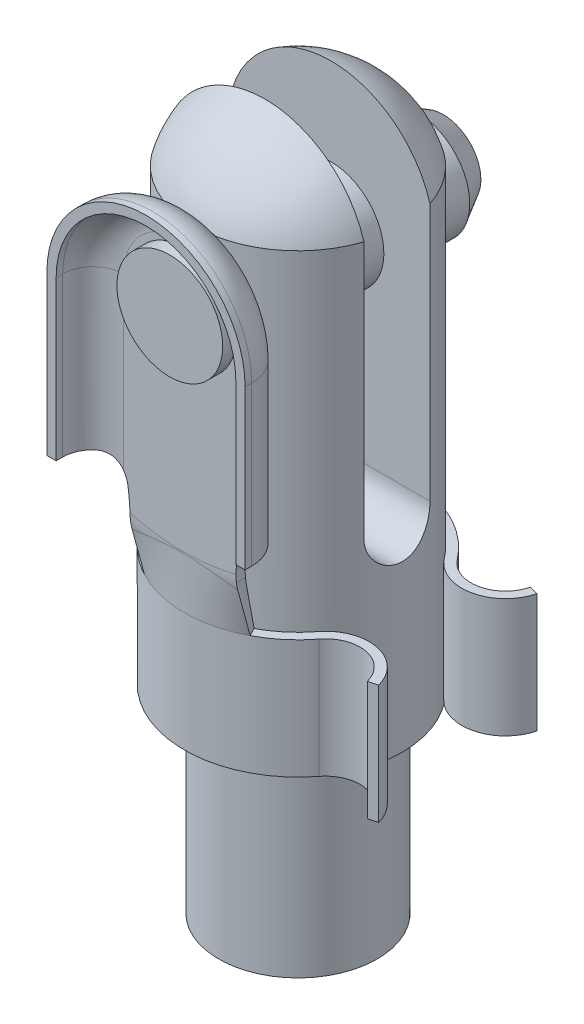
ISO-10303-21;
HEADER;
FILE_DESCRIPTION(('STEP AP214'),'2;1');
FILE_NAME('part.step','',(''),(''),'','','');
FILE_SCHEMA(('AUTOMOTIVE_DESIGN { 1 0 10303 214 1 1 1 1 }'));
ENDSEC;
DATA;
#1=APPLICATION_CONTEXT('core data for automotive mechanical design processes');
#2=APPLICATION_PROTOCOL_DEFINITION('international standard','automotive_design',2000,#1);
#3=PRODUCT_CONTEXT('',#1,'mechanical');
#4=PRODUCT('Part','Part','',(#3));
#5=PRODUCT_RELATED_PRODUCT_CATEGORY('part','',(#4));
#6=PRODUCT_DEFINITION_FORMATION('','',#4);
#7=PRODUCT_DEFINITION_CONTEXT('part definition',#1,'design');
#8=PRODUCT_DEFINITION('design','',#6,#7);
#9=PRODUCT_DEFINITION_SHAPE('','',#8);
#10=(LENGTH_UNIT() NAMED_UNIT(*) SI_UNIT(.MILLI.,.METRE.));
#11=(NAMED_UNIT(*) PLANE_ANGLE_UNIT() SI_UNIT($,.RADIAN.));
#12=(NAMED_UNIT(*) SI_UNIT($,.STERADIAN.) SOLID_ANGLE_UNIT());
#13=UNCERTAINTY_MEASURE_WITH_UNIT(LENGTH_MEASURE(1.E-05),#10,'distance_accuracy_value','');
#14=(GEOMETRIC_REPRESENTATION_CONTEXT(3) GLOBAL_UNCERTAINTY_ASSIGNED_CONTEXT((#13)) GLOBAL_UNIT_ASSIGNED_CONTEXT((#10,
#11,#12)) REPRESENTATION_CONTEXT('',''));
#15=CARTESIAN_POINT('',(0.,0.,0.));
#16=DIRECTION('',(0.,0.,1.));
#17=DIRECTION('',(1.,0.,0.));
#18=AXIS2_PLACEMENT_3D('',#15,#16,#17);
#19=CARTESIAN_POINT('',(0.,22.,4.35));
#20=DIRECTION('',(0.,0.,1.));
#21=DIRECTION('',(1.,0.,0.));
#22=AXIS2_PLACEMENT_3D('',#19,#20,#21);
#23=PLANE('',#22);
#24=CARTESIAN_POINT('',(-10.125,14.,4.35));
#25=DIRECTION('',(0.,0.,-1.));
#26=DIRECTION('',(-1.,0.,0.));
#27=AXIS2_PLACEMENT_3D('',#24,#25,#26);
#28=CIRCLE('',#27,8.12500000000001);
#29=CARTESIAN_POINT('',(-2.08042264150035,15.140350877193,4.35));
#30=VERTEX_POINT('',#29);
#31=CARTESIAN_POINT('',(-2.00490939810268,14.2824068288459,4.35));
#32=VERTEX_POINT('',#31);
#33=EDGE_CURVE('E389',#30,#32,#28,.T.);
#34=ORIENTED_EDGE('',*,*,#33,.T.);
#35=CARTESIAN_POINT('',(3.48211562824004,14.5940291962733,4.35));
#36=CARTESIAN_POINT('',(3.59794180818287,13.9723308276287,4.35));
#37=CARTESIAN_POINT('',(3.69271229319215,13.4636491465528,3.98642597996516));
#38=CARTESIAN_POINT('',(3.36408920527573,14.5720505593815,4.35));
#39=CARTESIAN_POINT('',(3.47870250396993,13.9726457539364,4.35));
#40=CARTESIAN_POINT('',(3.57308567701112,13.474977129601,4.00961729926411));
#41=CARTESIAN_POINT('',(3.2461966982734,14.5493560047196,4.35));
#42=CARTESIAN_POINT('',(3.35875531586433,13.9730784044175,4.35));
#43=CARTESIAN_POINT('',(3.4527952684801,13.4878586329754,4.03300707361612));
#44=CARTESIAN_POINT('',(3.01068838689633,14.5025898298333,4.35));
#45=CARTESIAN_POINT('',(3.1182084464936,13.974228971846,4.35));
#46=CARTESIAN_POINT('',(3.21052336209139,13.5170837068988,4.07940973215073));
#47=CARTESIAN_POINT('',(2.89307257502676,14.4785182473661,4.35));
#48=CARTESIAN_POINT('',(2.9975937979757,13.974945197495,4.35));
#49=CARTESIAN_POINT('',(3.08854191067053,13.5334271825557,4.10242262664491));
#50=CARTESIAN_POINT('',(2.65814533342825,14.4290568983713,4.35));
#51=CARTESIAN_POINT('',(2.75560555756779,13.9767106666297,4.35));
#52=CARTESIAN_POINT('',(2.84254436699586,13.5699278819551,4.14729425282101));
#53=CARTESIAN_POINT('',(2.54083384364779,14.4036674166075,4.35));
#54=CARTESIAN_POINT('',(2.63419382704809,13.9777581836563,4.35));
#55=CARTESIAN_POINT('',(2.71852871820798,13.5900842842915,4.16915323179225));
#56=CARTESIAN_POINT('',(2.30647303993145,14.3517078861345,4.35));
#57=CARTESIAN_POINT('',(2.39056256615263,13.9801899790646,4.35));
#58=CARTESIAN_POINT('',(2.46820849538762,13.6342865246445,4.21063104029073));
#59=CARTESIAN_POINT('',(2.18942372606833,14.3251378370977,4.35));
#60=CARTESIAN_POINT('',(2.26827130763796,13.9815732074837,4.35));
#61=CARTESIAN_POINT('',(2.34190392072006,13.6583323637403,4.23024986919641));
#62=CARTESIAN_POINT('',(2.03983028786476,14.2905384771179,4.35));
#63=CARTESIAN_POINT('',(2.11111568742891,13.9835138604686,4.35));
#64=CARTESIAN_POINT('',(2.17890874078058,13.6913414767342,4.25312173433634));
#65=CARTESIAN_POINT('',(2.00718388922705,14.2829485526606,4.35));
#66=CARTESIAN_POINT('',(2.07683337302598,13.9839470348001,4.35));
#67=CARTESIAN_POINT('',(2.14324163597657,13.6986841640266,4.25797881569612));
#68=CARTESIAN_POINT('',(1.94190588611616,14.2677007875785,4.35));
#69=CARTESIAN_POINT('',(2.00821149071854,13.9848304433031,4.35));
#70=CARTESIAN_POINT('',(2.07174220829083,13.7136250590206,4.26739464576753));
#71=CARTESIAN_POINT('',(1.90927428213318,14.2600429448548,4.35));
#72=CARTESIAN_POINT('',(1.97386929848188,13.9852806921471,4.35));
#73=CARTESIAN_POINT('',(2.03590988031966,13.7212232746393,4.27195338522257));
#74=CARTESIAN_POINT('',(1.87664983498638,14.2523545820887,4.35));
#75=CARTESIAN_POINT('',(1.93948182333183,13.9857380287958,4.35));
#76=CARTESIAN_POINT('',(2.00000000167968,13.7289397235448,4.276349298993));
#77=CARTESIAN_POINT('',(1.7929895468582,14.2326289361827,4.35));
#78=CARTESIAN_POINT('',(1.84827499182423,13.9882844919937,4.35));
#79=CARTESIAN_POINT('',(1.90167102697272,13.7513374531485,4.28869521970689));
#80=CARTESIAN_POINT('',(1.70906782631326,14.2139880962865,4.35));
#81=CARTESIAN_POINT('',(1.75755424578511,13.990321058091,4.35));
#82=CARTESIAN_POINT('',(1.80464823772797,13.7723292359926,4.29867394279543));
#83=CARTESIAN_POINT('',(1.54071808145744,14.1790623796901,4.35));
#84=CARTESIAN_POINT('',(1.57730460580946,13.993609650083,4.35));
#85=CARTESIAN_POINT('',(1.61307967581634,13.8113201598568,4.31497721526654));
#86=CARTESIAN_POINT('',(1.4562899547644,14.1627779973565,4.35));
#87=CARTESIAN_POINT('',(1.48768965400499,13.9948646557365,4.35));
#88=CARTESIAN_POINT('',(1.5185344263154,13.8293186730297,4.32130099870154));
#89=CARTESIAN_POINT('',(1.28700243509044,14.1327641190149,4.35));
#90=CARTESIAN_POINT('',(1.30958141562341,13.9968309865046,4.35));
#91=CARTESIAN_POINT('',(1.33185249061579,13.8621282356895,4.33136895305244));
#92=CARTESIAN_POINT('',(1.20214316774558,14.1190339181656,4.35));
#93=CARTESIAN_POINT('',(1.22102866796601,13.9975437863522,4.35));
#94=CARTESIAN_POINT('',(1.23971514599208,13.8769401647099,4.33511383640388));
#95=CARTESIAN_POINT('',(1.03203881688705,14.0942857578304,4.35));
#96=CARTESIAN_POINT('',(1.0448165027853,13.9986190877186,4.35));
#97=CARTESIAN_POINT('',(1.05747616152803,13.9033699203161,4.34088069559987));
#98=CARTESIAN_POINT('',(0.946793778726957,14.0832674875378,4.35));
#99=CARTESIAN_POINT('',(0.957118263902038,13.9989821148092,4.35));
#100=CARTESIAN_POINT('',(0.967374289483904,13.9149881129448,4.34290286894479));
#101=CARTESIAN_POINT('',(0.778062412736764,14.0642810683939,4.35));
#102=CARTESIAN_POINT('',(0.784558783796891,13.9994927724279,4.35));
#103=CARTESIAN_POINT('',(0.791012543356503,13.9348320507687,4.34586056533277));
#104=CARTESIAN_POINT('',(0.694583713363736,14.0562452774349,4.35));
#105=CARTESIAN_POINT('',(0.699659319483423,13.9996455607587,4.35));
#106=CARTESIAN_POINT('',(0.70471251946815,13.943133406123,4.3468213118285));
#107=CARTESIAN_POINT('',(0.527422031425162,14.0428708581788,4.35));
#108=CARTESIAN_POINT('',(0.530332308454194,13.9998525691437,4.35));
#109=CARTESIAN_POINT('',(0.533226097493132,13.9568710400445,4.34818815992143));
#110=CARTESIAN_POINT('',(0.443739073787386,14.0375319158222,4.35));
#111=CARTESIAN_POINT('',(0.445892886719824,13.9999068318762,4.35));
#112=CARTESIAN_POINT('',(0.44803957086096,13.9623076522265,4.34859432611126));
#113=CARTESIAN_POINT('',(0.240084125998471,14.027876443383,4.35));
#114=CARTESIAN_POINT('',(0.240886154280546,13.9999910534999,4.34999999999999));
#115=CARTESIAN_POINT('',(0.241676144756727,13.9721148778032,4.34925858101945));
#116=CARTESIAN_POINT('',(0.120040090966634,14.0249960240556,4.35));
#117=CARTESIAN_POINT('',(0.120438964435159,14.0000004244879,4.34999999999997));
#118=CARTESIAN_POINT('',(0.120836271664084,13.9750123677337,4.34937707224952));
#119=CARTESIAN_POINT('',(-0.115876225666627,14.0249961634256,4.35));
#120=CARTESIAN_POINT('',(-0.116261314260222,13.999999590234,4.35000000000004));
#121=CARTESIAN_POINT('',(-0.116644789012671,13.9750110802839,4.34937357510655));
#122=CARTESIAN_POINT('',(-0.231748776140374,14.0276803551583,4.35));
#123=CARTESIAN_POINT('',(-0.232521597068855,13.9999900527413,4.35000000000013));
#124=CARTESIAN_POINT('',(-0.233286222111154,13.9723098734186,4.34925978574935));
#125=CARTESIAN_POINT('',(-0.472394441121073,14.0386969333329,4.35));
#126=CARTESIAN_POINT('',(-0.474715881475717,13.9998992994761,4.35000000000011));
#127=CARTESIAN_POINT('',(-0.477021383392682,13.9611282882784,4.34852600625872));
#128=CARTESIAN_POINT('',(-0.597148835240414,14.0474580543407,4.35));
#129=CARTESIAN_POINT('',(-0.600705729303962,13.9998124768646,4.34999999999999));
#130=CARTESIAN_POINT('',(-0.604213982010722,13.9522089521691,4.34786680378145));
#131=CARTESIAN_POINT('',(-0.727751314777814,14.0597811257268,4.35));
#132=CARTESIAN_POINT('',(-0.733480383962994,13.999566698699,4.35));
#133=CARTESIAN_POINT('',(-0.739198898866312,13.9394622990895,4.34634505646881));
#134=CARTESIAN_POINT('',(-0.733901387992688,14.0603687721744,4.35));
#135=CARTESIAN_POINT('',(-0.739735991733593,13.9995547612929,4.35));
#136=CARTESIAN_POINT('',(-0.745559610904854,13.9388541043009,4.34627145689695));
#137=CARTESIAN_POINT('',(-0.764648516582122,14.0633433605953,4.35));
#138=CARTESIAN_POINT('',(-0.771022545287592,13.99949306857,4.35));
#139=CARTESIAN_POINT('',(-0.777381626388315,13.9357735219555,4.34589286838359));
#140=CARTESIAN_POINT('',(-0.789235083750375,14.0658392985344,4.35));
#141=CARTESIAN_POINT('',(-0.796074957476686,13.9994373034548,4.35));
#142=CARTESIAN_POINT('',(-0.802897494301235,13.9331823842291,4.34555611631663));
#143=CARTESIAN_POINT('',(-0.9121236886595,14.0789057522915,4.35));
#144=CARTESIAN_POINT('',(-0.921507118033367,13.9991195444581,4.35));
#145=CARTESIAN_POINT('',(-0.930824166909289,13.9195775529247,4.34367552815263));
#146=CARTESIAN_POINT('',(-1.01024394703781,14.0912319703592,4.35));
#147=CARTESIAN_POINT('',(-1.02229643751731,13.9987408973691,4.35));
#148=CARTESIAN_POINT('',(-1.03422629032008,13.9066211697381,4.34154174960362));
#149=CARTESIAN_POINT('',(-1.23721495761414,14.1239933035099,4.35));
#150=CARTESIAN_POINT('',(-1.25734167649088,13.9973412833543,4.35));
#151=CARTESIAN_POINT('',(-1.27716801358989,13.8716557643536,4.33402001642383));
#152=CARTESIAN_POINT('',(-1.36587424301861,14.1457609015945,4.35));
#153=CARTESIAN_POINT('',(-1.39208331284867,13.9961526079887,4.35));
#154=CARTESIAN_POINT('',(-1.41770410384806,13.848077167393,4.32781054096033));
#155=CARTESIAN_POINT('',(-1.55803971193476,14.1826707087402,4.35));
#156=CARTESIAN_POINT('',(-1.5958083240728,13.993255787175,4.35));
#157=CARTESIAN_POINT('',(-1.63281160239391,13.807294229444,4.31322231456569));
#158=CARTESIAN_POINT('',(-1.62196488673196,14.1956854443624,4.35));
#159=CARTESIAN_POINT('',(-1.66410208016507,13.9921021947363,4.35));
#160=CARTESIAN_POINT('',(-1.70523985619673,13.7927954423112,4.30747961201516));
#161=CARTESIAN_POINT('',(-1.74952508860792,14.2230446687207,4.35));
#162=CARTESIAN_POINT('',(-1.80130821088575,13.9893117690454,4.35));
#163=CARTESIAN_POINT('',(-1.85153549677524,13.7621073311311,4.29373451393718));
#164=CARTESIAN_POINT('',(-1.81316013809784,14.2373890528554,4.35));
#165=CARTESIAN_POINT('',(-1.87026127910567,13.9876733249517,4.35));
#166=CARTESIAN_POINT('',(-1.9254027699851,13.7459181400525,4.28573229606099));
#167=CARTESIAN_POINT('',(-1.8766498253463,14.2523545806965,4.35));
#168=CARTESIAN_POINT('',(-1.93948181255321,13.9857380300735,4.35));
#169=CARTESIAN_POINT('',(-1.99999998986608,13.7289397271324,4.27634930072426));
#170=CARTESIAN_POINT('',(-1.90958111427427,14.2601153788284,4.35));
#171=CARTESIAN_POINT('',(-1.97419340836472,13.9852762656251,4.35));
#172=CARTESIAN_POINT('',(-2.03624814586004,13.7211499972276,4.2719120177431));
#173=CARTESIAN_POINT('',(-1.94251977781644,14.2678449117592,4.35));
#174=CARTESIAN_POINT('',(-2.00885818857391,13.9848219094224,4.35));
#175=CARTESIAN_POINT('',(-2.07241656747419,13.7134817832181,4.26730885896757));
#176=CARTESIAN_POINT('',(-2.00841314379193,14.2832349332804,4.35));
#177=CARTESIAN_POINT('',(-2.0781250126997,13.9839306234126,4.35));
#178=CARTESIAN_POINT('',(-2.14458602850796,13.6984056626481,4.25779866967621));
#179=CARTESIAN_POINT('',(-2.04136784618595,14.2908954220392,4.35));
#180=CARTESIAN_POINT('',(-2.11272975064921,13.9834936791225,4.35));
#181=CARTESIAN_POINT('',(-2.18058706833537,13.6909977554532,4.25289163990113));
#182=CARTESIAN_POINT('',(-2.10728748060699,14.306139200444,4.35));
#183=CARTESIAN_POINT('',(-2.18186513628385,13.9826404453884,4.35));
#184=CARTESIAN_POINT('',(-2.25240612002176,13.6764610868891,4.24280267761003));
#185=CARTESIAN_POINT('',(-2.14025240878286,14.3137225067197,4.35));
#186=CARTESIAN_POINT('',(-2.21639825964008,13.9822241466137,4.35));
#187=CARTESIAN_POINT('',(-2.28822417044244,13.6693322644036,4.2376208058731));
#188=CARTESIAN_POINT('',(-2.20620083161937,14.3288083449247,4.35));
#189=CARTESIAN_POINT('',(-2.28539786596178,13.9814139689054,4.35));
#190=CARTESIAN_POINT('',(-2.35968251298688,13.6553620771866,4.22700835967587));
#191=CARTESIAN_POINT('',(-2.23918432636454,14.336310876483,4.35));
#192=CARTESIAN_POINT('',(-2.31986656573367,13.981020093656,4.35));
#193=CARTESIAN_POINT('',(-2.39532280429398,13.6485207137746,4.22157778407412));
#194=CARTESIAN_POINT('',(-2.46536295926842,14.3874420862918,4.35));
#195=CARTESIAN_POINT('',(-2.55672874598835,13.9783989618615,4.34999999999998));
#196=CARTESIAN_POINT('',(-2.63901106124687,13.6026667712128,4.18360528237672));
#197=CARTESIAN_POINT('',(-2.65889262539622,14.4296120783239,4.35));
#198=CARTESIAN_POINT('',(-2.75730030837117,13.9766104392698,4.34999999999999));
#199=CARTESIAN_POINT('',(-2.84397861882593,13.5687290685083,4.14744810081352));
#200=CARTESIAN_POINT('',(-3.04672136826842,14.5102716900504,4.35));
#201=CARTESIAN_POINT('',(-3.15604566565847,13.9739241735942,4.35));
#202=CARTESIAN_POINT('',(-3.2484456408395,13.5111860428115,4.07262212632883));
#203=CARTESIAN_POINT('',(-3.24102045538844,14.5487612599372,4.35));
#204=CARTESIAN_POINT('',(-3.35436070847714,13.9730342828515,4.35));
#205=CARTESIAN_POINT('',(-3.44794503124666,13.487580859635,4.03395329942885));
#206=CARTESIAN_POINT('',(-3.63037590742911,14.6219270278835,4.35));
#207=CARTESIAN_POINT('',(-3.74944820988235,13.9718834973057,4.35));
#208=CARTESIAN_POINT('',(-3.8432984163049,13.448802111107,3.95718756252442));
#209=CARTESIAN_POINT('',(-3.82543241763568,14.6566024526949,4.35));
#210=CARTESIAN_POINT('',(-3.94620516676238,13.9716294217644,4.35));
#211=CARTESIAN_POINT('',(-4.03915166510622,13.43363025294,3.91909076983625));
#212=CARTESIAN_POINT('',(-4.21615981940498,14.7222916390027,4.35));
#213=CARTESIAN_POINT('',(-4.33881906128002,13.9715047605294,4.35));
#214=CARTESIAN_POINT('',(-4.42871715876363,13.409659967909,3.84505695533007));
#215=CARTESIAN_POINT('',(-4.411830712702,14.7533053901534,4.35));
#216=CARTESIAN_POINT('',(-4.53457814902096,13.9716382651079,4.35));
#217=CARTESIAN_POINT('',(-4.62242939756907,13.4008615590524,3.80911993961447));
#218=CARTESIAN_POINT('',(-4.80416974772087,14.8120523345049,4.35));
#219=CARTESIAN_POINT('',(-4.92619485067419,13.9721152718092,4.35));
#220=CARTESIAN_POINT('',(-5.00930561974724,13.3878554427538,3.73999063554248));
#221=CARTESIAN_POINT('',(-5.00083916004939,14.8397770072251,4.35));
#222=CARTESIAN_POINT('',(-5.12190831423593,13.9724612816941,4.35));
#223=CARTESIAN_POINT('',(-5.20246696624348,13.3836594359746,3.70680554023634));
#224=CARTESIAN_POINT('',(-5.39458086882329,14.8922132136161,4.35));
#225=CARTESIAN_POINT('',(-5.51326097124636,13.9732559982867,4.35));
#226=CARTESIAN_POINT('',(-5.58845248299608,13.3785305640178,3.6434523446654));
#227=CARTESIAN_POINT('',(-5.5916531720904,14.9169246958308,4.35));
#228=CARTESIAN_POINT('',(-5.70874702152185,13.9737053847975,4.35));
#229=CARTESIAN_POINT('',(-5.781276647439,13.3775977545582,3.61328429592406));
#230=CARTESIAN_POINT('',(-5.98604389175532,14.9636863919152,4.35));
#231=CARTESIAN_POINT('',(-6.09978369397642,13.9746429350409,4.35));
#232=CARTESIAN_POINT('',(-6.16694081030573,13.3779704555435,3.55588998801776));
#233=CARTESIAN_POINT('',(-6.18336220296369,14.9857374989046,4.35));
#234=CARTESIAN_POINT('',(-6.29518053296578,13.9751310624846,4.35));
#235=CARTESIAN_POINT('',(-6.3597807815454,13.3792752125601,3.52866274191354));
#236=CARTESIAN_POINT('',(-6.57823246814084,15.027512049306,4.35));
#237=CARTESIAN_POINT('',(-6.68618298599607,13.9761149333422,4.35));
#238=CARTESIAN_POINT('',(-6.74572756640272,13.3834343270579,3.47692027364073));
#239=CARTESIAN_POINT('',(-6.7757844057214,15.0472356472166,4.35));
#240=CARTESIAN_POINT('',(-6.88164110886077,13.976610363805,4.35));
#241=CARTESIAN_POINT('',(-6.93883436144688,13.3862885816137,3.45240487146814));
#242=CARTESIAN_POINT('',(-6.9734269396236,15.065958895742,4.35));
#243=CARTESIAN_POINT('',(-7.07654259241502,13.9770913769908,4.35));
#244=CARTESIAN_POINT('',(-7.13218042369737,13.389574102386,3.42913454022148));
#245=(BOUNDED_SURFACE() B_SPLINE_SURFACE(3,2,((#35,#36,#37),(#38,#39,#40),(#41,#42,#43),(#44,
#45,#46),(#47,#48,#49),(#50,#51,#52),(#53,#54,#55),(#56,#57,#58),(#59,#60,#61),(#62,#63,#64),
(#65,#66,#67),(#68,#69,#70),(#71,#72,#73),(#74,#75,#76),(#77,#78,#79),(#80,#81,#82),(#83,#84,
#85),(#86,#87,#88),(#89,#90,#91),(#92,#93,#94),(#95,#96,#97),(#98,#99,#100),(#101,#102,#103),
(#104,#105,#106),(#107,#108,#109),(#110,#111,#112),(#113,#114,#115),(#116,#117,#118),(#119,#120,
#121),(#122,#123,#124),(#125,#126,#127),(#128,#129,#130),(#131,#132,#133),(#134,#135,#136),
(#137,#138,#139),(#140,#141,#142),(#143,#144,#145),(#146,#147,#148),(#149,#150,#151),(#152,#153,
#154),(#155,#156,#157),(#158,#159,#160),(#161,#162,#163),(#164,#165,#166),(#167,#168,#169),
(#170,#171,#172),(#173,#174,#175),(#176,#177,#178),(#179,#180,#181),(#182,#183,#184),(#185,#186,
#187),(#188,#189,#190),(#191,#192,#193),(#194,#195,#196),(#197,#198,#199),(#200,#201,#202),
(#203,#204,#205),(#206,#207,#208),(#209,#210,#211),(#212,#213,#214),(#215,#216,#217),(#218,#219,
#220),(#221,#222,#223),(#224,#225,#226),(#227,#228,#229),(#230,#231,#232),(#233,#234,#235),
(#236,#237,#238),(#239,#240,#241),(#242,#243,#244)),.UNSPECIFIED.,.F.,.F.,
.F.) B_SPLINE_SURFACE_WITH_KNOTS((4,2,2,2,2,2,3,2,2,2,2,2,2,2,2,2,2,2,2,2,2,3,2,2,2,2,2,2,2,2,2,
2,2,4),(3,3),(0.,0.360163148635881,0.720316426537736,1.08039220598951,1.44046808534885,
1.5410192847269,1.64157360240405,1.89943751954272,2.15735545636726,2.4152021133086,
2.67301920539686,2.92456823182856,3.17608795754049,3.53617731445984,3.88377614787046,
4.25878733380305,4.27732162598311,4.3514595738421,4.64806066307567,5.03936749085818,
5.23506565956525,5.43074844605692,5.53224867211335,5.63374865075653,5.73522627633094,
5.83670436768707,6.43088282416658,7.02506932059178,7.61937605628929,8.21368447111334,
8.80950031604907,9.40532633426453,10.0009517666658,10.5965376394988),(0.,1.),
.UNSPECIFIED.) GEOMETRIC_REPRESENTATION_ITEM() RATIONAL_B_SPLINE_SURFACE(((1.,0.953470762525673,
1.),(1.,0.956511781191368,1.),(1.,0.959563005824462,1.),(1.,0.965588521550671,1.),(1.,
0.968562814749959,1.),(1.,0.974336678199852,1.),(1.,0.977136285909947,1.),(1.,0.982427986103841,
1.),(1.,0.984920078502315,1.),(1.,0.987816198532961,1.),(1.,0.988430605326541,1.),(1.,
0.98962064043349,1.),(1.,0.990196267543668,1.),(1.,0.990750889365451,1.),(1.,0.992307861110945,
1.),(1.,0.99356389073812,1.),(1.,0.995613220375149,1.),(1.,0.996406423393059,1.),(1.,
0.997668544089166,1.),(1.,0.99813755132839,1.),(1.,0.998859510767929,1.),(1.,0.999112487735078,
1.),(1.,0.999482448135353,1.),(1.,0.99960258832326,1.),(1.,0.999773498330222,1.),(1.,
0.999824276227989,1.),(1.,0.999907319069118,1.),(1.,0.999922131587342,1.),(1.,0.999921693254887,
1.),(1.,0.999907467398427,1.),(1.,0.999815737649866,1.),(1.,0.999733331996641,1.),(1.,
0.999543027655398,1.),(1.,0.999533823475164,1.),(1.,0.999486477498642,1.),(1.,0.999444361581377,
1.),(1.,0.999209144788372,1.),(1.,0.998942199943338,1.),(1.,0.998000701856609,1.),(1.,
0.997223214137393,1.),(1.,0.995392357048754,1.),(1.,0.994671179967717,1.),(1.,0.992942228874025,
1.),(1.,0.991934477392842,1.),(1.,0.990750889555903,1.),(1.,0.990191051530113,1.),(1.,
0.989609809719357,1.),(1.,0.988407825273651,1.),(1.,0.98778708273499,1.),(1.,0.986509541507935,
1.),(1.,0.985852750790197,1.),(1.,0.984506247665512,1.),(1.,0.983816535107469,1.),(1.,
0.978988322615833,1.),(1.,0.974363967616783,1.),(1.,0.964717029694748,1.),(1.,0.959694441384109,
1.),(1.,0.949643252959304,1.),(1.,0.944614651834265,1.),(1.,0.934766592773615,1.),(1.,
0.929947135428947,1.),(1.,0.920608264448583,1.),(1.,0.916089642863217,1.),(1.,0.907403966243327,
1.),(1.,0.903236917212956,1.),(1.,0.895258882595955,1.),(1.,0.891447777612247,1.),(1.,
0.88416240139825,1.),(1.,0.880688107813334,1.),(1.,0.877373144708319,1.))) REPRESENTATION_ITEM('') SURFACE());
#246=CARTESIAN_POINT('',(-6.9734269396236,15.065958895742,4.35));
#247=CARTESIAN_POINT('',(-6.7757844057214,15.0472356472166,4.35));
#248=CARTESIAN_POINT('',(-6.57823246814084,15.027512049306,4.35));
#249=CARTESIAN_POINT('',(-6.18336220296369,14.9857374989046,4.35));
#250=CARTESIAN_POINT('',(-5.98604389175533,14.9636863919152,4.35));
#251=CARTESIAN_POINT('',(-5.5916531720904,14.9169246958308,4.35));
#252=CARTESIAN_POINT('',(-5.39458086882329,14.8922132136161,4.35));
#253=CARTESIAN_POINT('',(-5.00083916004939,14.8397770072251,4.35));
#254=CARTESIAN_POINT('',(-4.80416974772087,14.8120523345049,4.35));
#255=CARTESIAN_POINT('',(-4.411830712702,14.7533053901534,4.35));
#256=CARTESIAN_POINT('',(-4.21615981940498,14.7222916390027,4.35));
#257=CARTESIAN_POINT('',(-3.82543241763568,14.6566024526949,4.35));
#258=CARTESIAN_POINT('',(-3.63037590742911,14.6219270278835,4.35));
#259=CARTESIAN_POINT('',(-3.24102045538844,14.5487612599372,4.35));
#260=CARTESIAN_POINT('',(-3.04672136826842,14.5102716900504,4.35));
#261=CARTESIAN_POINT('',(-2.65889262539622,14.4296120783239,4.35));
#262=CARTESIAN_POINT('',(-2.46536295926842,14.3874420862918,4.35));
#263=CARTESIAN_POINT('',(-2.23918432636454,14.336310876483,4.35));
#264=CARTESIAN_POINT('',(-2.20620083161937,14.3288083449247,4.35));
#265=CARTESIAN_POINT('',(-2.14025240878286,14.3137225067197,4.35));
#266=CARTESIAN_POINT('',(-2.10728748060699,14.306139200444,4.35));
#267=CARTESIAN_POINT('',(-2.04136784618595,14.2908954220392,4.35));
#268=CARTESIAN_POINT('',(-2.00841314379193,14.2832349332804,4.35));
#269=CARTESIAN_POINT('',(-1.94251977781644,14.2678449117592,4.35));
#270=CARTESIAN_POINT('',(-1.90958111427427,14.2601153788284,4.35));
#271=CARTESIAN_POINT('',(-1.8766498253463,14.2523545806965,4.35));
#272=CARTESIAN_POINT('',(-1.81316013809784,14.2373890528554,4.35));
#273=CARTESIAN_POINT('',(-1.74952508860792,14.2230446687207,4.35));
#274=CARTESIAN_POINT('',(-1.62196488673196,14.1956854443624,4.35));
#275=CARTESIAN_POINT('',(-1.55803971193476,14.1826707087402,4.35));
#276=CARTESIAN_POINT('',(-1.36587424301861,14.1457609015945,4.35));
#277=CARTESIAN_POINT('',(-1.23721495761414,14.1239933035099,4.35));
#278=CARTESIAN_POINT('',(-1.01024394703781,14.0912319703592,4.35));
#279=CARTESIAN_POINT('',(-0.912123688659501,14.0789057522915,4.35));
#280=CARTESIAN_POINT('',(-0.789235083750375,14.0658392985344,4.35));
#281=CARTESIAN_POINT('',(-0.764648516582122,14.0633433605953,4.35));
#282=CARTESIAN_POINT('',(-0.733901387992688,14.0603687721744,4.35));
#283=CARTESIAN_POINT('',(-0.727751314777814,14.0597811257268,4.35));
#284=CARTESIAN_POINT('',(-0.597148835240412,14.0474580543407,4.35));
#285=CARTESIAN_POINT('',(-0.472394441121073,14.0386969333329,4.35));
#286=CARTESIAN_POINT('',(-0.231748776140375,14.0276803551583,4.35));
#287=CARTESIAN_POINT('',(-0.115876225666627,14.0249961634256,4.35));
#288=CARTESIAN_POINT('',(0.120040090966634,14.0249960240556,4.35));
#289=CARTESIAN_POINT('',(0.240084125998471,14.027876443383,4.35));
#290=CARTESIAN_POINT('',(0.443739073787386,14.0375319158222,4.35));
#291=CARTESIAN_POINT('',(0.527422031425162,14.0428708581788,4.35));
#292=CARTESIAN_POINT('',(0.694583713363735,14.0562452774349,4.35));
#293=CARTESIAN_POINT('',(0.778062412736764,14.0642810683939,4.35));
#294=CARTESIAN_POINT('',(0.946793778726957,14.0832674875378,4.35));
#295=CARTESIAN_POINT('',(1.03203881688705,14.0942857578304,4.35));
#296=CARTESIAN_POINT('',(1.20214316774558,14.1190339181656,4.35));
#297=CARTESIAN_POINT('',(1.28700243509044,14.1327641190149,4.35));
#298=CARTESIAN_POINT('',(1.4562899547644,14.1627779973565,4.35));
#299=CARTESIAN_POINT('',(1.54071808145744,14.1790623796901,4.35));
#300=CARTESIAN_POINT('',(1.70906782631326,14.2139880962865,4.35));
#301=CARTESIAN_POINT('',(1.7929895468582,14.2326289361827,4.35));
#302=CARTESIAN_POINT('',(1.87664983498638,14.2523545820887,4.35));
#303=CARTESIAN_POINT('',(1.90927428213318,14.2600429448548,4.35));
#304=CARTESIAN_POINT('',(1.94190588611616,14.2677007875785,4.35));
#305=CARTESIAN_POINT('',(2.00718388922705,14.2829485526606,4.35));
#306=CARTESIAN_POINT('',(2.03983028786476,14.2905384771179,4.35));
#307=CARTESIAN_POINT('',(2.18942372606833,14.3251378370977,4.35));
#308=CARTESIAN_POINT('',(2.30647303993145,14.3517078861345,4.35));
#309=CARTESIAN_POINT('',(2.54083384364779,14.4036674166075,4.35));
#310=CARTESIAN_POINT('',(2.65814533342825,14.4290568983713,4.35));
#311=CARTESIAN_POINT('',(2.89307257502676,14.4785182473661,4.35));
#312=CARTESIAN_POINT('',(3.01068838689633,14.5025898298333,4.35));
#313=CARTESIAN_POINT('',(3.2461966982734,14.5493560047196,4.35));
#314=CARTESIAN_POINT('',(3.36408920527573,14.5720505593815,4.35));
#315=CARTESIAN_POINT('',(3.48211562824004,14.5940291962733,4.35));
#316=B_SPLINE_CURVE_WITH_KNOTS('',3,(#246,#247,#248,#249,#250,#251,#252,#253,#254,#255,#256,
#257,#258,#259,#260,#261,#262,#263,#264,#265,#266,#267,#268,#269,#270,#271,#272,#273,#274,#275,
#276,#277,#278,#279,#280,#281,#282,#283,#284,#285,#286,#287,#288,#289,#290,#291,#292,#293,#294,
#295,#296,#297,#298,#299,#300,#301,#302,#303,#304,#305,#306,#307,#308,#309,#310,#311,#312,#313,
#314,#315),.UNSPECIFIED.,.F.,.F.,(4,2,2,2,2,2,2,2,2,2,2,2,3,2,2,2,2,2,2,2,2,2,2,2,2,2,2,3,2,2,2,
2,2,4),(0.,0.595585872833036,1.19121130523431,1.78703732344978,2.3828531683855,2.97716158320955,
3.57146831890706,4.16565481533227,4.75983327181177,4.8613113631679,4.96278898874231,
5.06428896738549,5.16578919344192,5.3614719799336,5.55717014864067,5.94847697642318,
6.24507806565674,6.31921601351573,6.33775030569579,6.71276149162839,7.060360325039,
7.42044968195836,7.67196940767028,7.92351843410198,8.18133552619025,8.43918218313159,
8.69710011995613,8.95496403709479,9.05551835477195,9.15606955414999,9.51614543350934,
9.87622121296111,10.236374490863,10.5965376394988),.UNSPECIFIED.);
#317=CARTESIAN_POINT('',(2.00490939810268,14.2824068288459,4.35));
#318=VERTEX_POINT('',#317);
#319=EDGE_CURVE('E622',#32,#318,#316,.T.);
#320=ORIENTED_EDGE('',*,*,#319,.T.);
#321=CARTESIAN_POINT('',(10.125,14.,4.35));
#322=DIRECTION('',(0.,0.,-1.));
#323=DIRECTION('',(1.,0.,0.));
#324=AXIS2_PLACEMENT_3D('',#321,#322,#323);
#325=CIRCLE('',#324,8.12500000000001);
#326=CARTESIAN_POINT('',(2.08042264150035,15.140350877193,4.35));
#327=VERTEX_POINT('',#326);
#328=EDGE_CURVE('E393',#318,#327,#325,.T.);
#329=ORIENTED_EDGE('',*,*,#328,.T.);
#330=CARTESIAN_POINT('',(3.07052447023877,15.,4.35));
#331=DIRECTION('',(0.,0.,1.));
#332=DIRECTION('',(1.,0.,0.));
#333=AXIS2_PLACEMENT_3D('',#330,#331,#332);
#334=CIRCLE('',#333,1.);
#335=CARTESIAN_POINT('',(2.25,15.5716114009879,4.35));
#336=VERTEX_POINT('',#335);
#337=EDGE_CURVE('E741',#327,#336,#334,.F.);
#338=ORIENTED_EDGE('',*,*,#337,.T.);
#339=DIRECTION('',(0.,1.,0.));
#340=VECTOR('',#339,1.);
#341=CARTESIAN_POINT('',(2.25,22.,4.35));
#342=LINE('',#341,#340);
#343=CARTESIAN_POINT('',(2.25,22.,4.35));
#344=VERTEX_POINT('',#343);
#345=EDGE_CURVE('E390',#336,#344,#342,.T.);
#346=ORIENTED_EDGE('',*,*,#345,.T.);
#347=CARTESIAN_POINT('',(0.,22.,4.35));
#348=DIRECTION('',(0.,0.,1.));
#349=DIRECTION('',(1.,0.,0.));
#350=AXIS2_PLACEMENT_3D('',#347,#348,#349);
#351=CIRCLE('',#350,2.25);
#352=CARTESIAN_POINT('',(-2.25,22.,4.35));
#353=VERTEX_POINT('',#352);
#354=EDGE_CURVE('E303',#344,#353,#351,.T.);
#355=ORIENTED_EDGE('',*,*,#354,.T.);
#356=DIRECTION('',(0.,-1.,0.));
#357=VECTOR('',#356,1.);
#358=CARTESIAN_POINT('',(-2.25,16.,4.35));
#359=LINE('',#358,#357);
#360=CARTESIAN_POINT('',(-2.25,15.5716114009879,4.35));
#361=VERTEX_POINT('',#360);
#362=EDGE_CURVE('E386',#353,#361,#359,.T.);
#363=ORIENTED_EDGE('',*,*,#362,.T.);
#364=CARTESIAN_POINT('',(-3.07052447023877,15.,4.35));
#365=DIRECTION('',(0.,0.,1.));
#366=DIRECTION('',(1.,0.,0.));
#367=AXIS2_PLACEMENT_3D('',#364,#365,#366);
#368=CIRCLE('',#367,1.);
#369=EDGE_CURVE('E421',#361,#30,#368,.F.);
#370=ORIENTED_EDGE('',*,*,#369,.T.);
#371=EDGE_LOOP('',(#34,#320,#329,#338,#346,#355,#363,#370));
#372=FACE_BOUND('',#371,.T.);
#373=CARTESIAN_POINT('',(0.,22.,4.35));
#374=DIRECTION('',(0.,0.,1.));
#375=DIRECTION('',(1.,0.,0.));
#376=AXIS2_PLACEMENT_3D('',#373,#374,#375);
#377=CIRCLE('',#376,2.);
#378=CARTESIAN_POINT('',(2.,22.,4.35));
#379=VERTEX_POINT('',#378);
#380=EDGE_CURVE('E1324',#379,#379,#377,.T.);
#381=ORIENTED_EDGE('',*,*,#380,.F.);
#382=EDGE_LOOP('',(#381));
#383=FACE_BOUND('',#382,.T.);
#384=ADVANCED_FACE('F66',(#372,#383),#23,.T.);
#385=CARTESIAN_POINT('',(4.44934224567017,12.,3.4004931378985));
#386=DIRECTION('',(0.,-1.,0.));
#387=DIRECTION('',(0.,0.,-1.));
#388=AXIS2_PLACEMENT_3D('',#385,#386,#387);
#389=PLANE('',#388);
#390=CARTESIAN_POINT('',(3.41645922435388,12.,-2.61109294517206));
#391=CARTESIAN_POINT('',(3.21272026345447,12.,-2.87753191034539));
#392=CARTESIAN_POINT('',(2.97064777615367,12.,-3.10889880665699));
#393=CARTESIAN_POINT('',(2.72876998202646,12.,-3.34007962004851));
#394=CARTESIAN_POINT('',(2.45309116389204,12.,-3.53162055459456));
#395=CARTESIAN_POINT('',(2.17831570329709,12.,-3.72253383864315));
#396=CARTESIAN_POINT('',(1.8762890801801,12.,-3.86904888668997));
#397=CARTESIAN_POINT('',(1.5752521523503,12.,-4.01508382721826));
#398=CARTESIAN_POINT('',(1.25417207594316,12.,-4.11303445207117));
#399=CARTESIAN_POINT('',(0.934144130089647,12.,-4.21066410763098));
#400=CARTESIAN_POINT('',(0.60176511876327,12.,-4.25768466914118));
#401=CARTESIAN_POINT('',(0.270475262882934,12.,-4.30455115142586));
#402=CARTESIAN_POINT('',(-0.0651752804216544,12.,-4.29950603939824));
#403=CARTESIAN_POINT('',(-0.399725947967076,12.,-4.2944774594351));
#404=CARTESIAN_POINT('',(-0.730541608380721,12.,-4.23748852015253));
#405=CARTESIAN_POINT('',(-1.06027323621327,12.,-4.18068632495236));
#406=CARTESIAN_POINT('',(-1.37826436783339,12.,-4.07312991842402));
#407=CARTESIAN_POINT('',(-1.69521349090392,12.,-3.965925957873));
#408=CARTESIAN_POINT('',(-1.9927001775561,12.,-3.81039971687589));
#409=CARTESIAN_POINT('',(-2.28921204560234,12.,-3.65538311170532));
#410=CARTESIAN_POINT('',(-2.55900958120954,12.,-3.45564320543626));
#411=CARTESIAN_POINT('',(-2.82792303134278,12.,-3.25655781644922));
#412=CARTESIAN_POINT('',(-3.06351544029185,12.,-3.01742823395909));
#413=CARTESIAN_POINT('',(-3.29833584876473,12.,-2.77908224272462));
#414=CARTESIAN_POINT('',(-3.4940332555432,12.,-2.50633828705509));
#415=CARTESIAN_POINT('',(-3.68908939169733,12.,-2.23448807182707));
#416=CARTESIAN_POINT('',(-3.8401654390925,12.,-1.93471687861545));
#417=CARTESIAN_POINT('',(-3.990746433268,12.,-1.63592798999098));
#418=CARTESIAN_POINT('',(-4.09355243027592,12.,-1.3163694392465));
#419=CARTESIAN_POINT('',(-4.19602154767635,12.,-0.997858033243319));
#420=CARTESIAN_POINT('',(-4.2480745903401,12.,-0.666229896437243));
#421=CARTESIAN_POINT('',(-4.29995706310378,12.,-0.335688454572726));
#422=CARTESIAN_POINT('',(-4.3,12.,0.));
#423=CARTESIAN_POINT('',(-4.30004279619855,12.,0.334588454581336));
#424=CARTESIAN_POINT('',(-4.2480745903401,12.,0.666229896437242));
#425=CARTESIAN_POINT('',(-4.19627667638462,12.,0.996784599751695));
#426=CARTESIAN_POINT('',(-4.09355243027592,12.,1.3163694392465));
#427=CARTESIAN_POINT('',(-3.99116479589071,12.,1.63490704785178));
#428=CARTESIAN_POINT('',(-3.8401654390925,12.,1.93471687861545));
#429=CARTESIAN_POINT('',(-3.6896608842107,12.,2.23354427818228));
#430=CARTESIAN_POINT('',(-3.4940332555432,12.,2.50633828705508));
#431=CARTESIAN_POINT('',(-3.29904666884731,12.,2.77823839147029));
#432=CARTESIAN_POINT('',(-3.06351544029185,12.,3.01742823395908));
#433=CARTESIAN_POINT('',(-2.82875601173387,12.,3.25583428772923));
#434=CARTESIAN_POINT('',(-2.55900958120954,12.,3.45564320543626));
#435=CARTESIAN_POINT('',(-2.29014706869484,12.,3.65479737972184));
#436=CARTESIAN_POINT('',(-1.9927001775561,12.,3.81039971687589));
#437=CARTESIAN_POINT('',(-1.69622797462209,12.,3.96549216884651));
#438=CARTESIAN_POINT('',(-1.37826436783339,12.,4.07312991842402));
#439=CARTESIAN_POINT('',(-1.06134267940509,12.,4.18041495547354));
#440=CARTESIAN_POINT('',(-0.730541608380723,12.,4.23748852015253));
#441=CARTESIAN_POINT('',(-0.400824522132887,12.,4.29437506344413));
#442=CARTESIAN_POINT('',(-0.0651752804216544,12.,4.29950603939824));
#443=CARTESIAN_POINT('',(0.269374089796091,12.,4.30462020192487));
#444=CARTESIAN_POINT('',(0.601765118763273,12.,4.25768466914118));
#445=CARTESIAN_POINT('',(0.933066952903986,12.,4.21090293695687));
#446=CARTESIAN_POINT('',(1.25417207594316,12.,4.11303445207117));
#447=CARTESIAN_POINT('',(1.57422498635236,12.,4.01548666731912));
#448=CARTESIAN_POINT('',(1.8762890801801,12.,3.86904888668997));
#449=CARTESIAN_POINT('',(2.17736335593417,12.,3.7230909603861));
#450=CARTESIAN_POINT('',(2.45309116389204,12.,3.53162055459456));
#451=CARTESIAN_POINT('',(2.72791545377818,12.,3.34077756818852));
#452=CARTESIAN_POINT('',(2.97064777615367,12.,3.10889880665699));
#453=CARTESIAN_POINT('',(3.21238415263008,12.,2.87797145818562));
#454=CARTESIAN_POINT('',(3.41645922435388,12.,2.61109294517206));
#455=B_SPLINE_CURVE_WITH_KNOTS('',2,(#390,#391,#392,#393,#394,#395,#396,#397,#398,#399,#400,
#401,#402,#403,#404,#405,#406,#407,#408,#409,#410,#411,#412,#413,#414,#415,#416,#417,#418,#419,
#420,#421,#422,#423,#424,#425,#426,#427,#428,#429,#430,#431,#432,#433,#434,#435,#436,#437,#438,
#439,#440,#441,#442,#443,#444,#445,#446,#447,#448,#449,#450,#451,#452,#453,#454),.UNSPECIFIED.,
.F.,.F.,(3,2,2,2,2,2,2,2,2,2,2,2,2,2,2,2,2,2,2,2,2,2,2,2,2,2,2,2,2,2,2,2,3),(0.,0.03125,0.0625,
0.09375,0.125,0.15625,0.1875,0.21875,0.25,0.28125,0.3125,0.34375,0.375,0.40625,0.4375,0.46875,
0.5,0.53125,0.5625,0.59375,0.625,0.65625,0.6875,0.71875,0.75,0.78125,0.8125,0.84375,0.875,
0.90625,0.9375,0.96875,1.),.UNSPECIFIED.);
#456=CARTESIAN_POINT('',(3.41645922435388,12.,-2.61109294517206));
#457=VERTEX_POINT('',#456);
#458=CARTESIAN_POINT('',(-2.,12.,3.80657326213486));
#459=VERTEX_POINT('',#458);
#460=EDGE_CURVE('E889',#457,#459,#455,.T.);
#461=ORIENTED_EDGE('',*,*,#460,.T.);
#462=DIRECTION('',(-0.465116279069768,0.,0.885249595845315));
#463=VECTOR('',#462,1.);
#464=CARTESIAN_POINT('',(-1.83720930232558,12.,3.496735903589));
#465=LINE('',#464,#463);
#466=CARTESIAN_POINT('',(-1.83720930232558,12.,3.496735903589));
#467=VERTEX_POINT('',#466);
#468=EDGE_CURVE('E420',#467,#459,#465,.T.);
#469=ORIENTED_EDGE('',*,*,#468,.F.);
#470=CARTESIAN_POINT('',(3.13837533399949,12.,2.3985621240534));
#471=CARTESIAN_POINT('',(2.951200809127,12.,2.64332750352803));
#472=CARTESIAN_POINT('',(2.72885086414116,12.,2.85584890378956));
#473=CARTESIAN_POINT('',(2.50669556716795,12.,3.06818426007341));
#474=CARTESIAN_POINT('',(2.25342095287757,12.,3.24416306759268));
#475=CARTESIAN_POINT('',(2.00104968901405,12.,3.41951421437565));
#476=CARTESIAN_POINT('',(1.72356787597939,12.,3.55412630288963));
#477=CARTESIAN_POINT('',(1.44707575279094,12.,3.68825827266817));
#478=CARTESIAN_POINT('',(1.15208830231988,12.,3.77825257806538));
#479=CARTESIAN_POINT('',(0.858152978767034,12.,3.86792590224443));
#480=CARTESIAN_POINT('',(0.552784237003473,12.,3.91112894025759));
#481=CARTESIAN_POINT('',(0.248504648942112,12.,3.95417788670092));
#482=CARTESIAN_POINT('',(-0.0598703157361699,12.,3.94954624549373));
#483=CARTESIAN_POINT('',(-0.367145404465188,12.,3.94493112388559));
#484=CARTESIAN_POINT('',(-0.671078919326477,12.,3.89257666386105));
#485=CARTESIAN_POINT('',(-0.973928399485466,12.,3.8404089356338));
#486=CARTESIAN_POINT('',(-1.26608005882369,12.,3.74159608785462));
#487=CARTESIAN_POINT('',(-1.55718970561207,12.,3.64313567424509));
#488=CARTESIAN_POINT('',(-1.83050365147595,12.,3.50025090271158));
#489=CARTESIAN_POINT('',(-2.10284277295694,12.,3.35787575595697));
#490=CARTESIAN_POINT('',(-2.35071810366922,12.,3.17436992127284));
#491=CARTESIAN_POINT('',(-2.5977093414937,12.,2.99151859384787));
#492=CARTESIAN_POINT('',(-2.81415953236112,12.,2.77182361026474));
#493=CARTESIAN_POINT('',(-3.02983771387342,12.,2.55291220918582));
#494=CARTESIAN_POINT('',(-3.20963519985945,12.,2.30233400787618));
#495=CARTESIAN_POINT('',(-3.3887914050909,12.,2.05264953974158));
#496=CARTESIAN_POINT('',(-3.52759383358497,12.,1.77723992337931));
#497=CARTESIAN_POINT('',(-3.66590119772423,12.,1.50281260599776));
#498=CARTESIAN_POINT('',(-3.7603563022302,12.,1.20922308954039));
#499=CARTESIAN_POINT('',(-3.85447451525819,12.,0.916680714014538));
#500=CARTESIAN_POINT('',(-3.90230107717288,12.,0.612001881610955));
#501=CARTESIAN_POINT('',(-3.94995705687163,12.,0.308409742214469));
#502=CARTESIAN_POINT('',(-3.95,12.,0.));
#503=CARTESIAN_POINT('',(-3.95004278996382,12.,-0.307309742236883));
#504=CARTESIAN_POINT('',(-3.90230107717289,12.,-0.612001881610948));
#505=CARTESIAN_POINT('',(-3.8547296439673,12.,-0.915607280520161));
#506=CARTESIAN_POINT('',(-3.7603563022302,12.,-1.20922308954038));
#507=CARTESIAN_POINT('',(-3.66631956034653,12.,-1.50179166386));
#508=CARTESIAN_POINT('',(-3.52759383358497,12.,-1.7772399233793));
#509=CARTESIAN_POINT('',(-3.38936289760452,12.,-2.05170574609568));
#510=CARTESIAN_POINT('',(-3.20963519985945,12.,-2.30233400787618));
#511=CARTESIAN_POINT('',(-3.03054853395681,12.,-2.55206835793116));
#512=CARTESIAN_POINT('',(-2.81415953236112,12.,-2.77182361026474));
#513=CARTESIAN_POINT('',(-2.5985423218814,12.,-2.99079506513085));
#514=CARTESIAN_POINT('',(-2.35071810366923,12.,-3.17436992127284));
#515=CARTESIAN_POINT('',(-2.10377779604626,12.,-3.35729002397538));
#516=CARTESIAN_POINT('',(-1.83050365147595,12.,-3.50025090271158));
#517=CARTESIAN_POINT('',(-1.55820418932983,12.,-3.64270188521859));
#518=CARTESIAN_POINT('',(-1.26608005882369,12.,-3.74159608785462));
#519=CARTESIAN_POINT('',(-0.974997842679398,12.,-3.84013756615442));
#520=CARTESIAN_POINT('',(-0.671078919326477,12.,-3.89257666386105));
#521=CARTESIAN_POINT('',(-0.368243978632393,12.,-3.94482872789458));
#522=CARTESIAN_POINT('',(-0.0598703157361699,12.,-3.94954624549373));
#523=CARTESIAN_POINT('',(0.247403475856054,12.,-3.95424693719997));
#524=CARTESIAN_POINT('',(0.552784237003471,12.,-3.91112894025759));
#525=CARTESIAN_POINT('',(0.857075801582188,12.,-3.86816473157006));
#526=CARTESIAN_POINT('',(1.15208830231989,12.,-3.77825257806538));
#527=CARTESIAN_POINT('',(1.44604858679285,12.,-3.68866111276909));
#528=CARTESIAN_POINT('',(1.7235678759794,12.,-3.55412630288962));
#529=CARTESIAN_POINT('',(2.0000973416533,12.,-3.42007133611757));
#530=CARTESIAN_POINT('',(2.25342095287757,12.,-3.24416306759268));
#531=CARTESIAN_POINT('',(2.50584103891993,12.,-3.06888220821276));
#532=CARTESIAN_POINT('',(2.72885086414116,12.,-2.85584890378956));
#533=CARTESIAN_POINT('',(2.95086468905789,12.,-2.64376704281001));
#534=CARTESIAN_POINT('',(3.13837533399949,12.,-2.3985621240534));
#535=B_SPLINE_CURVE_WITH_KNOTS('',2,(#470,#471,#472,#473,#474,#475,#476,#477,#478,#479,#480,
#481,#482,#483,#484,#485,#486,#487,#488,#489,#490,#491,#492,#493,#494,#495,#496,#497,#498,#499,
#500,#501,#502,#503,#504,#505,#506,#507,#508,#509,#510,#511,#512,#513,#514,#515,#516,#517,#518,
#519,#520,#521,#522,#523,#524,#525,#526,#527,#528,#529,#530,#531,#532,#533,#534),.UNSPECIFIED.,
.F.,.F.,(3,2,2,2,2,2,2,2,2,2,2,2,2,2,2,2,2,2,2,2,2,2,2,2,2,2,2,2,2,2,2,2,3),(0.,0.03125,0.0625,
0.09375,0.125,0.15625,0.1875,0.21875,0.25,0.28125,0.3125,0.34375,0.375,0.40625,0.4375,0.46875,
0.5,0.53125,0.5625,0.59375,0.625,0.65625,0.6875,0.71875,0.75,0.78125,0.8125,0.84375,0.875,
0.90625,0.9375,0.96875,1.),.UNSPECIFIED.);
#536=CARTESIAN_POINT('',(3.13837533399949,12.,-2.3985621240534));
#537=VERTEX_POINT('',#536);
#538=EDGE_CURVE('E807',#467,#537,#535,.T.);
#539=ORIENTED_EDGE('',*,*,#538,.T.);
#540=CARTESIAN_POINT('',(4.44934224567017,12.,-3.4004931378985));
#541=DIRECTION('',(0.,1.,0.));
#542=DIRECTION('',(0.,0.,1.));
#543=AXIS2_PLACEMENT_3D('',#540,#541,#542);
#544=CIRCLE('',#543,1.65);
#545=CARTESIAN_POINT('',(6.05,12.,-3.));
#546=VERTEX_POINT('',#545);
#547=EDGE_CURVE('E806',#537,#546,#544,.T.);
#548=ORIENTED_EDGE('',*,*,#547,.T.);
#549=DIRECTION('',(-0.970095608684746,0.,-0.242723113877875));
#550=VECTOR('',#549,1.);
#551=CARTESIAN_POINT('',(5.71046653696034,12.,-3.08495308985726));
#552=LINE('',#551,#550);
#553=CARTESIAN_POINT('',(5.71046653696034,12.,-3.08495308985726));
#554=VERTEX_POINT('',#553);
#555=EDGE_CURVE('E893',#546,#554,#552,.T.);
#556=ORIENTED_EDGE('',*,*,#555,.T.);
#557=CARTESIAN_POINT('',(4.44934224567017,12.,-3.4004931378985));
#558=DIRECTION('',(0.,-1.,0.));
#559=DIRECTION('',(0.,0.,1.));
#560=AXIS2_PLACEMENT_3D('',#557,#558,#559);
#561=CIRCLE('',#560,1.3);
#562=EDGE_CURVE('E867',#554,#457,#561,.T.);
#563=ORIENTED_EDGE('',*,*,#562,.T.);
#564=EDGE_LOOP('',(#461,#469,#539,#548,#556,#563));
#565=FACE_BOUND('',#564,.T.);
#566=ADVANCED_FACE('F773',(#565),#389,.F.);
#567=CARTESIAN_POINT('',(4.44934224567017,12.,3.4004931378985));
#568=DIRECTION('',(0.,-1.,0.));
#569=DIRECTION('',(0.,0.,-1.));
#570=AXIS2_PLACEMENT_3D('',#567,#568,#569);
#571=CYLINDRICAL_SURFACE('',#570,1.65);
#572=CARTESIAN_POINT('',(4.44934224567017,7.5,3.4004931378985));
#573=DIRECTION('',(0.,1.,0.));
#574=DIRECTION('',(0.,0.,-1.));
#575=AXIS2_PLACEMENT_3D('',#572,#573,#574);
#576=CIRCLE('',#575,1.65);
#577=CARTESIAN_POINT('',(6.05,7.5,3.));
#578=VERTEX_POINT('',#577);
#579=CARTESIAN_POINT('',(3.13837533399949,7.5,2.3985621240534));
#580=VERTEX_POINT('',#579);
#581=EDGE_CURVE('E514',#578,#580,#576,.T.);
#582=ORIENTED_EDGE('',*,*,#581,.T.);
#583=DIRECTION('',(0.,-1.,0.));
#584=VECTOR('',#583,1.);
#585=CARTESIAN_POINT('',(3.13837533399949,12.,2.3985621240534));
#586=LINE('',#585,#584);
#587=CARTESIAN_POINT('',(3.13837533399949,12.,2.3985621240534));
#588=VERTEX_POINT('',#587);
#589=EDGE_CURVE('E899',#588,#580,#586,.T.);
#590=ORIENTED_EDGE('',*,*,#589,.F.);
#591=CARTESIAN_POINT('',(4.44934224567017,12.,3.4004931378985));
#592=DIRECTION('',(0.,1.,0.));
#593=DIRECTION('',(0.,0.,-1.));
#594=AXIS2_PLACEMENT_3D('',#591,#592,#593);
#595=CIRCLE('',#594,1.65);
#596=CARTESIAN_POINT('',(6.05,12.,3.));
#597=VERTEX_POINT('',#596);
#598=EDGE_CURVE('E801',#597,#588,#595,.T.);
#599=ORIENTED_EDGE('',*,*,#598,.F.);
#600=DIRECTION('',(0.,-1.,0.));
#601=VECTOR('',#600,1.);
#602=CARTESIAN_POINT('',(6.05,12.,3.));
#603=LINE('',#602,#601);
#604=EDGE_CURVE('E1258',#597,#578,#603,.T.);
#605=ORIENTED_EDGE('',*,*,#604,.T.);
#606=EDGE_LOOP('',(#582,#590,#599,#605));
#607=FACE_BOUND('',#606,.T.);
#608=ADVANCED_FACE('F731',(#607),#571,.T.);
#609=CARTESIAN_POINT('',(0.,12.,0.));
#610=DIRECTION('',(0.,-1.,0.));
#611=DIRECTION('',(0.,0.,-1.));
#612=AXIS2_PLACEMENT_3D('',#609,#610,#611);
#613=CYLINDRICAL_SURFACE('',#612,3.95);
#614=CARTESIAN_POINT('',(0.,7.5,0.));
#615=DIRECTION('',(0.,-1.,0.));
#616=DIRECTION('',(0.,0.,1.));
#617=AXIS2_PLACEMENT_3D('',#614,#615,#616);
#618=CIRCLE('',#617,3.95);
#619=CARTESIAN_POINT('',(3.13837533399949,7.5,-2.3985621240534));
#620=VERTEX_POINT('',#619);
#621=EDGE_CURVE('E1291',#580,#620,#618,.T.);
#622=ORIENTED_EDGE('',*,*,#621,.T.);
#623=DIRECTION('',(0.,-1.,0.));
#624=VECTOR('',#623,1.);
#625=CARTESIAN_POINT('',(3.13837533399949,12.,-2.3985621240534));
#626=LINE('',#625,#624);
#627=EDGE_CURVE('E896',#537,#620,#626,.T.);
#628=ORIENTED_EDGE('',*,*,#627,.F.);
#629=ORIENTED_EDGE('',*,*,#538,.F.);
#630=CARTESIAN_POINT('',(0.,12.,0.));
#631=DIRECTION('',(0.,-1.,0.));
#632=DIRECTION('',(0.,0.,1.));
#633=AXIS2_PLACEMENT_3D('',#630,#631,#632);
#634=CIRCLE('',#633,3.95);
#635=CARTESIAN_POINT('',(1.83720930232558,12.,3.496735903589));
#636=VERTEX_POINT('',#635);
#637=EDGE_CURVE('E522',#636,#467,#634,.T.);
#638=ORIENTED_EDGE('',*,*,#637,.F.);
#639=CARTESIAN_POINT('',(3.13837533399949,12.,2.3985621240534));
#640=CARTESIAN_POINT('',(2.951200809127,12.,2.64332750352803));
#641=CARTESIAN_POINT('',(2.72885086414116,12.,2.85584890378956));
#642=CARTESIAN_POINT('',(2.50669556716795,12.,3.06818426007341));
#643=CARTESIAN_POINT('',(2.25342095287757,12.,3.24416306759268));
#644=CARTESIAN_POINT('',(2.00104968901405,12.,3.41951421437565));
#645=CARTESIAN_POINT('',(1.72356787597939,12.,3.55412630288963));
#646=CARTESIAN_POINT('',(1.44707575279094,12.,3.68825827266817));
#647=CARTESIAN_POINT('',(1.15208830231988,12.,3.77825257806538));
#648=CARTESIAN_POINT('',(0.858152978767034,12.,3.86792590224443));
#649=CARTESIAN_POINT('',(0.552784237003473,12.,3.91112894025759));
#650=CARTESIAN_POINT('',(0.248504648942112,12.,3.95417788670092));
#651=CARTESIAN_POINT('',(-0.0598703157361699,12.,3.94954624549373));
#652=CARTESIAN_POINT('',(-0.367145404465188,12.,3.94493112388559));
#653=CARTESIAN_POINT('',(-0.671078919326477,12.,3.89257666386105));
#654=CARTESIAN_POINT('',(-0.973928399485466,12.,3.8404089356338));
#655=CARTESIAN_POINT('',(-1.26608005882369,12.,3.74159608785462));
#656=CARTESIAN_POINT('',(-1.55718970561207,12.,3.64313567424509));
#657=CARTESIAN_POINT('',(-1.83050365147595,12.,3.50025090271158));
#658=CARTESIAN_POINT('',(-2.10284277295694,12.,3.35787575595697));
#659=CARTESIAN_POINT('',(-2.35071810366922,12.,3.17436992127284));
#660=CARTESIAN_POINT('',(-2.5977093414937,12.,2.99151859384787));
#661=CARTESIAN_POINT('',(-2.81415953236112,12.,2.77182361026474));
#662=CARTESIAN_POINT('',(-3.02983771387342,12.,2.55291220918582));
#663=CARTESIAN_POINT('',(-3.20963519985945,12.,2.30233400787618));
#664=CARTESIAN_POINT('',(-3.3887914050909,12.,2.05264953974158));
#665=CARTESIAN_POINT('',(-3.52759383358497,12.,1.77723992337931));
#666=CARTESIAN_POINT('',(-3.66590119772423,12.,1.50281260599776));
#667=CARTESIAN_POINT('',(-3.7603563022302,12.,1.20922308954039));
#668=CARTESIAN_POINT('',(-3.85447451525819,12.,0.916680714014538));
#669=CARTESIAN_POINT('',(-3.90230107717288,12.,0.612001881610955));
#670=CARTESIAN_POINT('',(-3.94995705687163,12.,0.308409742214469));
#671=CARTESIAN_POINT('',(-3.95,12.,0.));
#672=CARTESIAN_POINT('',(-3.95004278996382,12.,-0.307309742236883));
#673=CARTESIAN_POINT('',(-3.90230107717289,12.,-0.612001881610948));
#674=CARTESIAN_POINT('',(-3.8547296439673,12.,-0.915607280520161));
#675=CARTESIAN_POINT('',(-3.7603563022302,12.,-1.20922308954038));
#676=CARTESIAN_POINT('',(-3.66631956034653,12.,-1.50179166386));
#677=CARTESIAN_POINT('',(-3.52759383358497,12.,-1.7772399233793));
#678=CARTESIAN_POINT('',(-3.38936289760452,12.,-2.05170574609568));
#679=CARTESIAN_POINT('',(-3.20963519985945,12.,-2.30233400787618));
#680=CARTESIAN_POINT('',(-3.03054853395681,12.,-2.55206835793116));
#681=CARTESIAN_POINT('',(-2.81415953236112,12.,-2.77182361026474));
#682=CARTESIAN_POINT('',(-2.5985423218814,12.,-2.99079506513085));
#683=CARTESIAN_POINT('',(-2.35071810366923,12.,-3.17436992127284));
#684=CARTESIAN_POINT('',(-2.10377779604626,12.,-3.35729002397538));
#685=CARTESIAN_POINT('',(-1.83050365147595,12.,-3.50025090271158));
#686=CARTESIAN_POINT('',(-1.55820418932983,12.,-3.64270188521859));
#687=CARTESIAN_POINT('',(-1.26608005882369,12.,-3.74159608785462));
#688=CARTESIAN_POINT('',(-0.974997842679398,12.,-3.84013756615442));
#689=CARTESIAN_POINT('',(-0.671078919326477,12.,-3.89257666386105));
#690=CARTESIAN_POINT('',(-0.368243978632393,12.,-3.94482872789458));
#691=CARTESIAN_POINT('',(-0.0598703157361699,12.,-3.94954624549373));
#692=CARTESIAN_POINT('',(0.247403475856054,12.,-3.95424693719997));
#693=CARTESIAN_POINT('',(0.552784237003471,12.,-3.91112894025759));
#694=CARTESIAN_POINT('',(0.857075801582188,12.,-3.86816473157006));
#695=CARTESIAN_POINT('',(1.15208830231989,12.,-3.77825257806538));
#696=CARTESIAN_POINT('',(1.44604858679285,12.,-3.68866111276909));
#697=CARTESIAN_POINT('',(1.7235678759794,12.,-3.55412630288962));
#698=CARTESIAN_POINT('',(2.0000973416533,12.,-3.42007133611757));
#699=CARTESIAN_POINT('',(2.25342095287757,12.,-3.24416306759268));
#700=CARTESIAN_POINT('',(2.50584103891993,12.,-3.06888220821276));
#701=CARTESIAN_POINT('',(2.72885086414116,12.,-2.85584890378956));
#702=CARTESIAN_POINT('',(2.95086468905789,12.,-2.64376704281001));
#703=CARTESIAN_POINT('',(3.13837533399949,12.,-2.3985621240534));
#704=B_SPLINE_CURVE_WITH_KNOTS('',2,(#639,#640,#641,#642,#643,#644,#645,#646,#647,#648,#649,
#650,#651,#652,#653,#654,#655,#656,#657,#658,#659,#660,#661,#662,#663,#664,#665,#666,#667,#668,
#669,#670,#671,#672,#673,#674,#675,#676,#677,#678,#679,#680,#681,#682,#683,#684,#685,#686,#687,
#688,#689,#690,#691,#692,#693,#694,#695,#696,#697,#698,#699,#700,#701,#702,#703),.UNSPECIFIED.,
.F.,.F.,(3,2,2,2,2,2,2,2,2,2,2,2,2,2,2,2,2,2,2,2,2,2,2,2,2,2,2,2,2,2,2,2,3),(0.,0.03125,0.0625,
0.09375,0.125,0.15625,0.1875,0.21875,0.25,0.28125,0.3125,0.34375,0.375,0.40625,0.4375,0.46875,
0.5,0.53125,0.5625,0.59375,0.625,0.65625,0.6875,0.71875,0.75,0.78125,0.8125,0.84375,0.875,
0.90625,0.9375,0.96875,1.),.UNSPECIFIED.);
#705=EDGE_CURVE('E797',#588,#636,#704,.T.);
#706=ORIENTED_EDGE('',*,*,#705,.F.);
#707=ORIENTED_EDGE('',*,*,#589,.T.);
#708=EDGE_LOOP('',(#622,#628,#629,#638,#706,#707));
#709=FACE_BOUND('',#708,.T.);
#710=ADVANCED_FACE('F781',(#709),#613,.F.);
#711=CARTESIAN_POINT('',(4.44934224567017,12.,-3.4004931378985));
#712=DIRECTION('',(0.,-1.,0.));
#713=DIRECTION('',(0.,0.,-1.));
#714=AXIS2_PLACEMENT_3D('',#711,#712,#713);
#715=CYLINDRICAL_SURFACE('',#714,1.65);
#716=CARTESIAN_POINT('',(4.44934224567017,7.5,-3.4004931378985));
#717=DIRECTION('',(0.,1.,0.));
#718=DIRECTION('',(0.,0.,1.));
#719=AXIS2_PLACEMENT_3D('',#716,#717,#718);
#720=CIRCLE('',#719,1.65);
#721=CARTESIAN_POINT('',(6.05,7.5,-3.));
#722=VERTEX_POINT('',#721);
#723=EDGE_CURVE('E1293',#620,#722,#720,.T.);
#724=ORIENTED_EDGE('',*,*,#723,.T.);
#725=DIRECTION('',(0.,-1.,0.));
#726=VECTOR('',#725,1.);
#727=CARTESIAN_POINT('',(6.05,12.,-3.));
#728=LINE('',#727,#726);
#729=EDGE_CURVE('E810',#546,#722,#728,.T.);
#730=ORIENTED_EDGE('',*,*,#729,.F.);
#731=ORIENTED_EDGE('',*,*,#547,.F.);
#732=ORIENTED_EDGE('',*,*,#627,.T.);
#733=EDGE_LOOP('',(#724,#730,#731,#732));
#734=FACE_BOUND('',#733,.T.);
#735=ADVANCED_FACE('F844',(#734),#715,.T.);
#736=CARTESIAN_POINT('',(5.71046653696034,12.,-3.08495308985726));
#737=DIRECTION('',(-0.242723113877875,0.,0.970095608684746));
#738=DIRECTION('',(0.970095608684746,0.,0.242723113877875));
#739=AXIS2_PLACEMENT_3D('',#736,#737,#738);
#740=PLANE('',#739);
#741=DIRECTION('',(-0.970095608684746,0.,-0.242723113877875));
#742=VECTOR('',#741,1.);
#743=CARTESIAN_POINT('',(5.71046653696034,7.5,-3.08495308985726));
#744=LINE('',#743,#742);
#745=CARTESIAN_POINT('',(5.71046653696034,7.5,-3.08495308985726));
#746=VERTEX_POINT('',#745);
#747=EDGE_CURVE('E1295',#722,#746,#744,.T.);
#748=ORIENTED_EDGE('',*,*,#747,.T.);
#749=DIRECTION('',(0.,-1.,0.));
#750=VECTOR('',#749,1.);
#751=CARTESIAN_POINT('',(5.71046653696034,12.,-3.08495308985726));
#752=LINE('',#751,#750);
#753=EDGE_CURVE('E1264',#554,#746,#752,.T.);
#754=ORIENTED_EDGE('',*,*,#753,.F.);
#755=ORIENTED_EDGE('',*,*,#555,.F.);
#756=ORIENTED_EDGE('',*,*,#729,.T.);
#757=EDGE_LOOP('',(#748,#754,#755,#756));
#758=FACE_BOUND('',#757,.T.);
#759=ADVANCED_FACE('F847',(#758),#740,.F.);
#760=CARTESIAN_POINT('',(4.44934224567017,12.,-3.4004931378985));
#761=DIRECTION('',(0.,-1.,0.));
#762=DIRECTION('',(0.,0.,-1.));
#763=AXIS2_PLACEMENT_3D('',#760,#761,#762);
#764=CYLINDRICAL_SURFACE('',#763,1.3);
#765=CARTESIAN_POINT('',(4.44934224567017,7.5,-3.4004931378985));
#766=DIRECTION('',(0.,-1.,0.));
#767=DIRECTION('',(0.,0.,1.));
#768=AXIS2_PLACEMENT_3D('',#765,#766,#767);
#769=CIRCLE('',#768,1.3);
#770=CARTESIAN_POINT('',(3.41645922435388,7.5,-2.61109294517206));
#771=VERTEX_POINT('',#770);
#772=EDGE_CURVE('E1297',#746,#771,#769,.T.);
#773=ORIENTED_EDGE('',*,*,#772,.T.);
#774=DIRECTION('',(0.,-1.,0.));
#775=VECTOR('',#774,1.);
#776=CARTESIAN_POINT('',(3.41645922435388,12.,-2.61109294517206));
#777=LINE('',#776,#775);
#778=EDGE_CURVE('E1266',#457,#771,#777,.T.);
#779=ORIENTED_EDGE('',*,*,#778,.F.);
#780=ORIENTED_EDGE('',*,*,#562,.F.);
#781=ORIENTED_EDGE('',*,*,#753,.T.);
#782=EDGE_LOOP('',(#773,#779,#780,#781));
#783=FACE_BOUND('',#782,.T.);
#784=ADVANCED_FACE('F851',(#783),#764,.F.);
#785=CARTESIAN_POINT('',(0.,12.,0.));
#786=DIRECTION('',(0.,-1.,0.));
#787=DIRECTION('',(0.,0.,-1.));
#788=AXIS2_PLACEMENT_3D('',#785,#786,#787);
#789=CYLINDRICAL_SURFACE('',#788,4.3);
#790=CARTESIAN_POINT('',(0.,7.5,0.));
#791=DIRECTION('',(0.,1.,0.));
#792=DIRECTION('',(0.,0.,1.));
#793=AXIS2_PLACEMENT_3D('',#790,#791,#792);
#794=CIRCLE('',#793,4.3);
#795=CARTESIAN_POINT('',(3.41645922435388,7.5,2.61109294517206));
#796=VERTEX_POINT('',#795);
#797=EDGE_CURVE('E1253',#771,#796,#794,.T.);
#798=ORIENTED_EDGE('',*,*,#797,.T.);
#799=DIRECTION('',(0.,-1.,0.));
#800=VECTOR('',#799,1.);
#801=CARTESIAN_POINT('',(3.41645922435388,12.,2.61109294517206));
#802=LINE('',#801,#800);
#803=CARTESIAN_POINT('',(3.41645922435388,12.,2.61109294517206));
#804=VERTEX_POINT('',#803);
#805=EDGE_CURVE('E1249',#804,#796,#802,.T.);
#806=ORIENTED_EDGE('',*,*,#805,.F.);
#807=CARTESIAN_POINT('',(3.41645922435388,12.,-2.61109294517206));
#808=CARTESIAN_POINT('',(3.21272026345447,12.,-2.87753191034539));
#809=CARTESIAN_POINT('',(2.97064777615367,12.,-3.10889880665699));
#810=CARTESIAN_POINT('',(2.72876998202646,12.,-3.34007962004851));
#811=CARTESIAN_POINT('',(2.45309116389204,12.,-3.53162055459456));
#812=CARTESIAN_POINT('',(2.17831570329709,12.,-3.72253383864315));
#813=CARTESIAN_POINT('',(1.8762890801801,12.,-3.86904888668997));
#814=CARTESIAN_POINT('',(1.5752521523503,12.,-4.01508382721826));
#815=CARTESIAN_POINT('',(1.25417207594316,12.,-4.11303445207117));
#816=CARTESIAN_POINT('',(0.934144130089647,12.,-4.21066410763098));
#817=CARTESIAN_POINT('',(0.60176511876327,12.,-4.25768466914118));
#818=CARTESIAN_POINT('',(0.270475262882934,12.,-4.30455115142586));
#819=CARTESIAN_POINT('',(-0.0651752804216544,12.,-4.29950603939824));
#820=CARTESIAN_POINT('',(-0.399725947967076,12.,-4.2944774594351));
#821=CARTESIAN_POINT('',(-0.730541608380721,12.,-4.23748852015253));
#822=CARTESIAN_POINT('',(-1.06027323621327,12.,-4.18068632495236));
#823=CARTESIAN_POINT('',(-1.37826436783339,12.,-4.07312991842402));
#824=CARTESIAN_POINT('',(-1.69521349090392,12.,-3.965925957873));
#825=CARTESIAN_POINT('',(-1.9927001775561,12.,-3.81039971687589));
#826=CARTESIAN_POINT('',(-2.28921204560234,12.,-3.65538311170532));
#827=CARTESIAN_POINT('',(-2.55900958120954,12.,-3.45564320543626));
#828=CARTESIAN_POINT('',(-2.82792303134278,12.,-3.25655781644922));
#829=CARTESIAN_POINT('',(-3.06351544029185,12.,-3.01742823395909));
#830=CARTESIAN_POINT('',(-3.29833584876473,12.,-2.77908224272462));
#831=CARTESIAN_POINT('',(-3.4940332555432,12.,-2.50633828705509));
#832=CARTESIAN_POINT('',(-3.68908939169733,12.,-2.23448807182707));
#833=CARTESIAN_POINT('',(-3.8401654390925,12.,-1.93471687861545));
#834=CARTESIAN_POINT('',(-3.990746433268,12.,-1.63592798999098));
#835=CARTESIAN_POINT('',(-4.09355243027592,12.,-1.3163694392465));
#836=CARTESIAN_POINT('',(-4.19602154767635,12.,-0.997858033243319));
#837=CARTESIAN_POINT('',(-4.2480745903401,12.,-0.666229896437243));
#838=CARTESIAN_POINT('',(-4.29995706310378,12.,-0.335688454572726));
#839=CARTESIAN_POINT('',(-4.3,12.,0.));
#840=CARTESIAN_POINT('',(-4.30004279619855,12.,0.334588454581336));
#841=CARTESIAN_POINT('',(-4.2480745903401,12.,0.666229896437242));
#842=CARTESIAN_POINT('',(-4.19627667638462,12.,0.996784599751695));
#843=CARTESIAN_POINT('',(-4.09355243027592,12.,1.3163694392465));
#844=CARTESIAN_POINT('',(-3.99116479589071,12.,1.63490704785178));
#845=CARTESIAN_POINT('',(-3.8401654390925,12.,1.93471687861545));
#846=CARTESIAN_POINT('',(-3.6896608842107,12.,2.23354427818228));
#847=CARTESIAN_POINT('',(-3.4940332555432,12.,2.50633828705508));
#848=CARTESIAN_POINT('',(-3.29904666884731,12.,2.77823839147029));
#849=CARTESIAN_POINT('',(-3.06351544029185,12.,3.01742823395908));
#850=CARTESIAN_POINT('',(-2.82875601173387,12.,3.25583428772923));
#851=CARTESIAN_POINT('',(-2.55900958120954,12.,3.45564320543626));
#852=CARTESIAN_POINT('',(-2.29014706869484,12.,3.65479737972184));
#853=CARTESIAN_POINT('',(-1.9927001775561,12.,3.81039971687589));
#854=CARTESIAN_POINT('',(-1.69622797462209,12.,3.96549216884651));
#855=CARTESIAN_POINT('',(-1.37826436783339,12.,4.07312991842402));
#856=CARTESIAN_POINT('',(-1.06134267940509,12.,4.18041495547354));
#857=CARTESIAN_POINT('',(-0.730541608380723,12.,4.23748852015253));
#858=CARTESIAN_POINT('',(-0.400824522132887,12.,4.29437506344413));
#859=CARTESIAN_POINT('',(-0.0651752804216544,12.,4.29950603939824));
#860=CARTESIAN_POINT('',(0.269374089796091,12.,4.30462020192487));
#861=CARTESIAN_POINT('',(0.601765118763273,12.,4.25768466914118));
#862=CARTESIAN_POINT('',(0.933066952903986,12.,4.21090293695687));
#863=CARTESIAN_POINT('',(1.25417207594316,12.,4.11303445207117));
#864=CARTESIAN_POINT('',(1.57422498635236,12.,4.01548666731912));
#865=CARTESIAN_POINT('',(1.8762890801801,12.,3.86904888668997));
#866=CARTESIAN_POINT('',(2.17736335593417,12.,3.7230909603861));
#867=CARTESIAN_POINT('',(2.45309116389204,12.,3.53162055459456));
#868=CARTESIAN_POINT('',(2.72791545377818,12.,3.34077756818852));
#869=CARTESIAN_POINT('',(2.97064777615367,12.,3.10889880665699));
#870=CARTESIAN_POINT('',(3.21238415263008,12.,2.87797145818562));
#871=CARTESIAN_POINT('',(3.41645922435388,12.,2.61109294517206));
#872=B_SPLINE_CURVE_WITH_KNOTS('',2,(#807,#808,#809,#810,#811,#812,#813,#814,#815,#816,#817,
#818,#819,#820,#821,#822,#823,#824,#825,#826,#827,#828,#829,#830,#831,#832,#833,#834,#835,#836,
#837,#838,#839,#840,#841,#842,#843,#844,#845,#846,#847,#848,#849,#850,#851,#852,#853,#854,#855,
#856,#857,#858,#859,#860,#861,#862,#863,#864,#865,#866,#867,#868,#869,#870,#871),.UNSPECIFIED.,
.F.,.F.,(3,2,2,2,2,2,2,2,2,2,2,2,2,2,2,2,2,2,2,2,2,2,2,2,2,2,2,2,2,2,2,2,3),(0.,0.03125,0.0625,
0.09375,0.125,0.15625,0.1875,0.21875,0.25,0.28125,0.3125,0.34375,0.375,0.40625,0.4375,0.46875,
0.5,0.53125,0.5625,0.59375,0.625,0.65625,0.6875,0.71875,0.75,0.78125,0.8125,0.84375,0.875,
0.90625,0.9375,0.96875,1.),.UNSPECIFIED.);
#873=CARTESIAN_POINT('',(2.00000389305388,12.,3.8065806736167));
#874=VERTEX_POINT('',#873);
#875=EDGE_CURVE('E878',#874,#804,#872,.T.);
#876=ORIENTED_EDGE('',*,*,#875,.F.);
#877=CARTESIAN_POINT('',(0.,12.,0.));
#878=DIRECTION('',(0.,1.,0.));
#879=DIRECTION('',(0.,0.,1.));
#880=AXIS2_PLACEMENT_3D('',#877,#878,#879);
#881=CIRCLE('',#880,4.3);
#882=EDGE_CURVE('E410',#459,#874,#881,.T.);
#883=ORIENTED_EDGE('',*,*,#882,.F.);
#884=ORIENTED_EDGE('',*,*,#460,.F.);
#885=ORIENTED_EDGE('',*,*,#778,.T.);
#886=EDGE_LOOP('',(#798,#806,#876,#883,#884,#885));
#887=FACE_BOUND('',#886,.T.);
#888=ADVANCED_FACE('F855',(#887),#789,.T.);
#889=CARTESIAN_POINT('',(4.44934224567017,12.,3.4004931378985));
#890=DIRECTION('',(0.,-1.,0.));
#891=DIRECTION('',(0.,0.,-1.));
#892=AXIS2_PLACEMENT_3D('',#889,#890,#891);
#893=CYLINDRICAL_SURFACE('',#892,1.3);
#894=CARTESIAN_POINT('',(4.44934224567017,7.5,3.4004931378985));
#895=DIRECTION('',(0.,-1.,0.));
#896=DIRECTION('',(0.,0.,-1.));
#897=AXIS2_PLACEMENT_3D('',#894,#895,#896);
#898=CIRCLE('',#897,1.3);
#899=CARTESIAN_POINT('',(5.71046653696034,7.5,3.08495308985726));
#900=VERTEX_POINT('',#899);
#901=EDGE_CURVE('E1244',#796,#900,#898,.T.);
#902=ORIENTED_EDGE('',*,*,#901,.T.);
#903=DIRECTION('',(0.,-1.,0.));
#904=VECTOR('',#903,1.);
#905=CARTESIAN_POINT('',(5.71046653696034,12.,3.08495308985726));
#906=LINE('',#905,#904);
#907=CARTESIAN_POINT('',(5.71046653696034,12.,3.08495308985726));
#908=VERTEX_POINT('',#907);
#909=EDGE_CURVE('E1247',#908,#900,#906,.T.);
#910=ORIENTED_EDGE('',*,*,#909,.F.);
#911=CARTESIAN_POINT('',(4.44934224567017,12.,3.4004931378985));
#912=DIRECTION('',(0.,-1.,0.));
#913=DIRECTION('',(0.,0.,-1.));
#914=AXIS2_PLACEMENT_3D('',#911,#912,#913);
#915=CIRCLE('',#914,1.3);
#916=EDGE_CURVE('E1281',#804,#908,#915,.T.);
#917=ORIENTED_EDGE('',*,*,#916,.F.);
#918=ORIENTED_EDGE('',*,*,#805,.T.);
#919=EDGE_LOOP('',(#902,#910,#917,#918));
#920=FACE_BOUND('',#919,.T.);
#921=ADVANCED_FACE('F792',(#920),#893,.F.);
#922=CARTESIAN_POINT('',(5.71046653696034,12.,3.08495308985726));
#923=DIRECTION('',(-0.242723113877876,0.,-0.970095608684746));
#924=DIRECTION('',(-0.970095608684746,0.,0.242723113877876));
#925=AXIS2_PLACEMENT_3D('',#922,#923,#924);
#926=PLANE('',#925);
#927=DIRECTION('',(0.970095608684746,0.,-0.242723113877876));
#928=VECTOR('',#927,1.);
#929=CARTESIAN_POINT('',(5.71046653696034,7.5,3.08495308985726));
#930=LINE('',#929,#928);
#931=EDGE_CURVE('E1252',#900,#578,#930,.T.);
#932=ORIENTED_EDGE('',*,*,#931,.T.);
#933=ORIENTED_EDGE('',*,*,#604,.F.);
#934=DIRECTION('',(0.970095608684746,0.,-0.242723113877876));
#935=VECTOR('',#934,1.);
#936=CARTESIAN_POINT('',(5.71046653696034,12.,3.08495308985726));
#937=LINE('',#936,#935);
#938=EDGE_CURVE('E1257',#908,#597,#937,.T.);
#939=ORIENTED_EDGE('',*,*,#938,.F.);
#940=ORIENTED_EDGE('',*,*,#909,.T.);
#941=EDGE_LOOP('',(#932,#933,#939,#940));
#942=FACE_BOUND('',#941,.T.);
#943=ADVANCED_FACE('F785',(#942),#926,.F.);
#944=ORIENTED_EDGE('',*,*,#705,.T.);
#945=DIRECTION('',(-0.465116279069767,0.,-0.885249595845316));
#946=VECTOR('',#945,1.);
#947=CARTESIAN_POINT('',(1.83720930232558,12.,3.496735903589));
#948=LINE('',#947,#946);
#949=EDGE_CURVE('E525',#874,#636,#948,.T.);
#950=ORIENTED_EDGE('',*,*,#949,.F.);
#951=ORIENTED_EDGE('',*,*,#875,.T.);
#952=ORIENTED_EDGE('',*,*,#916,.T.);
#953=ORIENTED_EDGE('',*,*,#938,.T.);
#954=ORIENTED_EDGE('',*,*,#598,.T.);
#955=EDGE_LOOP('',(#944,#950,#951,#952,#953,#954));
#956=FACE_BOUND('',#955,.T.);
#957=ADVANCED_FACE('F573',(#956),#389,.F.);
#958=CARTESIAN_POINT('',(4.44934224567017,7.5,3.4004931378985));
#959=DIRECTION('',(0.,-1.,0.));
#960=DIRECTION('',(0.,0.,-1.));
#961=AXIS2_PLACEMENT_3D('',#958,#959,#960);
#962=PLANE('',#961);
#963=ORIENTED_EDGE('',*,*,#581,.F.);
#964=ORIENTED_EDGE('',*,*,#931,.F.);
#965=ORIENTED_EDGE('',*,*,#901,.F.);
#966=ORIENTED_EDGE('',*,*,#797,.F.);
#967=ORIENTED_EDGE('',*,*,#772,.F.);
#968=ORIENTED_EDGE('',*,*,#747,.F.);
#969=ORIENTED_EDGE('',*,*,#723,.F.);
#970=ORIENTED_EDGE('',*,*,#621,.F.);
#971=EDGE_LOOP('',(#963,#964,#965,#966,#967,#968,#969,#970));
#972=FACE_BOUND('',#971,.T.);
#973=ADVANCED_FACE('F671',(#972),#962,.T.);
#974=CARTESIAN_POINT('',(-2.,14.,4.35));
#975=CARTESIAN_POINT('',(-2.,12.,3.80657326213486));
#976=CARTESIAN_POINT('',(-2.,14.,4.29166666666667));
#977=CARTESIAN_POINT('',(-1.97286821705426,12.,3.75493370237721));
#978=CARTESIAN_POINT('',(-2.,14.,4.23333333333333));
#979=CARTESIAN_POINT('',(-1.94573643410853,12.,3.70329414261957));
#980=CARTESIAN_POINT('',(-2.,14.,4.11666666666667));
#981=CARTESIAN_POINT('',(-1.89147286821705,12.,3.60001502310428));
#982=CARTESIAN_POINT('',(-2.,14.,4.05833333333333));
#983=CARTESIAN_POINT('',(-1.86434108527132,12.,3.54837546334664));
#984=CARTESIAN_POINT('',(-2.,14.,4.));
#985=CARTESIAN_POINT('',(-1.83720930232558,12.,3.496735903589));
#986=CARTESIAN_POINT('',(-2.,14.,3.99369032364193));
#987=CARTESIAN_POINT('',(-1.83427456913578,12.,3.4911502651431));
#988=CARTESIAN_POINT('',(-2.,14.,3.98738064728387));
#989=CARTESIAN_POINT('',(-1.83133983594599,12.,3.48556462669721));
#990=CARTESIAN_POINT('',(-2.,14.,3.9810709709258));
#991=CARTESIAN_POINT('',(-1.82840510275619,12.,3.47997898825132));
#992=B_SPLINE_SURFACE_WITH_KNOTS('',3,1,((#974,#975),(#976,#977),(#978,#979),(#980,#981),(#982,
#983),(#984,#985),(#986,#987),(#988,#989),(#990,#991)),.UNSPECIFIED.,.F.,.F.,.F.,(4,2,3,4),(2,
2),(0.,0.5,1.,1.05408294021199),(0.,1.),.UNSPECIFIED.);
#993=DIRECTION('',(0.,0.965011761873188,0.26220659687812));
#994=VECTOR('',#993,1.);
#995=CARTESIAN_POINT('',(-2.,13.,4.07828663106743));
#996=LINE('',#995,#994);
#997=CARTESIAN_POINT('',(-2.,13.7289397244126,4.27634929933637));
#998=VERTEX_POINT('',#997);
#999=EDGE_CURVE('E413',#459,#998,#996,.T.);
#1000=CARTESIAN_POINT('',(-2.,13.7289397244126,4.27634929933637));
#1001=CARTESIAN_POINT('',(-2.00000002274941,13.7512069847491,4.28239992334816));
#1002=CARTESIAN_POINT('',(-1.99997486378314,13.7735737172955,4.28808447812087));
#1003=CARTESIAN_POINT('',(-1.99991204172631,13.8184577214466,4.29870887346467));
#1004=CARTESIAN_POINT('',(-1.99987439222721,13.8409748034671,4.30364951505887));
#1005=CARTESIAN_POINT('',(-1.99982428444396,13.886159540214,4.31278666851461));
#1006=CARTESIAN_POINT('',(-1.9998118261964,13.9088271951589,4.31698317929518));
#1007=CARTESIAN_POINT('',(-1.99984949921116,13.9543129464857,4.32463209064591));
#1008=CARTESIAN_POINT('',(-1.99989969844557,13.9771311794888,4.3280836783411));
#1009=CARTESIAN_POINT('',(-2.,14.,4.33115825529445));
#1010=B_SPLINE_CURVE_WITH_KNOTS('',3,(#1000,#1001,#1002,#1003,#1004,#1005,#1006,#1007,#1008,
#1009),.UNSPECIFIED.,.F.,.F.,(4,2,2,2,4),(0.,0.0692209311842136,0.138366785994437,
0.207512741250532,0.276733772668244),.UNSPECIFIED.);
#1011=CARTESIAN_POINT('',(-2.,14.,4.33115825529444));
#1012=VERTEX_POINT('',#1011);
#1013=EDGE_CURVE('E431',#998,#1012,#1010,.T.);
#1014=DIRECTION('',(0.,0.,-1.));
#1015=VECTOR('',#1014,1.);
#1016=CARTESIAN_POINT('',(-2.,14.,4.35));
#1017=LINE('',#1016,#1015);
#1018=CARTESIAN_POINT('',(-2.,14.,4.));
#1019=VERTEX_POINT('',#1018);
#1020=EDGE_CURVE('E515',#1012,#1019,#1017,.T.);
#1021=CARTESIAN_POINT('',(-2.,14.,4.));
#1022=CARTESIAN_POINT('',(-2.,14.,3.99442378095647));
#1023=CARTESIAN_POINT('',(-2.,14.,3.98884756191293));
#1024=CARTESIAN_POINT('',(-2.,14.,3.9832713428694));
#1025=B_SPLINE_CURVE_WITH_KNOTS('',3,(#1021,#1022,#1023,#1024),.UNSPECIFIED.,.F.,.F.,(4,4),(0.,
0.0167286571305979),.UNSPECIFIED.);
#1026=CARTESIAN_POINT('',(-2.00000000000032,14.0000000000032,3.9832713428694));
#1027=VERTEX_POINT('',#1026);
#1028=EDGE_CURVE('E13',#1019,#1027,#1025,.T.);
#1029=CARTESIAN_POINT('',(-7.17857757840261,13.3699722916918,3.09355494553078));
#1030=CARTESIAN_POINT('',(-7.12329571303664,13.9593317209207,4.));
#1031=CARTESIAN_POINT('',(-7.02219084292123,15.0372097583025,4.));
#1032=CARTESIAN_POINT('',(-6.97907195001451,13.366697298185,3.11701178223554));
#1033=CARTESIAN_POINT('',(-6.92228907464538,13.9586150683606,4.));
#1034=CARTESIAN_POINT('',(-6.81848099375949,15.0180952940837,4.));
#1035=CARTESIAN_POINT('',(-6.77980571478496,13.3638828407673,3.14176437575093));
#1036=CARTESIAN_POINT('',(-6.72071258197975,13.9578994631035,4.));
#1037=CARTESIAN_POINT('',(-6.61486306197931,14.997955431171,4.));
#1038=CARTESIAN_POINT('',(-6.38150886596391,13.3599759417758,3.19413818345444));
#1039=CARTESIAN_POINT('',(-6.31743963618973,13.9565648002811,4.));
#1040=CARTESIAN_POINT('',(-6.20786480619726,14.9552869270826,4.));
#1041=CARTESIAN_POINT('',(-6.18247826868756,13.3588836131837,3.22175958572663));
#1042=CARTESIAN_POINT('',(-6.11590431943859,13.9559454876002,4.));
#1043=CARTESIAN_POINT('',(-6.00448449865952,14.9327581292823,4.));
#1044=CARTESIAN_POINT('',(-5.78442756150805,13.3592225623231,3.28014629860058));
#1045=CARTESIAN_POINT('',(-5.71259752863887,13.9548888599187,4.));
#1046=CARTESIAN_POINT('',(-5.59803375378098,14.8849752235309,4.));
#1047=CARTESIAN_POINT('',(-5.58540745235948,13.3606539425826,3.31091173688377));
#1048=CARTESIAN_POINT('',(-5.51099714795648,13.9544503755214,4.));
#1049=CARTESIAN_POINT('',(-5.3949633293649,14.8597210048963,4.));
#1050=CARTESIAN_POINT('',(-5.18689478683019,13.3672669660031,3.37571865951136));
#1051=CARTESIAN_POINT('',(-5.10732346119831,13.9539052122,4.));
#1052=CARTESIAN_POINT('',(-4.98923243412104,14.8061227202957,4.));
#1053=CARTESIAN_POINT('',(-4.98740223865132,13.3724485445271,3.40976008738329));
#1054=CARTESIAN_POINT('',(-4.90542248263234,13.9537955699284,4.));
#1055=CARTESIAN_POINT('',(-4.78657195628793,14.7777787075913,4.));
#1056=CARTESIAN_POINT('',(-4.58749312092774,13.388213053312,3.48086875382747));
#1057=CARTESIAN_POINT('',(-4.50117065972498,13.9541292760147,4.));
#1058=CARTESIAN_POINT('',(-4.38215543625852,14.7177124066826,4.));
#1059=CARTESIAN_POINT('',(-4.38707912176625,13.3987853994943,3.51792994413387));
#1060=CARTESIAN_POINT('',(-4.29898109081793,13.9545657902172,4.));
#1061=CARTESIAN_POINT('',(-4.1803984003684,14.6859968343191,4.));
#1062=CARTESIAN_POINT('',(-3.98363975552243,13.4274478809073,3.59427913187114));
#1063=CARTESIAN_POINT('',(-3.89326918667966,13.9562851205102,4.));
#1064=CARTESIAN_POINT('',(-3.77749676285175,14.6188915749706,4.));
#1065=CARTESIAN_POINT('',(-3.78061440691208,13.4455379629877,3.63356711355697));
#1066=CARTESIAN_POINT('',(-3.68985163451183,13.9575585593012,4.));
#1067=CARTESIAN_POINT('',(-3.5763521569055,14.5835019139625,4.));
#1068=CARTESIAN_POINT('',(-3.37020604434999,13.4915720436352,3.71223733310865));
#1069=CARTESIAN_POINT('',(-3.28110717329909,13.9612639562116,4.));
#1070=CARTESIAN_POINT('',(-3.17477192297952,14.5090281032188,4.));
#1071=CARTESIAN_POINT('',(-3.16282352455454,13.5195149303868,3.75161955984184));
#1072=CARTESIAN_POINT('',(-3.07577085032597,13.9636837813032,4.));
#1073=CARTESIAN_POINT('',(-2.97433621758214,14.4699443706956,4.));
#1074=CARTESIAN_POINT('',(-2.84736617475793,13.569708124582,3.80763379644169));
#1075=CARTESIAN_POINT('',(-2.76539141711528,13.9682017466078,4.));
#1076=CARTESIAN_POINT('',(-2.67418293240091,14.4088804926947,4.));
#1077=CARTESIAN_POINT('',(-2.74148275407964,13.5878190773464,3.82579541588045));
#1078=CARTESIAN_POINT('',(-2.66187451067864,13.9698487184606,4.));
#1079=CARTESIAN_POINT('',(-2.57421486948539,14.3881194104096,4.));
#1080=CARTESIAN_POINT('',(-2.52822876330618,13.626648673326,3.86037644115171));
#1081=CARTESIAN_POINT('',(-2.45432289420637,13.9733671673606,4.));
#1082=CARTESIAN_POINT('',(-2.3744252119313,14.345904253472,4.));
#1083=CARTESIAN_POINT('',(-2.42085819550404,13.6473673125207,3.87679584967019));
#1084=CARTESIAN_POINT('',(-2.35024051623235,13.9752384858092,4.));
#1085=CARTESIAN_POINT('',(-2.27460361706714,14.3244501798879,4.));
#1086=CARTESIAN_POINT('',(-2.28513978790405,13.6747910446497,3.89587610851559));
#1087=CARTESIAN_POINT('',(-2.21904535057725,13.9776651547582,4.));
#1088=CARTESIAN_POINT('',(-2.14929561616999,14.2971613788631,4.));
#1089=CARTESIAN_POINT('',(-2.25742700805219,13.6804548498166,3.89968532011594));
#1090=CARTESIAN_POINT('',(-2.19232125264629,13.9781629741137,4.));
#1091=CARTESIAN_POINT('',(-2.12375361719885,14.291580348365,4.));
#1092=CARTESIAN_POINT('',(-2.20191774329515,13.6919175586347,3.90713104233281));
#1093=CARTESIAN_POINT('',(-2.13884486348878,13.979163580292,4.));
#1094=CARTESIAN_POINT('',(-2.07267691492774,14.2803858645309,4.));
#1095=CARTESIAN_POINT('',(-2.1741212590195,13.6977164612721,3.91076755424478));
#1096=CARTESIAN_POINT('',(-2.11209138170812,13.9796663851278,4.));
#1097=CARTESIAN_POINT('',(-2.04714221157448,14.2747724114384,4.));
#1098=CARTESIAN_POINT('',(-2.11844526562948,13.7094403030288,3.91785728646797));
#1099=CARTESIAN_POINT('',(-2.05855440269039,13.9806746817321,4.));
#1100=CARTESIAN_POINT('',(-1.99607590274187,14.2635152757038,4.));
#1101=CARTESIAN_POINT('',(-2.09056574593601,13.7153652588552,3.92131048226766));
#1102=CARTESIAN_POINT('',(-2.03176963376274,13.9811801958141,4.));
#1103=CARTESIAN_POINT('',(-1.97054429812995,14.2578715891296,4.));
#1104=CARTESIAN_POINT('',(-2.03473308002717,13.7273288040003,3.92802284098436));
#1105=CARTESIAN_POINT('',(-1.97817618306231,13.9821912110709,4.));
#1106=CARTESIAN_POINT('',(-1.91948675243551,14.2465578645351,4.));
#1107=CARTESIAN_POINT('',(-2.00677993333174,13.7333673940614,3.93128200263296));
#1108=CARTESIAN_POINT('',(-1.95136616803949,13.9826967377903,4.));
#1109=CARTESIAN_POINT('',(-1.89396081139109,14.2408878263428,4.));
#1110=CARTESIAN_POINT('',(-1.97879300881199,13.739456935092,3.9344390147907));
#1111=CARTESIAN_POINT('',(-1.92453467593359,13.9832011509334,4.));
#1112=CARTESIAN_POINT('',(-1.86843744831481,14.2352062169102,4.));
#1113=CARTESIAN_POINT('',(-1.88274753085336,13.7618990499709,3.94561109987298));
#1114=CARTESIAN_POINT('',(-1.83514719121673,13.986280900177,4.));
#1115=CARTESIAN_POINT('',(-1.78604224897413,14.2168587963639,4.));
#1116=CARTESIAN_POINT('',(-1.78814600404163,13.7825510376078,3.95453725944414));
#1117=CARTESIAN_POINT('',(-1.7463256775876,13.9887063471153,4.));
#1118=CARTESIAN_POINT('',(-1.70340103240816,14.1996033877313,4.));
#1119=CARTESIAN_POINT('',(-1.60148175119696,13.8204238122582,3.96900994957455));
#1120=CARTESIAN_POINT('',(-1.56989827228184,13.9925824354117,4.));
#1121=CARTESIAN_POINT('',(-1.53766334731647,14.1673781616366,4.));
#1122=CARTESIAN_POINT('',(-1.50941935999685,13.8376441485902,3.9745560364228));
#1123=CARTESIAN_POINT('',(-1.48221462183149,13.9940363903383,4.));
#1124=CARTESIAN_POINT('',(-1.454566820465,14.1524086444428,4.));
#1125=CARTESIAN_POINT('',(-1.32753720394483,13.8687920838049,3.98337710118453));
#1126=CARTESIAN_POINT('',(-1.30789439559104,13.9963089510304,4.));
#1127=CARTESIAN_POINT('',(-1.28800249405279,14.1248658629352,4.));
#1128=CARTESIAN_POINT('',(-1.23771676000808,13.882720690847,3.98665277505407));
#1129=CARTESIAN_POINT('',(-1.2212066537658,13.9971291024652,4.));
#1130=CARTESIAN_POINT('',(-1.20453481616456,14.1122918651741,4.));
#1131=CARTESIAN_POINT('',(-1.05987885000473,13.9074685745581,3.99170912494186));
#1132=CARTESIAN_POINT('',(-1.04862341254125,13.998367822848,4.));
#1133=CARTESIAN_POINT('',(-1.03726901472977,14.0896301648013,4.));
#1134=CARTESIAN_POINT('',(-0.971861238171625,13.918288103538,3.99348992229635));
#1135=CARTESIAN_POINT('',(-0.962694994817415,13.9987869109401,4.));
#1136=CARTESIAN_POINT('',(-0.953470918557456,14.0795422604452,4.));
#1137=CARTESIAN_POINT('',(-0.795516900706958,13.9371674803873,3.99617259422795));
#1138=CARTESIAN_POINT('',(-0.789741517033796,13.9993947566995,4.));
#1139=CARTESIAN_POINT('',(-0.783927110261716,14.0617355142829,4.));
#1140=CARTESIAN_POINT('',(-0.707219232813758,13.9451677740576,3.99705616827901));
#1141=CARTESIAN_POINT('',(-0.702707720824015,13.999578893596,4.));
#1142=CARTESIAN_POINT('',(-0.698175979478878,14.0540681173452,4.));
#1143=CARTESIAN_POINT('',(-0.531642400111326,13.9583159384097,3.99831004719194));
#1144=CARTESIAN_POINT('',(-0.529073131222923,13.9998273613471,4.));
#1145=CARTESIAN_POINT('',(-0.526488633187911,14.0413719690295,4.));
#1146=CARTESIAN_POINT('',(-0.444363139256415,13.9634640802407,3.99868040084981));
#1147=CARTESIAN_POINT('',(-0.44246108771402,13.9998917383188,4.));
#1148=CARTESIAN_POINT('',(-0.440552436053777,14.0363429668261,4.));
#1149=CARTESIAN_POINT('',(-0.237886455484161,13.9724216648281,3.99926861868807));
#1150=CARTESIAN_POINT('',(-0.237170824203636,13.9999888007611,4.));
#1151=CARTESIAN_POINT('',(-0.23644499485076,14.0275651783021,4.));
#1152=CARTESIAN_POINT('',(-0.118941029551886,13.9750132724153,3.99937789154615));
#1153=CARTESIAN_POINT('',(-0.11858112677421,14.0000006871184,4.00000000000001));
#1154=CARTESIAN_POINT('',(-0.118220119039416,14.0249957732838,4.));
#1155=CARTESIAN_POINT('',(0.0915140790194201,13.9750105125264,3.99937329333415));
#1156=CARTESIAN_POINT('',(0.0912372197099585,13.9999994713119,4.00000000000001));
#1157=CARTESIAN_POINT('',(0.0909594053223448,14.0249963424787,4.));
#1158=CARTESIAN_POINT('',(0.183025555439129,13.9734741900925,3.99930506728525));
#1159=CARTESIAN_POINT('',(0.182472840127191,13.999991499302,4.));
#1160=CARTESIAN_POINT('',(0.181915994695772,14.0265178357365,4.));
#1161=CARTESIAN_POINT('',(0.366557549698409,13.9673423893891,3.99894479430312));
#1162=CARTESIAN_POINT('',(0.365154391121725,13.9999363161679,4.));
#1163=CARTESIAN_POINT('',(0.363746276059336,14.0325470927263,4.));
#1164=CARTESIAN_POINT('',(0.458578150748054,13.9627463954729,3.9986527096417));
#1165=CARTESIAN_POINT('',(0.456605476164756,13.9998890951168,4.));
#1166=CARTESIAN_POINT('',(0.454619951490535,14.037055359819,4.));
#1167=CARTESIAN_POINT('',(0.643794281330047,13.9503997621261,3.99759062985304));
#1168=CARTESIAN_POINT('',(0.640080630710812,13.9996877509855,4.));
#1169=CARTESIAN_POINT('',(0.636350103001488,14.0490334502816,4.));
#1170=CARTESIAN_POINT('',(0.736991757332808,13.9426429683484,3.99681970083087));
#1171=CARTESIAN_POINT('',(0.732116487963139,13.9995333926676,4.));
#1172=CARTESIAN_POINT('',(0.727206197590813,14.0565090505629,4.));
#1173=CARTESIAN_POINT('',(0.924960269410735,13.9237450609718,3.99433695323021));
#1174=CARTESIAN_POINT('',(0.916818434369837,13.9989827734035,4.));
#1175=CARTESIAN_POINT('',(0.908625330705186,14.0744281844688,4.));
#1176=CARTESIAN_POINT('',(1.01973130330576,13.9126039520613,3.99262513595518));
#1177=CARTESIAN_POINT('',(1.00950648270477,13.9985863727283,4.));
#1178=CARTESIAN_POINT('',(0.999188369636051,14.0848717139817,4.));
#1179=CARTESIAN_POINT('',(1.21132156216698,13.8867133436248,3.98756159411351));
#1180=CARTESIAN_POINT('',(1.19570430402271,13.9973557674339,4.));
#1181=CARTESIAN_POINT('',(1.17993325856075,14.108674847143,4.));
#1182=CARTESIAN_POINT('',(1.30814088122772,13.8719636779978,3.98420979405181));
#1183=CARTESIAN_POINT('',(1.28925296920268,13.99652101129,4.00000000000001));
#1184=CARTESIAN_POINT('',(1.27011509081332,14.1220345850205,4.));
#1185=CARTESIAN_POINT('',(1.50432886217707,13.8386479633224,3.97489882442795));
#1186=CARTESIAN_POINT('',(1.47739407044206,13.9941267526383,3.99999999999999));
#1187=CARTESIAN_POINT('',(1.45001474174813,14.1515444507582,4.));
#1188=CARTESIAN_POINT('',(1.60369733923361,13.8200821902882,3.96893984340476));
#1189=CARTESIAN_POINT('',(1.57204954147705,13.992565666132,3.99999999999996));
#1190=CARTESIAN_POINT('',(1.53973259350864,14.1676943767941,4.));
#1191=CARTESIAN_POINT('',(1.74965921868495,13.7903032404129,3.95746962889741));
#1192=CARTESIAN_POINT('',(1.70986619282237,13.989491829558,3.99999999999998));
#1193=CARTESIAN_POINT('',(1.66917538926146,14.1929936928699,4.));
#1194=CARTESIAN_POINT('',(1.79505163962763,13.7807011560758,3.95353286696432));
#1195=CARTESIAN_POINT('',(1.75260745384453,13.9884283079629,3.99999999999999));
#1196=CARTESIAN_POINT('',(1.70911176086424,14.2010760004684,4.));
#1197=CARTESIAN_POINT('',(1.88645085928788,13.7606880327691,3.94472444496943));
#1198=CARTESIAN_POINT('',(1.83836111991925,13.9860299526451,4.00000000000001));
#1199=CARTESIAN_POINT('',(1.78886310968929,14.2177569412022,4.));
#1200=CARTESIAN_POINT('',(1.93245745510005,13.7502772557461,3.93985308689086));
#1201=CARTESIAN_POINT('',(1.88138401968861,13.9846946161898,4.00000000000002));
#1202=CARTESIAN_POINT('',(1.82867812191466,14.2263554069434,4.));
#1203=CARTESIAN_POINT('',(1.9787930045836,13.7394569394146,3.93443901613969));
#1204=CARTESIAN_POINT('',(1.92453467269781,13.9832011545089,4.));
#1205=CARTESIAN_POINT('',(1.86843744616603,14.2352062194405,4.));
#1206=CARTESIAN_POINT('',(2.05430633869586,13.7230188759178,3.92592667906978));
#1207=CARTESIAN_POINT('',(1.99697962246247,13.9818379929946,4.));
#1208=CARTESIAN_POINT('',(1.93729737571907,14.2505357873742,4.));
#1209=CARTESIAN_POINT('',(2.12956187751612,13.7069678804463,3.91666162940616));
#1210=CARTESIAN_POINT('',(2.06926583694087,13.9804690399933,4.));
#1211=CARTESIAN_POINT('',(2.00617665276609,14.2657793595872,4.));
#1212=CARTESIAN_POINT('',(2.27947316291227,13.6758254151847,3.89685242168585));
#1213=CARTESIAN_POINT('',(2.21360446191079,13.977762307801,4.));
#1214=CARTESIAN_POINT('',(2.14398439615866,14.2960367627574,4.));
#1215=CARTESIAN_POINT('',(2.35412891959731,13.6607339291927,3.88630828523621));
#1216=CARTESIAN_POINT('',(2.28568067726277,13.9764241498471,4.));
#1217=CARTESIAN_POINT('',(2.21291286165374,14.3110505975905,4.));
#1218=CARTESIAN_POINT('',(2.50276005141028,13.6316950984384,3.86416676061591));
#1219=CARTESIAN_POINT('',(2.42956099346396,13.9738246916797,4.));
#1220=CARTESIAN_POINT('',(2.35083278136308,14.3407915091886,4.));
#1221=CARTESIAN_POINT('',(2.57673541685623,13.6177477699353,3.8525693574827));
#1222=CARTESIAN_POINT('',(2.50138480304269,13.9725632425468,4.));
#1223=CARTESIAN_POINT('',(2.41982423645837,14.3555185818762,4.));
#1224=CARTESIAN_POINT('',(2.72398526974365,13.5910908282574,3.82856040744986));
#1225=CARTESIAN_POINT('',(2.64475570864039,13.9701467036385,4.));
#1226=CARTESIAN_POINT('',(2.55787837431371,14.3846406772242,4.));
#1227=CARTESIAN_POINT('',(2.79725974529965,13.5783812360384,3.81614884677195));
#1228=CARTESIAN_POINT('',(2.71631821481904,13.9689916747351,4.));
#1229=CARTESIAN_POINT('',(2.62694105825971,14.3990356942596,4.));
#1230=CARTESIAN_POINT('',(2.87017281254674,13.566337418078,3.80344990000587));
#1231=CARTESIAN_POINT('',(2.78760704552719,13.9679070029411,4.));
#1232=CARTESIAN_POINT('',(2.6960427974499,14.4132418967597,4.));
#1233=(BOUNDED_SURFACE() B_SPLINE_SURFACE(3,2,((#1029,#1030,#1031),(#1032,#1033,#1034),(#1035,
#1036,#1037),(#1038,#1039,#1040),(#1041,#1042,#1043),(#1044,#1045,#1046),(#1047,#1048,#1049),
(#1050,#1051,#1052),(#1053,#1054,#1055),(#1056,#1057,#1058),(#1059,#1060,#1061),(#1062,#1063,
#1064),(#1065,#1066,#1067),(#1068,#1069,#1070),(#1071,#1072,#1073),(#1074,#1075,#1076),(#1077,
#1078,#1079),(#1080,#1081,#1082),(#1083,#1084,#1085),(#1086,#1087,#1088),(#1089,#1090,#1091),
(#1092,#1093,#1094),(#1095,#1096,#1097),(#1098,#1099,#1100),(#1101,#1102,#1103),(#1104,#1105,
#1106),(#1107,#1108,#1109),(#1110,#1111,#1112),(#1113,#1114,#1115),(#1116,#1117,#1118),(#1119,
#1120,#1121),(#1122,#1123,#1124),(#1125,#1126,#1127),(#1128,#1129,#1130),(#1131,#1132,#1133),
(#1134,#1135,#1136),(#1137,#1138,#1139),(#1140,#1141,#1142),(#1143,#1144,#1145),(#1146,#1147,
#1148),(#1149,#1150,#1151),(#1152,#1153,#1154),(#1155,#1156,#1157),(#1158,#1159,#1160),(#1161,
#1162,#1163),(#1164,#1165,#1166),(#1167,#1168,#1169),(#1170,#1171,#1172),(#1173,#1174,#1175),
(#1176,#1177,#1178),(#1179,#1180,#1181),(#1182,#1183,#1184),(#1185,#1186,#1187),(#1188,#1189,
#1190),(#1191,#1192,#1193),(#1194,#1195,#1196),(#1197,#1198,#1199),(#1200,#1201,#1202),(#1203,
#1204,#1205),(#1206,#1207,#1208),(#1209,#1210,#1211),(#1212,#1213,#1214),(#1215,#1216,#1217),
(#1218,#1219,#1220),(#1221,#1222,#1223),(#1224,#1225,#1226),(#1227,#1228,#1229),(#1230,#1231,
#1232)),.UNSPECIFIED.,.F.,.F.,.F.) B_SPLINE_SURFACE_WITH_KNOTS((4,2,2,2,2,2,2,2,2,2,2,2,2,3,2,2,
2,2,2,2,2,2,2,2,2,2,2,2,3,2,2,2,4),(3,3),(0.,0.613817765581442,1.22767579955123,
1.84155877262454,2.45543116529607,3.06810291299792,3.68077032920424,4.29336863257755,
4.59966991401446,4.90597072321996,4.98440461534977,5.06283791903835,5.14128168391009,
5.21972596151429,5.47296240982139,5.72623209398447,5.97942410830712,6.23259556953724,
6.49083305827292,6.7490459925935,7.10368420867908,7.37654538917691,7.64945256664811,
7.92289367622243,8.19633440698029,8.46978772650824,8.74322127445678,8.86545649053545,
8.98765227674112,9.1992894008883,9.41092295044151,9.62255950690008,9.83419964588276),(0.,1.),
.UNSPECIFIED.) GEOMETRIC_REPRESENTATION_ITEM() RATIONAL_B_SPLINE_SURFACE(((1.,0.879425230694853,
1.),(1.,0.882758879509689,1.),(1.,0.886258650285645,1.),(1.,0.893615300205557,1.),(1.,
0.897472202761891,1.),(1.,0.905567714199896,1.),(1.,0.909806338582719,1.),(1.,0.918667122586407,
1.),(1.,0.923289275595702,1.),(1.,0.932866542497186,1.),(1.,0.937820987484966,1.),(1.,
0.947942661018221,1.),(1.,0.953109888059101,1.),(1.,0.963371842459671,1.),(1.,0.968466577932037,
1.),(1.,0.975661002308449,1.),(1.,0.97798453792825,1.),(1.,0.982394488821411,1.),(1.,
0.984480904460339,1.),(1.,0.986898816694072,1.),(1.,0.987381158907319,1.),(1.,0.988323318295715,
1.),(1.,0.988783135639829,1.),(1.,0.989679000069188,1.),(1.,0.990115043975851,1.),(1.,
0.990962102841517,1.),(1.,0.991373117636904,1.),(1.,0.991771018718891,1.),(1.,0.993178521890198,
1.),(1.,0.994301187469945,1.),(1.,0.996119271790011,1.),(1.,0.996814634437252,1.),(1.,
0.997920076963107,1.),(1.,0.99833024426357,1.),(1.,0.998963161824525,1.),(1.,0.999185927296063,
1.),(1.,0.99952146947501,1.),(1.,0.999631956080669,1.),(1.,0.999788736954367,1.),(1.,
0.999835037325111,1.),(1.,0.99990857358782,1.),(1.,0.999922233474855,1.),(1.,0.999921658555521,
1.),(1.,0.999913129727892,1.),(1.,0.999868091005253,1.),(1.,0.999831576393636,1.),(1.,
0.99969878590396,1.),(1.,0.999602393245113,1.),(1.,0.999291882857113,1.),(1.,0.999077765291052,
1.),(1.,0.998444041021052,1.),(1.,0.998024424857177,1.),(1.,0.996857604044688,1.),(1.,
0.996110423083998,1.),(1.,0.994669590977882,1.),(1.,0.994174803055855,1.),(1.,0.993066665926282,
1.),(1.,0.992453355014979,1.),(1.,0.991771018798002,1.),(1.,0.990698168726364,1.),(1.,
0.989528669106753,1.),(1.,0.98702313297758,1.),(1.,0.985687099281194,1.),(1.,0.982875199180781,
1.),(1.,0.981399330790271,1.),(1.,0.978336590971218,1.),(1.,0.97674971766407,1.),(1.,
0.975121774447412,1.))) REPRESENTATION_ITEM('') SURFACE());
#1234=CARTESIAN_POINT('',(-2.00000000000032,14.0000000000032,3.9832713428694));
#1235=CARTESIAN_POINT('',(-1.99812908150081,13.9780640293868,3.98053680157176));
#1236=CARTESIAN_POINT('',(-1.99630390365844,13.9561661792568,3.97746580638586));
#1237=CARTESIAN_POINT('',(-1.99271671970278,13.9124902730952,3.97065696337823));
#1238=CARTESIAN_POINT('',(-1.99095465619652,13.8907121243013,3.96691974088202));
#1239=CARTESIAN_POINT('',(-1.98746201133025,13.8472781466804,3.95877938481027));
#1240=CARTESIAN_POINT('',(-1.98573142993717,13.8256223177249,3.95437625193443));
#1241=CARTESIAN_POINT('',(-1.98226978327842,13.7824352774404,3.94490492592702));
#1242=CARTESIAN_POINT('',(-1.98053871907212,13.7609042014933,3.93983611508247));
#1243=CARTESIAN_POINT('',(-1.97879300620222,13.7394569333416,3.93443901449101));
#1244=B_SPLINE_CURVE_WITH_KNOTS('',3,(#1234,#1235,#1236,#1237,#1238,#1239,#1240,#1241,#1242,
#1243),.UNSPECIFIED.,.F.,.F.,(4,2,2,2,4),(0.,0.0665516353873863,0.133041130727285,
0.199530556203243,0.266082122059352),.UNSPECIFIED.);
#1245=CARTESIAN_POINT('',(-1.97879300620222,13.7394569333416,3.93443901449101));
#1246=VERTEX_POINT('',#1245);
#1247=EDGE_CURVE('E657',#1027,#1246,#1244,.T.);
#1248=DIRECTION('',(0.0786899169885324,-0.966761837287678,-0.243268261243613));
#1249=VECTOR('',#1248,1.);
#1250=CARTESIAN_POINT('',(-1.91860465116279,13.,3.7483679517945));
#1251=LINE('',#1250,#1249);
#1252=EDGE_CURVE('E519',#1246,#467,#1251,.T.);
#1253=ORIENTED_EDGE('',*,*,#999,.T.);
#1254=ORIENTED_EDGE('',*,*,#1013,.T.);
#1255=ORIENTED_EDGE('',*,*,#1020,.T.);
#1256=ORIENTED_EDGE('',*,*,#1028,.T.);
#1257=ORIENTED_EDGE('',*,*,#1247,.T.);
#1258=ORIENTED_EDGE('',*,*,#1252,.T.);
#1259=ORIENTED_EDGE('',*,*,#468,.T.);
#1260=EDGE_LOOP('',(#1253,#1254,#1255,#1256,#1257,#1258,#1259));
#1261=FACE_BOUND('',#1260,.T.);
#1262=ADVANCED_FACE('F650',(#1261),#992,.T.);
#1263=CARTESIAN_POINT('',(-2.,14.,4.));
#1264=CARTESIAN_POINT('',(-1.83720930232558,12.,3.496735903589));
#1265=CARTESIAN_POINT('',(-1.66666666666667,14.,4.));
#1266=CARTESIAN_POINT('',(-1.56614450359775,12.,3.63915522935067));
#1267=CARTESIAN_POINT('',(-1.33333333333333,14.,4.));
#1268=CARTESIAN_POINT('',(-1.2702893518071,12.,3.75383083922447));
#1269=CARTESIAN_POINT('',(-0.666666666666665,14.,4.));
#1270=CARTESIAN_POINT('',(-0.649532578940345,12.,3.90934629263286));
#1271=CARTESIAN_POINT('',(-0.333333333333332,14.,4.));
#1272=CARTESIAN_POINT('',(-0.324839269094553,12.,3.95));
#1273=CARTESIAN_POINT('',(0.333333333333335,14.,4.));
#1274=CARTESIAN_POINT('',(0.324839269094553,12.,3.95));
#1275=CARTESIAN_POINT('',(0.666666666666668,14.,4.));
#1276=CARTESIAN_POINT('',(0.649532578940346,12.,3.90934629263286));
#1277=CARTESIAN_POINT('',(1.33333333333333,14.,4.));
#1278=CARTESIAN_POINT('',(1.2702893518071,12.,3.75383083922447));
#1279=CARTESIAN_POINT('',(1.66666666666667,14.,4.));
#1280=CARTESIAN_POINT('',(1.56614450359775,12.,3.63915522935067));
#1281=CARTESIAN_POINT('',(2.,14.,4.));
#1282=CARTESIAN_POINT('',(1.83720930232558,12.,3.496735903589));
#1283=B_SPLINE_SURFACE_WITH_KNOTS('',3,1,((#1263,#1264),(#1265,#1266),(#1267,#1268),(#1269,
#1270),(#1271,#1272),(#1273,#1274),(#1275,#1276),(#1277,#1278),(#1279,#1280),(#1281,#1282)),
.UNSPECIFIED.,.F.,.F.,.F.,(4,2,2,2,4),(2,2),(0.,0.25,0.5,0.75,1.),(0.,1.),.UNSPECIFIED.);
#1284=CARTESIAN_POINT('',(-7.17857757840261,13.3699722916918,3.09355494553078));
#1285=CARTESIAN_POINT('',(-6.97907195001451,13.366697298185,3.11701178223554));
#1286=CARTESIAN_POINT('',(-6.77980571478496,13.3638828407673,3.14176437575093));
#1287=CARTESIAN_POINT('',(-6.38150886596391,13.3599759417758,3.19413818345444));
#1288=CARTESIAN_POINT('',(-6.18247826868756,13.3588836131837,3.22175958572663));
#1289=CARTESIAN_POINT('',(-5.78442756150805,13.3592225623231,3.28014629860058));
#1290=CARTESIAN_POINT('',(-5.58540745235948,13.3606539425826,3.31091173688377));
#1291=CARTESIAN_POINT('',(-5.18689478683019,13.3672669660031,3.37571865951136));
#1292=CARTESIAN_POINT('',(-4.98740223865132,13.3724485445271,3.40976008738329));
#1293=CARTESIAN_POINT('',(-4.58749312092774,13.388213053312,3.48086875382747));
#1294=CARTESIAN_POINT('',(-4.38707912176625,13.3987853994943,3.51792994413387));
#1295=CARTESIAN_POINT('',(-3.98363975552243,13.4274478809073,3.59427913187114));
#1296=CARTESIAN_POINT('',(-3.78061440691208,13.4455379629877,3.63356711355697));
#1297=CARTESIAN_POINT('',(-3.37020604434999,13.4915720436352,3.71223733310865));
#1298=CARTESIAN_POINT('',(-3.16282352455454,13.5195149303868,3.75161955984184));
#1299=CARTESIAN_POINT('',(-2.84736617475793,13.569708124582,3.80763379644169));
#1300=CARTESIAN_POINT('',(-2.74148275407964,13.5878190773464,3.82579541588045));
#1301=CARTESIAN_POINT('',(-2.52822876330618,13.626648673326,3.86037644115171));
#1302=CARTESIAN_POINT('',(-2.42085819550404,13.6473673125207,3.87679584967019));
#1303=CARTESIAN_POINT('',(-2.28513978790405,13.6747910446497,3.89587610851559));
#1304=CARTESIAN_POINT('',(-2.25742700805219,13.6804548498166,3.89968532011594));
#1305=CARTESIAN_POINT('',(-2.20191774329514,13.6919175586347,3.90713104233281));
#1306=CARTESIAN_POINT('',(-2.1741212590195,13.6977164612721,3.91076755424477));
#1307=CARTESIAN_POINT('',(-2.11844526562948,13.7094403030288,3.91785728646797));
#1308=CARTESIAN_POINT('',(-2.09056574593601,13.7153652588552,3.92131048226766));
#1309=CARTESIAN_POINT('',(-2.03473308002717,13.7273288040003,3.92802284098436));
#1310=CARTESIAN_POINT('',(-2.00677993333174,13.7333673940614,3.93128200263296));
#1311=CARTESIAN_POINT('',(-1.97879300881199,13.739456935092,3.9344390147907));
#1312=CARTESIAN_POINT('',(-1.88274753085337,13.7618990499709,3.94561109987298));
#1313=CARTESIAN_POINT('',(-1.78814600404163,13.7825510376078,3.95453725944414));
#1314=CARTESIAN_POINT('',(-1.60148175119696,13.8204238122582,3.96900994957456));
#1315=CARTESIAN_POINT('',(-1.50941935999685,13.8376441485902,3.9745560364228));
#1316=CARTESIAN_POINT('',(-1.32753720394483,13.8687920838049,3.98337710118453));
#1317=CARTESIAN_POINT('',(-1.23771676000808,13.882720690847,3.98665277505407));
#1318=CARTESIAN_POINT('',(-1.05987885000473,13.9074685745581,3.99170912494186));
#1319=CARTESIAN_POINT('',(-0.971861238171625,13.918288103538,3.99348992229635));
#1320=CARTESIAN_POINT('',(-0.795516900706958,13.9371674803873,3.99617259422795));
#1321=CARTESIAN_POINT('',(-0.707219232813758,13.9451677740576,3.99705616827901));
#1322=CARTESIAN_POINT('',(-0.531642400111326,13.9583159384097,3.99831004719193));
#1323=CARTESIAN_POINT('',(-0.444363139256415,13.9634640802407,3.99868040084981));
#1324=CARTESIAN_POINT('',(-0.237886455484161,13.9724216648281,3.99926861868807));
#1325=CARTESIAN_POINT('',(-0.118941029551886,13.9750132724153,3.99937789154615));
#1326=CARTESIAN_POINT('',(0.0915140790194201,13.9750105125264,3.99937329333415));
#1327=CARTESIAN_POINT('',(0.183025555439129,13.9734741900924,3.99930506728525));
#1328=CARTESIAN_POINT('',(0.366557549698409,13.9673423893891,3.99894479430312));
#1329=CARTESIAN_POINT('',(0.458578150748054,13.9627463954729,3.9986527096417));
#1330=CARTESIAN_POINT('',(0.643794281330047,13.9503997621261,3.99759062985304));
#1331=CARTESIAN_POINT('',(0.736991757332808,13.9426429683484,3.99681970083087));
#1332=CARTESIAN_POINT('',(0.924960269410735,13.9237450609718,3.99433695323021));
#1333=CARTESIAN_POINT('',(1.01973130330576,13.9126039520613,3.99262513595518));
#1334=CARTESIAN_POINT('',(1.21132156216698,13.8867133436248,3.98756159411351));
#1335=CARTESIAN_POINT('',(1.30814088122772,13.8719636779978,3.98420979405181));
#1336=CARTESIAN_POINT('',(1.50432886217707,13.8386479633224,3.97489882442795));
#1337=CARTESIAN_POINT('',(1.60369733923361,13.8200821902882,3.96893984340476));
#1338=CARTESIAN_POINT('',(1.74965921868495,13.7903032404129,3.95746962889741));
#1339=CARTESIAN_POINT('',(1.79505163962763,13.7807011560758,3.95353286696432));
#1340=CARTESIAN_POINT('',(1.88645085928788,13.7606880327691,3.94472444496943));
#1341=CARTESIAN_POINT('',(1.93245745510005,13.7502772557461,3.93985308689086));
#1342=CARTESIAN_POINT('',(1.9787930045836,13.7394569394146,3.93443901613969));
#1343=CARTESIAN_POINT('',(2.05430633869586,13.7230188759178,3.92592667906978));
#1344=CARTESIAN_POINT('',(2.12956187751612,13.7069678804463,3.91666162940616));
#1345=CARTESIAN_POINT('',(2.27947316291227,13.6758254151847,3.89685242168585));
#1346=CARTESIAN_POINT('',(2.35412891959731,13.6607339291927,3.88630828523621));
#1347=CARTESIAN_POINT('',(2.50276005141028,13.6316950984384,3.86416676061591));
#1348=CARTESIAN_POINT('',(2.57673541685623,13.6177477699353,3.8525693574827));
#1349=CARTESIAN_POINT('',(2.72398526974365,13.5910908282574,3.82856040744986));
#1350=CARTESIAN_POINT('',(2.79725974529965,13.5783812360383,3.81614884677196));
#1351=CARTESIAN_POINT('',(2.87017281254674,13.566337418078,3.80344990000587));
#1352=B_SPLINE_CURVE_WITH_KNOTS('',3,(#1284,#1285,#1286,#1287,#1288,#1289,#1290,#1291,#1292,
#1293,#1294,#1295,#1296,#1297,#1298,#1299,#1300,#1301,#1302,#1303,#1304,#1305,#1306,#1307,#1308,
#1309,#1310,#1311,#1312,#1313,#1314,#1315,#1316,#1317,#1318,#1319,#1320,#1321,#1322,#1323,#1324,
#1325,#1326,#1327,#1328,#1329,#1330,#1331,#1332,#1333,#1334,#1335,#1336,#1337,#1338,#1339,#1340,
#1341,#1342,#1343,#1344,#1345,#1346,#1347,#1348,#1349,#1350,#1351),.UNSPECIFIED.,.F.,.F.,(4,2,2,
2,2,2,2,2,2,2,2,2,2,3,2,2,2,2,2,2,2,2,2,2,2,2,2,2,3,2,2,2,4),(0.,0.613817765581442,
1.22767579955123,1.84155877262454,2.45543116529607,3.06810291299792,3.68077032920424,
4.29336863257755,4.59966991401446,4.90597072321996,4.98440461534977,5.06283791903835,
5.14128168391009,5.21972596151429,5.47296240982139,5.72623209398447,5.97942410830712,
6.23259556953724,6.49083305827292,6.7490459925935,7.10368420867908,7.37654538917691,
7.64945256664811,7.92289367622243,8.19633440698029,8.46978772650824,8.74322127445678,
8.86545649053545,8.98765227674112,9.1992894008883,9.41092295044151,9.62255950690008,
9.83419964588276),.UNSPECIFIED.);
#1353=CARTESIAN_POINT('',(1.97879300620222,13.7394569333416,3.93443901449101));
#1354=VERTEX_POINT('',#1353);
#1355=EDGE_CURVE('E548',#1246,#1354,#1352,.T.);
#1356=DIRECTION('',(-0.078689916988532,-0.966761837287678,-0.243268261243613));
#1357=VECTOR('',#1356,1.);
#1358=CARTESIAN_POINT('',(1.91860465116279,13.,3.7483679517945));
#1359=LINE('',#1358,#1357);
#1360=EDGE_CURVE('E419',#1354,#636,#1359,.T.);
#1361=ORIENTED_EDGE('',*,*,#1252,.F.);
#1362=ORIENTED_EDGE('',*,*,#1355,.T.);
#1363=ORIENTED_EDGE('',*,*,#1360,.T.);
#1364=ORIENTED_EDGE('',*,*,#637,.T.);
#1365=EDGE_LOOP('',(#1361,#1362,#1363,#1364));
#1366=FACE_BOUND('',#1365,.T.);
#1367=ADVANCED_FACE('F492',(#1366),#1283,.T.);
#1368=CARTESIAN_POINT('',(2.,14.,4.35));
#1369=CARTESIAN_POINT('',(2.,12.,3.80657326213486));
#1370=CARTESIAN_POINT('',(1.66666666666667,14.,4.35));
#1371=CARTESIAN_POINT('',(1.7049168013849,12.,3.96161202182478));
#1372=CARTESIAN_POINT('',(1.33333333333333,14.,4.35));
#1373=CARTESIAN_POINT('',(1.38284663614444,12.,4.0864487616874));
#1374=CARTESIAN_POINT('',(0.666666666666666,14.,4.35));
#1375=CARTESIAN_POINT('',(0.707086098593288,12.,4.2557440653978));
#1376=CARTESIAN_POINT('',(0.333333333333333,14.,4.35));
#1377=CARTESIAN_POINT('',(0.353622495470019,12.,4.3));
#1378=CARTESIAN_POINT('',(-0.333333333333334,14.,4.35));
#1379=CARTESIAN_POINT('',(-0.35362249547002,12.,4.3));
#1380=CARTESIAN_POINT('',(-0.666666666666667,14.,4.35));
#1381=CARTESIAN_POINT('',(-0.707086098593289,12.,4.2557440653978));
#1382=CARTESIAN_POINT('',(-1.33333333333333,14.,4.35));
#1383=CARTESIAN_POINT('',(-1.38284663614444,12.,4.0864487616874));
#1384=CARTESIAN_POINT('',(-1.66666666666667,14.,4.35));
#1385=CARTESIAN_POINT('',(-1.7049168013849,12.,3.96161202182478));
#1386=CARTESIAN_POINT('',(-2.,14.,4.35));
#1387=CARTESIAN_POINT('',(-2.,12.,3.80657326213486));
#1388=B_SPLINE_SURFACE_WITH_KNOTS('',3,1,((#1368,#1369),(#1370,#1371),(#1372,#1373),(#1374,
#1375),(#1376,#1377),(#1378,#1379),(#1380,#1381),(#1382,#1383),(#1384,#1385),(#1386,#1387)),
.UNSPECIFIED.,.F.,.F.,.F.,(4,2,2,2,4),(2,2),(0.,0.25,0.5,0.75,1.),(0.,1.),.UNSPECIFIED.);
#1389=DIRECTION('',(0.,-0.965011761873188,-0.26220659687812));
#1390=VECTOR('',#1389,1.);
#1391=CARTESIAN_POINT('',(2.,13.,4.07828663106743));
#1392=LINE('',#1391,#1390);
#1393=CARTESIAN_POINT('',(2.,13.7289397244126,4.27634929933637));
#1394=VERTEX_POINT('',#1393);
#1395=EDGE_CURVE('E416',#1394,#874,#1392,.T.);
#1396=CARTESIAN_POINT('',(3.69271229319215,13.4636491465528,3.98642597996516));
#1397=CARTESIAN_POINT('',(3.57308567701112,13.474977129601,4.00961729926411));
#1398=CARTESIAN_POINT('',(3.4527952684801,13.4878586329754,4.03300707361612));
#1399=CARTESIAN_POINT('',(3.21052336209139,13.5170837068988,4.07940973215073));
#1400=CARTESIAN_POINT('',(3.08854191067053,13.5334271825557,4.10242262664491));
#1401=CARTESIAN_POINT('',(2.84254436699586,13.5699278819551,4.14729425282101));
#1402=CARTESIAN_POINT('',(2.71852871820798,13.5900842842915,4.16915323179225));
#1403=CARTESIAN_POINT('',(2.46820849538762,13.6342865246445,4.21063104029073));
#1404=CARTESIAN_POINT('',(2.34190392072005,13.6583323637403,4.23024986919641));
#1405=CARTESIAN_POINT('',(2.17890874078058,13.6913414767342,4.25312173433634));
#1406=CARTESIAN_POINT('',(2.14324163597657,13.6986841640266,4.25797881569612));
#1407=CARTESIAN_POINT('',(2.07174220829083,13.7136250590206,4.26739464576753));
#1408=CARTESIAN_POINT('',(2.03590988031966,13.7212232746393,4.27195338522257));
#1409=CARTESIAN_POINT('',(2.00000000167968,13.7289397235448,4.276349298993));
#1410=CARTESIAN_POINT('',(1.90167102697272,13.7513374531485,4.28869521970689));
#1411=CARTESIAN_POINT('',(1.80464823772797,13.7723292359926,4.29867394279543));
#1412=CARTESIAN_POINT('',(1.61307967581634,13.8113201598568,4.31497721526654));
#1413=CARTESIAN_POINT('',(1.5185344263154,13.8293186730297,4.32130099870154));
#1414=CARTESIAN_POINT('',(1.33185249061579,13.8621282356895,4.33136895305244));
#1415=CARTESIAN_POINT('',(1.23971514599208,13.8769401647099,4.33511383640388));
#1416=CARTESIAN_POINT('',(1.05747616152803,13.9033699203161,4.34088069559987));
#1417=CARTESIAN_POINT('',(0.967374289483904,13.9149881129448,4.34290286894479));
#1418=CARTESIAN_POINT('',(0.791012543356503,13.9348320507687,4.34586056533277));
#1419=CARTESIAN_POINT('',(0.70471251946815,13.943133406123,4.3468213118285));
#1420=CARTESIAN_POINT('',(0.533226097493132,13.9568710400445,4.34818815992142));
#1421=CARTESIAN_POINT('',(0.44803957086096,13.9623076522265,4.34859432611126));
#1422=CARTESIAN_POINT('',(0.241676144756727,13.9721148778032,4.34925858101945));
#1423=CARTESIAN_POINT('',(0.120836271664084,13.9750123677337,4.34937707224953));
#1424=CARTESIAN_POINT('',(-0.116644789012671,13.9750110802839,4.34937357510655));
#1425=CARTESIAN_POINT('',(-0.233286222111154,13.9723098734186,4.34925978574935));
#1426=CARTESIAN_POINT('',(-0.477021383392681,13.9611282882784,4.34852600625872));
#1427=CARTESIAN_POINT('',(-0.604213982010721,13.9522089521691,4.34786680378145));
#1428=CARTESIAN_POINT('',(-0.739198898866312,13.9394622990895,4.34634505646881));
#1429=CARTESIAN_POINT('',(-0.745559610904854,13.9388541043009,4.34627145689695));
#1430=CARTESIAN_POINT('',(-0.777381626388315,13.9357735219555,4.34589286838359));
#1431=CARTESIAN_POINT('',(-0.802897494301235,13.9331823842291,4.34555611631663));
#1432=CARTESIAN_POINT('',(-0.930824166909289,13.9195775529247,4.34367552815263));
#1433=CARTESIAN_POINT('',(-1.03422629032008,13.9066211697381,4.34154174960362));
#1434=CARTESIAN_POINT('',(-1.27716801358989,13.8716557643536,4.33402001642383));
#1435=CARTESIAN_POINT('',(-1.41770410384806,13.848077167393,4.32781054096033));
#1436=CARTESIAN_POINT('',(-1.63281160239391,13.807294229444,4.31322231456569));
#1437=CARTESIAN_POINT('',(-1.70523985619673,13.7927954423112,4.30747961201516));
#1438=CARTESIAN_POINT('',(-1.85153549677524,13.7621073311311,4.29373451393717));
#1439=CARTESIAN_POINT('',(-1.9254027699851,13.7459181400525,4.28573229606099));
#1440=CARTESIAN_POINT('',(-1.99999998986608,13.7289397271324,4.27634930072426));
#1441=CARTESIAN_POINT('',(-2.03624814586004,13.7211499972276,4.2719120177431));
#1442=CARTESIAN_POINT('',(-2.07241656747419,13.7134817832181,4.26730885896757));
#1443=CARTESIAN_POINT('',(-2.14458602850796,13.6984056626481,4.25779866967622));
#1444=CARTESIAN_POINT('',(-2.18058706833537,13.6909977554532,4.25289163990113));
#1445=CARTESIAN_POINT('',(-2.25240612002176,13.6764610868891,4.24280267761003));
#1446=CARTESIAN_POINT('',(-2.28822417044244,13.6693322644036,4.2376208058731));
#1447=CARTESIAN_POINT('',(-2.35968251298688,13.6553620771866,4.22700835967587));
#1448=CARTESIAN_POINT('',(-2.39532280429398,13.6485207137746,4.22157778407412));
#1449=CARTESIAN_POINT('',(-2.63901106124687,13.6026667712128,4.18360528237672));
#1450=CARTESIAN_POINT('',(-2.84397861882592,13.5687290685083,4.14744810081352));
#1451=CARTESIAN_POINT('',(-3.2484456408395,13.5111860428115,4.07262212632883));
#1452=CARTESIAN_POINT('',(-3.44794503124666,13.487580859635,4.03395329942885));
#1453=CARTESIAN_POINT('',(-3.8432984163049,13.448802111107,3.95718756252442));
#1454=CARTESIAN_POINT('',(-4.03915166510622,13.43363025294,3.91909076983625));
#1455=CARTESIAN_POINT('',(-4.42871715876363,13.409659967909,3.84505695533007));
#1456=CARTESIAN_POINT('',(-4.62242939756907,13.4008615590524,3.80911993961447));
#1457=CARTESIAN_POINT('',(-5.00930561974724,13.3878554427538,3.73999063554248));
#1458=CARTESIAN_POINT('',(-5.20246696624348,13.3836594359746,3.70680554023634));
#1459=CARTESIAN_POINT('',(-5.58845248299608,13.3785305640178,3.6434523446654));
#1460=CARTESIAN_POINT('',(-5.781276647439,13.3775977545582,3.61328429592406));
#1461=CARTESIAN_POINT('',(-6.16694081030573,13.3779704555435,3.55588998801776));
#1462=CARTESIAN_POINT('',(-6.3597807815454,13.3792752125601,3.52866274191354));
#1463=CARTESIAN_POINT('',(-6.74572756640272,13.3834343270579,3.47692027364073));
#1464=CARTESIAN_POINT('',(-6.93883436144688,13.3862885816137,3.45240487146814));
#1465=CARTESIAN_POINT('',(-7.13218042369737,13.389574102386,3.42913454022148));
#1466=B_SPLINE_CURVE_WITH_KNOTS('',3,(#1396,#1397,#1398,#1399,#1400,#1401,#1402,#1403,#1404,
#1405,#1406,#1407,#1408,#1409,#1410,#1411,#1412,#1413,#1414,#1415,#1416,#1417,#1418,#1419,#1420,
#1421,#1422,#1423,#1424,#1425,#1426,#1427,#1428,#1429,#1430,#1431,#1432,#1433,#1434,#1435,#1436,
#1437,#1438,#1439,#1440,#1441,#1442,#1443,#1444,#1445,#1446,#1447,#1448,#1449,#1450,#1451,#1452,
#1453,#1454,#1455,#1456,#1457,#1458,#1459,#1460,#1461,#1462,#1463,#1464,#1465),.UNSPECIFIED.,
.F.,.F.,(4,2,2,2,2,2,3,2,2,2,2,2,2,2,2,2,2,2,2,2,2,3,2,2,2,2,2,2,2,2,2,2,2,4),(0.,
0.360163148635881,0.720316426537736,1.08039220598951,1.44046808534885,1.5410192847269,
1.64157360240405,1.89943751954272,2.15735545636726,2.4152021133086,2.67301920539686,
2.92456823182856,3.17608795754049,3.53617731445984,3.88377614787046,4.25878733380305,
4.27732162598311,4.3514595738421,4.64806066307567,5.03936749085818,5.23506565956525,
5.43074844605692,5.53224867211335,5.63374865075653,5.73522627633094,5.83670436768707,
6.43088282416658,7.02506932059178,7.61937605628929,8.21368447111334,8.80950031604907,
9.40532633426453,10.0009517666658,10.5965376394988),.UNSPECIFIED.);
#1467=EDGE_CURVE('E423',#1394,#998,#1466,.T.);
#1468=ORIENTED_EDGE('',*,*,#1395,.F.);
#1469=ORIENTED_EDGE('',*,*,#1467,.T.);
#1470=ORIENTED_EDGE('',*,*,#999,.F.);
#1471=ORIENTED_EDGE('',*,*,#882,.T.);
#1472=EDGE_LOOP('',(#1468,#1469,#1470,#1471));
#1473=FACE_BOUND('',#1472,.T.);
#1474=ADVANCED_FACE('F435',(#1473),#1388,.T.);
#1475=CARTESIAN_POINT('',(2.,14.,3.98107097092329));
#1476=CARTESIAN_POINT('',(1.82840510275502,12.,3.4799789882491));
#1477=CARTESIAN_POINT('',(2.,14.,3.9873806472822));
#1478=CARTESIAN_POINT('',(1.83133983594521,12.,3.48556462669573));
#1479=CARTESIAN_POINT('',(2.,14.,3.9936903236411));
#1480=CARTESIAN_POINT('',(1.83427456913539,12.,3.49115026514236));
#1481=CARTESIAN_POINT('',(2.,14.,4.));
#1482=CARTESIAN_POINT('',(1.83720930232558,12.,3.496735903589));
#1483=CARTESIAN_POINT('',(2.,14.,4.05833333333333));
#1484=CARTESIAN_POINT('',(1.86434108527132,12.,3.54837546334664));
#1485=CARTESIAN_POINT('',(2.,14.,4.11666666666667));
#1486=CARTESIAN_POINT('',(1.89147286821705,12.,3.60001502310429));
#1487=CARTESIAN_POINT('',(2.,14.,4.23333333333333));
#1488=CARTESIAN_POINT('',(1.94573643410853,12.,3.70329414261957));
#1489=CARTESIAN_POINT('',(2.,14.,4.29166666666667));
#1490=CARTESIAN_POINT('',(1.97286821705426,12.,3.75493370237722));
#1491=CARTESIAN_POINT('',(2.,14.,4.35));
#1492=CARTESIAN_POINT('',(2.,12.,3.80657326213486));
#1493=B_SPLINE_SURFACE_WITH_KNOTS('',3,1,((#1475,#1476),(#1477,#1478),(#1479,#1480),(#1481,
#1482),(#1483,#1484),(#1485,#1486),(#1487,#1488),(#1489,#1490),(#1491,#1492)),.UNSPECIFIED.,.F.,
.F.,.F.,(4,3,2,4),(2,2),(-0.054082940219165,0.,0.5,1.),(0.,1.),.UNSPECIFIED.);
#1494=DIRECTION('',(0.,0.,1.));
#1495=VECTOR('',#1494,1.);
#1496=CARTESIAN_POINT('',(2.,14.,4.));
#1497=LINE('',#1496,#1495);
#1498=CARTESIAN_POINT('',(2.,14.,4.));
#1499=VERTEX_POINT('',#1498);
#1500=CARTESIAN_POINT('',(2.,14.,4.33115825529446));
#1501=VERTEX_POINT('',#1500);
#1502=EDGE_CURVE('E511',#1499,#1501,#1497,.T.);
#1503=CARTESIAN_POINT('',(2.,14.,4.33115825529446));
#1504=CARTESIAN_POINT('',(1.99989969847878,13.9771311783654,4.32808368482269));
#1505=CARTESIAN_POINT('',(1.99984949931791,13.9543129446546,4.32463210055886));
#1506=CARTESIAN_POINT('',(1.99981182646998,13.9088271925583,4.31698319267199));
#1507=CARTESIAN_POINT('',(1.9998242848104,13.8861595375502,4.31278668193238));
#1508=CARTESIAN_POINT('',(1.99987439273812,13.8409748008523,4.30364952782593));
#1509=CARTESIAN_POINT('',(1.99991204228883,13.8184577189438,4.29870888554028));
#1510=CARTESIAN_POINT('',(1.9999748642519,13.7735737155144,4.28808448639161));
#1511=CARTESIAN_POINT('',(2.0000000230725,13.7512069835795,4.28239992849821));
#1512=CARTESIAN_POINT('',(2.,13.7289397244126,4.27634929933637));
#1513=B_SPLINE_CURVE_WITH_KNOTS('',3,(#1503,#1504,#1505,#1506,#1507,#1508,#1509,#1510,#1511,
#1512),.UNSPECIFIED.,.F.,.F.,(4,2,2,2,4),(0.,0.0692210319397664,0.13836698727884,
0.207512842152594,0.276733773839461),.UNSPECIFIED.);
#1514=EDGE_CURVE('E619',#1501,#1394,#1513,.T.);
#1515=CARTESIAN_POINT('',(1.97879300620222,13.7394569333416,3.93443901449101));
#1516=CARTESIAN_POINT('',(1.98053871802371,13.7609042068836,3.93983608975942));
#1517=CARTESIAN_POINT('',(1.98226978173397,13.7824352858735,3.94490488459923));
#1518=CARTESIAN_POINT('',(1.98573142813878,13.8256223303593,3.95437618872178));
#1519=CARTESIAN_POINT('',(1.98746200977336,13.8472781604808,3.95877931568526));
#1520=CARTESIAN_POINT('',(1.99095465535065,13.8907121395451,3.96691966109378));
#1521=CARTESIAN_POINT('',(1.99271671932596,13.9124902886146,3.97065687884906));
#1522=CARTESIAN_POINT('',(1.99630390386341,13.9561661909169,3.9774657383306));
#1523=CARTESIAN_POINT('',(1.99812908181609,13.9780640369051,3.980536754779));
#1524=CARTESIAN_POINT('',(2.00000000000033,14.0000000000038,3.98327134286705));
#1525=B_SPLINE_CURVE_WITH_KNOTS('',3,(#1515,#1516,#1517,#1518,#1519,#1520,#1521,#1522,#1523,
#1524),.UNSPECIFIED.,.F.,.F.,(4,2,2,2,4),(0.,0.066551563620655,0.133040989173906,
0.199530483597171,0.26608211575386),.UNSPECIFIED.);
#1526=CARTESIAN_POINT('',(2.00000000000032,14.0000000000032,3.9832713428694));
#1527=VERTEX_POINT('',#1526);
#1528=EDGE_CURVE('E90',#1354,#1527,#1525,.T.);
#1529=CARTESIAN_POINT('',(2.,14.,4.));
#1530=CARTESIAN_POINT('',(2.,14.,3.99442378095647));
#1531=CARTESIAN_POINT('',(2.,14.,3.98884756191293));
#1532=CARTESIAN_POINT('',(2.,14.,3.9832713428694));
#1533=B_SPLINE_CURVE_WITH_KNOTS('',3,(#1529,#1530,#1531,#1532),.UNSPECIFIED.,.F.,.F.,(4,4),(0.,
0.0167286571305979),.UNSPECIFIED.);
#1534=EDGE_CURVE('E75',#1499,#1527,#1533,.T.);
#1535=ORIENTED_EDGE('',*,*,#1502,.T.);
#1536=ORIENTED_EDGE('',*,*,#1514,.T.);
#1537=ORIENTED_EDGE('',*,*,#1395,.T.);
#1538=ORIENTED_EDGE('',*,*,#949,.T.);
#1539=ORIENTED_EDGE('',*,*,#1360,.F.);
#1540=ORIENTED_EDGE('',*,*,#1528,.T.);
#1541=ORIENTED_EDGE('',*,*,#1534,.F.);
#1542=EDGE_LOOP('',(#1535,#1536,#1537,#1538,#1539,#1540,#1541));
#1543=FACE_BOUND('',#1542,.T.);
#1544=ADVANCED_FACE('F566',(#1543),#1493,.T.);
#1545=CARTESIAN_POINT('',(0.,22.,-5.5));
#1546=DIRECTION('',(0.,0.,1.));
#1547=DIRECTION('',(1.,0.,0.));
#1548=AXIS2_PLACEMENT_3D('',#1545,#1546,#1547);
#1549=CYLINDRICAL_SURFACE('',#1548,2.);
#1550=CARTESIAN_POINT('',(0.,22.,-4.5));
#1551=DIRECTION('',(0.,0.,1.));
#1552=DIRECTION('',(1.,0.,0.));
#1553=AXIS2_PLACEMENT_3D('',#1550,#1551,#1552);
#1554=CIRCLE('',#1553,2.);
#1555=CARTESIAN_POINT('',(2.,22.,-4.5));
#1556=VERTEX_POINT('',#1555);
#1557=EDGE_CURVE('E404',#1556,#1556,#1554,.T.);
#1558=ORIENTED_EDGE('',*,*,#1557,.T.);
#1559=EDGE_LOOP('',(#1558));
#1560=FACE_BOUND('',#1559,.T.);
#1561=CARTESIAN_POINT('',(0.,22.,4.));
#1562=DIRECTION('',(0.,0.,1.));
#1563=DIRECTION('',(1.,0.,0.));
#1564=AXIS2_PLACEMENT_3D('',#1561,#1562,#1563);
#1565=CIRCLE('',#1564,2.);
#1566=CARTESIAN_POINT('',(2.,22.,4.));
#1567=VERTEX_POINT('',#1566);
#1568=EDGE_CURVE('E392',#1567,#1567,#1565,.T.);
#1569=ORIENTED_EDGE('',*,*,#1568,.F.);
#1570=EDGE_LOOP('',(#1569));
#1571=FACE_BOUND('',#1570,.T.);
#1572=ADVANCED_FACE('F572',(#1560,#1571),#1549,.T.);
#1573=CARTESIAN_POINT('',(0.,22.,-5.5));
#1574=DIRECTION('',(0.,0.,1.));
#1575=DIRECTION('',(1.,0.,0.));
#1576=AXIS2_PLACEMENT_3D('',#1573,#1574,#1575);
#1577=PLANE('',#1576);
#1578=CARTESIAN_POINT('',(0.,22.,-5.5));
#1579=DIRECTION('',(0.,0.,1.));
#1580=DIRECTION('',(1.,0.,0.));
#1581=AXIS2_PLACEMENT_3D('',#1578,#1579,#1580);
#1582=CIRCLE('',#1581,1.42264973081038);
#1583=CARTESIAN_POINT('',(1.42264973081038,22.,-5.5));
#1584=VERTEX_POINT('',#1583);
#1585=EDGE_CURVE('E407',#1584,#1584,#1582,.F.);
#1586=ORIENTED_EDGE('',*,*,#1585,.T.);
#1587=EDGE_LOOP('',(#1586));
#1588=FACE_BOUND('',#1587,.T.);
#1589=ADVANCED_FACE('F969',(#1588),#1577,.F.);
#1590=CARTESIAN_POINT('',(0.,22.,-4.5));
#1591=DIRECTION('',(0.,0.,1.));
#1592=DIRECTION('',(1.,0.,0.));
#1593=AXIS2_PLACEMENT_3D('',#1590,#1591,#1592);
#1594=CONICAL_SURFACE('',#1593,2.,0.523598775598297);
#1595=ORIENTED_EDGE('',*,*,#1585,.F.);
#1596=EDGE_LOOP('',(#1595));
#1597=FACE_BOUND('',#1596,.T.);
#1598=ORIENTED_EDGE('',*,*,#1557,.F.);
#1599=EDGE_LOOP('',(#1598));
#1600=FACE_BOUND('',#1599,.T.);
#1601=ADVANCED_FACE('F672',(#1597,#1600),#1594,.T.);
#1602=CARTESIAN_POINT('',(-10.125,14.,4.35));
#1603=DIRECTION('',(0.,0.,-1.));
#1604=DIRECTION('',(-1.,0.,0.));
#1605=AXIS2_PLACEMENT_3D('',#1602,#1603,#1604);
#1606=CYLINDRICAL_SURFACE('',#1605,8.12500000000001);
#1607=ORIENTED_EDGE('',*,*,#1020,.F.);
#1608=CARTESIAN_POINT('',(-2.,14.,4.33115825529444));
#1609=CARTESIAN_POINT('',(-1.99999641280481,14.0468718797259,4.33744913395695));
#1610=CARTESIAN_POINT('',(-2.00040373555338,14.0938417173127,4.34216471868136));
#1611=CARTESIAN_POINT('',(-2.00204020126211,14.1879773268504,4.34844530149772));
#1612=CARTESIAN_POINT('',(-2.00326934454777,14.2351430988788,4.35001029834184));
#1613=CARTESIAN_POINT('',(-2.00490939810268,14.2824068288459,4.35));
#1614=B_SPLINE_CURVE_WITH_KNOTS('',3,(#1608,#1609,#1610,#1611,#1612,#1613),.UNSPECIFIED.,.F.,
.F.,(4,2,4),(0.,0.141623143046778,0.283246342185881),.UNSPECIFIED.);
#1615=EDGE_CURVE('E626',#1012,#32,#1614,.T.);
#1616=ORIENTED_EDGE('',*,*,#1615,.T.);
#1617=ORIENTED_EDGE('',*,*,#33,.F.);
#1618=DIRECTION('',(0.,0.,-1.));
#1619=VECTOR('',#1618,1.);
#1620=CARTESIAN_POINT('',(-2.08042264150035,15.140350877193,4.35));
#1621=LINE('',#1620,#1619);
#1622=CARTESIAN_POINT('',(-2.08042264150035,15.140350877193,4.));
#1623=VERTEX_POINT('',#1622);
#1624=EDGE_CURVE('E707',#30,#1623,#1621,.T.);
#1625=ORIENTED_EDGE('',*,*,#1624,.T.);
#1626=CARTESIAN_POINT('',(-10.125,14.,4.));
#1627=DIRECTION('',(0.,0.,-1.));
#1628=DIRECTION('',(-1.,0.,0.));
#1629=AXIS2_PLACEMENT_3D('',#1626,#1627,#1628);
#1630=CIRCLE('',#1629,8.12500000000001);
#1631=CARTESIAN_POINT('',(-2.00433357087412,14.265333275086,4.));
#1632=VERTEX_POINT('',#1631);
#1633=EDGE_CURVE('E398',#1623,#1632,#1630,.T.);
#1634=ORIENTED_EDGE('',*,*,#1633,.T.);
#1635=CARTESIAN_POINT('',(-2.00433357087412,14.265333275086,4.));
#1636=CARTESIAN_POINT('',(-2.00288621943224,14.2209465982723,4.00000822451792));
#1637=CARTESIAN_POINT('',(-2.00180141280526,14.1766421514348,3.99861828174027));
#1638=CARTESIAN_POINT('',(-2.00035688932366,14.0881977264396,3.99304206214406));
#1639=CARTESIAN_POINT('',(-1.99999717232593,14.0440577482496,3.98885578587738));
#1640=CARTESIAN_POINT('',(-2.,14.0000000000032,3.983271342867));
#1641=B_SPLINE_CURVE_WITH_KNOTS('',3,(#1635,#1636,#1637,#1638,#1639,#1640),.UNSPECIFIED.,.F.,
.F.,(4,2,4),(0.,0.133018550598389,0.266037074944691),.UNSPECIFIED.);
#1642=EDGE_CURVE('E83',#1632,#1027,#1641,.T.);
#1643=ORIENTED_EDGE('',*,*,#1642,.T.);
#1644=ORIENTED_EDGE('',*,*,#1028,.F.);
#1645=EDGE_LOOP('',(#1607,#1616,#1617,#1625,#1634,#1643,#1644));
#1646=FACE_BOUND('',#1645,.T.);
#1647=ADVANCED_FACE('F599',(#1646),#1606,.F.);
#1648=CARTESIAN_POINT('',(10.125,14.,4.35));
#1649=DIRECTION('',(0.,0.,-1.));
#1650=DIRECTION('',(-1.,0.,0.));
#1651=AXIS2_PLACEMENT_3D('',#1648,#1649,#1650);
#1652=CYLINDRICAL_SURFACE('',#1651,8.12500000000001);
#1653=ORIENTED_EDGE('',*,*,#328,.F.);
#1654=CARTESIAN_POINT('',(2.00490939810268,14.2824068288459,4.35));
#1655=CARTESIAN_POINT('',(2.0032693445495,14.2351430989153,4.35001029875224));
#1656=CARTESIAN_POINT('',(2.00204020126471,14.1879773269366,4.34844530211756));
#1657=CARTESIAN_POINT('',(2.00040373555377,14.0938417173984,4.34216471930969));
#1658=CARTESIAN_POINT('',(1.99999641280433,14.0468718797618,4.33744913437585));
#1659=CARTESIAN_POINT('',(2.,14.,4.33115825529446));
#1660=B_SPLINE_CURVE_WITH_KNOTS('',3,(#1654,#1655,#1656,#1657,#1658,#1659),.UNSPECIFIED.,.F.,
.F.,(4,2,4),(0.,0.141623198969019,0.283246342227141),.UNSPECIFIED.);
#1661=EDGE_CURVE('E617',#318,#1501,#1660,.T.);
#1662=ORIENTED_EDGE('',*,*,#1661,.T.);
#1663=ORIENTED_EDGE('',*,*,#1502,.F.);
#1664=ORIENTED_EDGE('',*,*,#1534,.T.);
#1665=CARTESIAN_POINT('',(2.00000000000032,14.0000000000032,3.9832713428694));
#1666=CARTESIAN_POINT('',(1.99999717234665,14.0440577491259,3.9888557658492));
#1667=CARTESIAN_POINT('',(2.00035688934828,14.0881977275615,3.99304203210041));
#1668=CARTESIAN_POINT('',(2.00180141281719,14.1766421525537,3.99861825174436));
#1669=CARTESIAN_POINT('',(2.00288621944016,14.2209465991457,4.00000820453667));
#1670=CARTESIAN_POINT('',(2.00433357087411,14.265333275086,4.));
#1671=B_SPLINE_CURVE_WITH_KNOTS('',3,(#1665,#1666,#1667,#1668,#1669,#1670),.UNSPECIFIED.,.F.,
.F.,(4,2,4),(0.,0.133018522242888,0.266037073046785),.UNSPECIFIED.);
#1672=CARTESIAN_POINT('',(2.00433357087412,14.265333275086,4.));
#1673=VERTEX_POINT('',#1672);
#1674=EDGE_CURVE('E561',#1527,#1673,#1671,.T.);
#1675=ORIENTED_EDGE('',*,*,#1674,.T.);
#1676=CARTESIAN_POINT('',(10.125,14.,4.));
#1677=DIRECTION('',(0.,0.,-1.));
#1678=DIRECTION('',(1.,0.,0.));
#1679=AXIS2_PLACEMENT_3D('',#1676,#1677,#1678);
#1680=CIRCLE('',#1679,8.12500000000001);
#1681=CARTESIAN_POINT('',(2.08042264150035,15.140350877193,4.));
#1682=VERTEX_POINT('',#1681);
#1683=EDGE_CURVE('E401',#1673,#1682,#1680,.T.);
#1684=ORIENTED_EDGE('',*,*,#1683,.T.);
#1685=DIRECTION('',(0.,0.,-1.));
#1686=VECTOR('',#1685,1.);
#1687=CARTESIAN_POINT('',(2.08042264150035,15.140350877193,4.35));
#1688=LINE('',#1687,#1686);
#1689=EDGE_CURVE('E710',#1682,#327,#1688,.F.);
#1690=ORIENTED_EDGE('',*,*,#1689,.T.);
#1691=EDGE_LOOP('',(#1653,#1662,#1663,#1664,#1675,#1684,#1690));
#1692=FACE_BOUND('',#1691,.T.);
#1693=ADVANCED_FACE('F596',(#1692),#1652,.F.);
#1694=CARTESIAN_POINT('',(0.,22.,4.));
#1695=DIRECTION('',(0.,0.,1.));
#1696=DIRECTION('',(1.,0.,0.));
#1697=AXIS2_PLACEMENT_3D('',#1694,#1695,#1696);
#1698=PLANE('',#1697);
#1699=ORIENTED_EDGE('',*,*,#1568,.T.);
#1700=EDGE_LOOP('',(#1699));
#1701=FACE_BOUND('',#1700,.T.);
#1702=ORIENTED_EDGE('',*,*,#1683,.F.);
#1703=CARTESIAN_POINT('',(2.6960427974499,14.4132418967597,4.));
#1704=CARTESIAN_POINT('',(2.62694105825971,14.3990356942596,4.));
#1705=CARTESIAN_POINT('',(2.55787837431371,14.3846406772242,4.));
#1706=CARTESIAN_POINT('',(2.41982423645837,14.3555185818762,4.));
#1707=CARTESIAN_POINT('',(2.35083278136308,14.3407915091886,4.));
#1708=CARTESIAN_POINT('',(2.21291286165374,14.3110505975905,4.));
#1709=CARTESIAN_POINT('',(2.14398439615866,14.2960367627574,4.));
#1710=CARTESIAN_POINT('',(2.00617665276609,14.2657793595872,4.));
#1711=CARTESIAN_POINT('',(1.93729737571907,14.2505357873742,4.));
#1712=CARTESIAN_POINT('',(1.86843744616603,14.2352062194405,4.));
#1713=CARTESIAN_POINT('',(1.82867812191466,14.2263554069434,4.));
#1714=CARTESIAN_POINT('',(1.78886310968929,14.2177569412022,4.));
#1715=CARTESIAN_POINT('',(1.70911176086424,14.2010760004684,4.));
#1716=CARTESIAN_POINT('',(1.66917538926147,14.1929936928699,4.));
#1717=CARTESIAN_POINT('',(1.53973259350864,14.1676943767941,4.));
#1718=CARTESIAN_POINT('',(1.45001474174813,14.1515444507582,4.));
#1719=CARTESIAN_POINT('',(1.27011509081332,14.1220345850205,4.));
#1720=CARTESIAN_POINT('',(1.17993325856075,14.108674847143,4.));
#1721=CARTESIAN_POINT('',(0.999188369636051,14.0848717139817,4.));
#1722=CARTESIAN_POINT('',(0.908625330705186,14.0744281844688,4.));
#1723=CARTESIAN_POINT('',(0.727206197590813,14.0565090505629,4.));
#1724=CARTESIAN_POINT('',(0.636350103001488,14.0490334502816,4.));
#1725=CARTESIAN_POINT('',(0.454619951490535,14.037055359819,4.));
#1726=CARTESIAN_POINT('',(0.363746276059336,14.0325470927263,4.));
#1727=CARTESIAN_POINT('',(0.181915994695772,14.0265178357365,4.));
#1728=CARTESIAN_POINT('',(0.0909594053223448,14.0249963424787,4.));
#1729=CARTESIAN_POINT('',(-0.118220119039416,14.0249957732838,4.));
#1730=CARTESIAN_POINT('',(-0.23644499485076,14.0275651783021,4.));
#1731=CARTESIAN_POINT('',(-0.440552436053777,14.0363429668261,4.));
#1732=CARTESIAN_POINT('',(-0.526488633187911,14.0413719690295,4.));
#1733=CARTESIAN_POINT('',(-0.698175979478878,14.0540681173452,4.));
#1734=CARTESIAN_POINT('',(-0.783927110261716,14.0617355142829,4.));
#1735=CARTESIAN_POINT('',(-0.953470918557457,14.0795422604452,4.));
#1736=CARTESIAN_POINT('',(-1.03726901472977,14.0896301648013,4.));
#1737=CARTESIAN_POINT('',(-1.20453481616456,14.1122918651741,4.));
#1738=CARTESIAN_POINT('',(-1.28800249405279,14.1248658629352,4.));
#1739=CARTESIAN_POINT('',(-1.454566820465,14.1524086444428,4.));
#1740=CARTESIAN_POINT('',(-1.53766334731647,14.1673781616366,4.));
#1741=CARTESIAN_POINT('',(-1.70340103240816,14.1996033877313,4.));
#1742=CARTESIAN_POINT('',(-1.78604224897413,14.2168587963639,4.));
#1743=CARTESIAN_POINT('',(-1.86843744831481,14.2352062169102,4.));
#1744=CARTESIAN_POINT('',(-1.89396081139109,14.2408878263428,4.));
#1745=CARTESIAN_POINT('',(-1.91948675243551,14.2465578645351,4.));
#1746=CARTESIAN_POINT('',(-1.97054429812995,14.2578715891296,4.));
#1747=CARTESIAN_POINT('',(-1.99607590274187,14.2635152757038,4.));
#1748=CARTESIAN_POINT('',(-2.04714221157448,14.2747724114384,4.));
#1749=CARTESIAN_POINT('',(-2.07267691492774,14.2803858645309,4.));
#1750=CARTESIAN_POINT('',(-2.12375361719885,14.291580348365,4.));
#1751=CARTESIAN_POINT('',(-2.14929561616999,14.2971613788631,4.));
#1752=CARTESIAN_POINT('',(-2.27460361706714,14.3244501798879,4.));
#1753=CARTESIAN_POINT('',(-2.3744252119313,14.345904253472,4.));
#1754=CARTESIAN_POINT('',(-2.57421486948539,14.3881194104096,4.));
#1755=CARTESIAN_POINT('',(-2.67418293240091,14.4088804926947,4.));
#1756=CARTESIAN_POINT('',(-2.97433621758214,14.4699443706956,4.));
#1757=CARTESIAN_POINT('',(-3.17477192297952,14.5090281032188,4.));
#1758=CARTESIAN_POINT('',(-3.5763521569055,14.5835019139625,4.));
#1759=CARTESIAN_POINT('',(-3.77749676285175,14.6188915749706,4.));
#1760=CARTESIAN_POINT('',(-4.1803984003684,14.6859968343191,4.));
#1761=CARTESIAN_POINT('',(-4.38215543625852,14.7177124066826,4.));
#1762=CARTESIAN_POINT('',(-4.78657195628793,14.7777787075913,4.));
#1763=CARTESIAN_POINT('',(-4.98923243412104,14.8061227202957,4.));
#1764=CARTESIAN_POINT('',(-5.3949633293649,14.8597210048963,4.));
#1765=CARTESIAN_POINT('',(-5.59803375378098,14.8849752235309,4.));
#1766=CARTESIAN_POINT('',(-6.00448449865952,14.9327581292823,4.));
#1767=CARTESIAN_POINT('',(-6.20786480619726,14.9552869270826,4.));
#1768=CARTESIAN_POINT('',(-6.61486306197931,14.997955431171,4.));
#1769=CARTESIAN_POINT('',(-6.81848099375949,15.0180952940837,4.));
#1770=CARTESIAN_POINT('',(-7.02219084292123,15.0372097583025,4.));
#1771=B_SPLINE_CURVE_WITH_KNOTS('',3,(#1703,#1704,#1705,#1706,#1707,#1708,#1709,#1710,#1711,
#1712,#1713,#1714,#1715,#1716,#1717,#1718,#1719,#1720,#1721,#1722,#1723,#1724,#1725,#1726,#1727,
#1728,#1729,#1730,#1731,#1732,#1733,#1734,#1735,#1736,#1737,#1738,#1739,#1740,#1741,#1742,#1743,
#1744,#1745,#1746,#1747,#1748,#1749,#1750,#1751,#1752,#1753,#1754,#1755,#1756,#1757,#1758,#1759,
#1760,#1761,#1762,#1763,#1764,#1765,#1766,#1767,#1768,#1769,#1770),.UNSPECIFIED.,.F.,.F.,(4,2,2,
2,3,2,2,2,2,2,2,2,2,2,2,2,2,2,2,3,2,2,2,2,2,2,2,2,2,2,2,2,4),(0.,0.211640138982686,
0.42327669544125,0.634910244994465,0.846547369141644,0.968743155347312,1.09097837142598,
1.36441191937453,1.63786523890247,1.91130596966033,2.18474707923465,2.45765425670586,
2.73051543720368,3.08515365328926,3.34336658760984,3.60160407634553,3.85477553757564,
4.1079675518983,4.36123723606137,4.61447368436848,4.69291796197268,4.77136172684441,
4.849795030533,4.9282289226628,5.2345297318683,5.54083101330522,6.15342931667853,
6.76609673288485,7.3787684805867,7.99264087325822,8.60652384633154,9.22038188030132,
9.83419964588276),.UNSPECIFIED.);
#1772=EDGE_CURVE('E552',#1673,#1632,#1771,.T.);
#1773=ORIENTED_EDGE('',*,*,#1772,.T.);
#1774=ORIENTED_EDGE('',*,*,#1633,.F.);
#1775=CARTESIAN_POINT('',(-3.07052447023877,15.,4.));
#1776=DIRECTION('',(0.,0.,1.));
#1777=DIRECTION('',(1.,0.,0.));
#1778=AXIS2_PLACEMENT_3D('',#1775,#1776,#1777);
#1779=CIRCLE('',#1778,1.);
#1780=CARTESIAN_POINT('',(-2.25,15.5716114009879,4.));
#1781=VERTEX_POINT('',#1780);
#1782=EDGE_CURVE('E740',#1623,#1781,#1779,.T.);
#1783=ORIENTED_EDGE('',*,*,#1782,.T.);
#1784=DIRECTION('',(0.,-1.,0.));
#1785=VECTOR('',#1784,1.);
#1786=CARTESIAN_POINT('',(-2.25,16.,4.));
#1787=LINE('',#1786,#1785);
#1788=CARTESIAN_POINT('',(-2.25,22.,4.));
#1789=VERTEX_POINT('',#1788);
#1790=EDGE_CURVE('E396',#1789,#1781,#1787,.T.);
#1791=ORIENTED_EDGE('',*,*,#1790,.F.);
#1792=CARTESIAN_POINT('',(0.,22.,4.));
#1793=DIRECTION('',(0.,0.,1.));
#1794=DIRECTION('',(1.,0.,0.));
#1795=AXIS2_PLACEMENT_3D('',#1792,#1793,#1794);
#1796=CIRCLE('',#1795,2.25);
#1797=CARTESIAN_POINT('',(2.25,22.,4.));
#1798=VERTEX_POINT('',#1797);
#1799=EDGE_CURVE('E384',#1798,#1789,#1796,.T.);
#1800=ORIENTED_EDGE('',*,*,#1799,.F.);
#1801=DIRECTION('',(0.,1.,0.));
#1802=VECTOR('',#1801,1.);
#1803=CARTESIAN_POINT('',(2.25,22.,4.));
#1804=LINE('',#1803,#1802);
#1805=CARTESIAN_POINT('',(2.25,15.5716114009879,4.));
#1806=VERTEX_POINT('',#1805);
#1807=EDGE_CURVE('E387',#1806,#1798,#1804,.T.);
#1808=ORIENTED_EDGE('',*,*,#1807,.F.);
#1809=CARTESIAN_POINT('',(3.07052447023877,15.,4.));
#1810=DIRECTION('',(0.,0.,1.));
#1811=DIRECTION('',(1.,0.,0.));
#1812=AXIS2_PLACEMENT_3D('',#1809,#1810,#1811);
#1813=CIRCLE('',#1812,1.);
#1814=EDGE_CURVE('E719',#1806,#1682,#1813,.T.);
#1815=ORIENTED_EDGE('',*,*,#1814,.T.);
#1816=EDGE_LOOP('',(#1702,#1773,#1774,#1783,#1791,#1800,#1808,#1815));
#1817=FACE_BOUND('',#1816,.T.);
#1818=ADVANCED_FACE('F497',(#1701,#1817),#1698,.F.);
#1819=CARTESIAN_POINT('',(-2.25,22.,5.5));
#1820=DIRECTION('',(0.,-1.,0.));
#1821=DIRECTION('',(1.,0.,0.));
#1822=AXIS2_PLACEMENT_3D('',#1819,#1820,#1821);
#1823=CYLINDRICAL_SURFACE('',#1822,1.15);
#1824=CARTESIAN_POINT('',(-2.25,22.,5.5));
#1825=DIRECTION('',(0.,1.,0.));
#1826=DIRECTION('',(-1.,0.,0.));
#1827=AXIS2_PLACEMENT_3D('',#1824,#1825,#1826);
#1828=CIRCLE('',#1827,1.15);
#1829=CARTESIAN_POINT('',(-3.4,22.,5.5));
#1830=VERTEX_POINT('',#1829);
#1831=EDGE_CURVE('E349',#353,#1830,#1828,.T.);
#1832=ORIENTED_EDGE('',*,*,#1831,.T.);
#1833=DIRECTION('',(0.,-1.,0.));
#1834=VECTOR('',#1833,1.);
#1835=CARTESIAN_POINT('',(-3.4,22.,5.5));
#1836=LINE('',#1835,#1834);
#1837=CARTESIAN_POINT('',(-3.4,16.,5.5));
#1838=VERTEX_POINT('',#1837);
#1839=EDGE_CURVE('E381',#1830,#1838,#1836,.T.);
#1840=ORIENTED_EDGE('',*,*,#1839,.T.);
#1841=CARTESIAN_POINT('',(-2.25,16.,5.5));
#1842=DIRECTION('',(0.,1.,0.));
#1843=DIRECTION('',(-1.,0.,0.));
#1844=AXIS2_PLACEMENT_3D('',#1841,#1842,#1843);
#1845=CIRCLE('',#1844,1.15);
#1846=CARTESIAN_POINT('',(-3.07052447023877,16.,4.69424594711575));
#1847=VERTEX_POINT('',#1846);
#1848=EDGE_CURVE('E370',#1847,#1838,#1845,.T.);
#1849=ORIENTED_EDGE('',*,*,#1848,.F.);
#1850=CARTESIAN_POINT('',(-3.07052447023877,16.,4.69424594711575));
#1851=CARTESIAN_POINT('',(-3.05340682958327,15.999999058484,4.67681368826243));
#1852=CARTESIAN_POINT('',(-3.03573594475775,15.9995598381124,4.65993220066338));
#1853=CARTESIAN_POINT('',(-2.99937606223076,15.9976325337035,4.62734157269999));
#1854=CARTESIAN_POINT('',(-2.98068631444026,15.9961436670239,4.61163331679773));
#1855=CARTESIAN_POINT('',(-2.92318853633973,15.9898365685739,4.56635542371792));
#1856=CARTESIAN_POINT('',(-2.88301781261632,15.9831765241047,4.53869957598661));
#1857=CARTESIAN_POINT('',(-2.80037097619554,15.9637562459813,4.48909580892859));
#1858=CARTESIAN_POINT('',(-2.7578842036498,15.9509652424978,4.46717755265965));
#1859=CARTESIAN_POINT('',(-2.67285086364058,15.918648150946,4.42955540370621));
#1860=CARTESIAN_POINT('',(-2.6303047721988,15.8991404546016,4.41383479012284));
#1861=CARTESIAN_POINT('',(-2.55023490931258,15.8551211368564,4.38915014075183));
#1862=CARTESIAN_POINT('',(-2.51257275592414,15.8310883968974,4.3797712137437));
#1863=CARTESIAN_POINT('',(-2.44025535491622,15.7776786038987,4.36524614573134));
#1864=CARTESIAN_POINT('',(-2.40560541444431,15.7482923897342,4.36010734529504));
#1865=CARTESIAN_POINT('',(-2.35030077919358,15.6944702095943,4.35415273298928));
#1866=CARTESIAN_POINT('',(-2.32857226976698,15.6712055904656,4.35250138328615));
#1867=CARTESIAN_POINT('',(-2.28748591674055,15.6227817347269,4.35042863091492));
#1868=CARTESIAN_POINT('',(-2.26811867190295,15.5976307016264,4.35000218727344));
#1869=CARTESIAN_POINT('',(-2.25,15.5716114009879,4.35));
#1870=B_SPLINE_CURVE_WITH_KNOTS('',3,(#1850,#1851,#1852,#1853,#1854,#1855,#1856,#1857,#1858,
#1859,#1860,#1861,#1862,#1863,#1864,#1865,#1866,#1867,#1868,#1869),.UNSPECIFIED.,.F.,.F.,(4,2,2,
2,2,2,2,2,2,4),(0.,0.0732637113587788,0.146582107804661,0.293497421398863,0.44115791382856,
0.588417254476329,0.724746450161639,0.861311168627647,0.95678115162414,1.05185767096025),.UNSPECIFIED.);
#1871=EDGE_CURVE('E932',#1847,#361,#1870,.T.);
#1872=ORIENTED_EDGE('',*,*,#1871,.T.);
#1873=ORIENTED_EDGE('',*,*,#362,.F.);
#1874=EDGE_LOOP('',(#1832,#1840,#1849,#1872,#1873));
#1875=FACE_BOUND('',#1874,.T.);
#1876=ADVANCED_FACE('F929',(#1875),#1823,.F.);
#1877=CARTESIAN_POINT('',(-3.4,22.,5.5));
#1878=DIRECTION('',(1.,0.,0.));
#1879=DIRECTION('',(0.,1.,0.));
#1880=AXIS2_PLACEMENT_3D('',#1877,#1878,#1879);
#1881=PLANE('',#1880);
#1882=DIRECTION('',(0.,0.,1.));
#1883=VECTOR('',#1882,1.);
#1884=CARTESIAN_POINT('',(-3.4,22.,5.5));
#1885=LINE('',#1884,#1883);
#1886=CARTESIAN_POINT('',(-3.4,22.,5.75));
#1887=VERTEX_POINT('',#1886);
#1888=EDGE_CURVE('E292',#1830,#1887,#1885,.T.);
#1889=ORIENTED_EDGE('',*,*,#1888,.T.);
#1890=DIRECTION('',(0.,-1.,0.));
#1891=VECTOR('',#1890,1.);
#1892=CARTESIAN_POINT('',(-3.4,22.,5.75));
#1893=LINE('',#1892,#1891);
#1894=CARTESIAN_POINT('',(-3.4,16.,5.75));
#1895=VERTEX_POINT('',#1894);
#1896=EDGE_CURVE('E378',#1887,#1895,#1893,.T.);
#1897=ORIENTED_EDGE('',*,*,#1896,.T.);
#1898=DIRECTION('',(0.,0.,1.));
#1899=VECTOR('',#1898,1.);
#1900=CARTESIAN_POINT('',(-3.4,16.,5.5));
#1901=LINE('',#1900,#1899);
#1902=EDGE_CURVE('E367',#1838,#1895,#1901,.T.);
#1903=ORIENTED_EDGE('',*,*,#1902,.F.);
#1904=ORIENTED_EDGE('',*,*,#1839,.F.);
#1905=EDGE_LOOP('',(#1889,#1897,#1903,#1904));
#1906=FACE_BOUND('',#1905,.T.);
#1907=ADVANCED_FACE('F925',(#1906),#1881,.T.);
#1908=CARTESIAN_POINT('',(-3.75,22.,5.75));
#1909=DIRECTION('',(-1.,0.,0.));
#1910=DIRECTION('',(0.,-1.,0.));
#1911=AXIS2_PLACEMENT_3D('',#1908,#1909,#1910);
#1912=PLANE('',#1911);
#1913=DIRECTION('',(0.,0.,-1.));
#1914=VECTOR('',#1913,1.);
#1915=CARTESIAN_POINT('',(-3.75,22.,5.75));
#1916=LINE('',#1915,#1914);
#1917=CARTESIAN_POINT('',(-3.75,22.,5.75));
#1918=VERTEX_POINT('',#1917);
#1919=CARTESIAN_POINT('',(-3.75,22.,5.5));
#1920=VERTEX_POINT('',#1919);
#1921=EDGE_CURVE('E345',#1918,#1920,#1916,.T.);
#1922=ORIENTED_EDGE('',*,*,#1921,.T.);
#1923=DIRECTION('',(0.,-1.,0.));
#1924=VECTOR('',#1923,1.);
#1925=CARTESIAN_POINT('',(-3.75,22.,5.5));
#1926=LINE('',#1925,#1924);
#1927=CARTESIAN_POINT('',(-3.75,16.,5.5));
#1928=VERTEX_POINT('',#1927);
#1929=EDGE_CURVE('E372',#1920,#1928,#1926,.T.);
#1930=ORIENTED_EDGE('',*,*,#1929,.T.);
#1931=DIRECTION('',(0.,0.,-1.));
#1932=VECTOR('',#1931,1.);
#1933=CARTESIAN_POINT('',(-3.75,16.,5.75));
#1934=LINE('',#1933,#1932);
#1935=CARTESIAN_POINT('',(-3.75,16.,5.75));
#1936=VERTEX_POINT('',#1935);
#1937=EDGE_CURVE('E361',#1936,#1928,#1934,.T.);
#1938=ORIENTED_EDGE('',*,*,#1937,.F.);
#1939=DIRECTION('',(0.,-1.,0.));
#1940=VECTOR('',#1939,1.);
#1941=CARTESIAN_POINT('',(-3.75,22.,5.75));
#1942=LINE('',#1941,#1940);
#1943=EDGE_CURVE('E375',#1918,#1936,#1942,.T.);
#1944=ORIENTED_EDGE('',*,*,#1943,.F.);
#1945=EDGE_LOOP('',(#1922,#1930,#1938,#1944));
#1946=FACE_BOUND('',#1945,.T.);
#1947=ADVANCED_FACE('F952',(#1946),#1912,.T.);
#1948=CARTESIAN_POINT('',(-2.25,22.,5.5));
#1949=DIRECTION('',(0.,-1.,0.));
#1950=DIRECTION('',(1.,0.,0.));
#1951=AXIS2_PLACEMENT_3D('',#1948,#1949,#1950);
#1952=CYLINDRICAL_SURFACE('',#1951,1.5);
#1953=CARTESIAN_POINT('',(-2.25,22.,5.5));
#1954=DIRECTION('',(0.,-1.,0.));
#1955=DIRECTION('',(-1.,0.,0.));
#1956=AXIS2_PLACEMENT_3D('',#1953,#1954,#1955);
#1957=CIRCLE('',#1956,1.5);
#1958=EDGE_CURVE('E314',#1920,#1789,#1957,.T.);
#1959=ORIENTED_EDGE('',*,*,#1958,.T.);
#1960=ORIENTED_EDGE('',*,*,#1790,.T.);
#1961=CARTESIAN_POINT('',(-2.25,15.5716114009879,4.));
#1962=CARTESIAN_POINT('',(-2.26476657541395,15.5928080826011,4.00000137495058));
#1963=CARTESIAN_POINT('',(-2.28034962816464,15.6134243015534,4.00021831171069));
#1964=CARTESIAN_POINT('',(-2.31306062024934,15.6533884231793,4.00123628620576));
#1965=CARTESIAN_POINT('',(-2.33018910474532,15.6727358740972,4.00203753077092));
#1966=CARTESIAN_POINT('',(-2.38376245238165,15.7287112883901,4.00554842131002));
#1967=CARTESIAN_POINT('',(-2.42237966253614,15.7632500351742,4.0093655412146));
#1968=CARTESIAN_POINT('',(-2.50420527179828,15.825799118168,4.02111845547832));
#1969=CARTESIAN_POINT('',(-2.54742698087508,15.8537897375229,4.02906646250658));
#1970=CARTESIAN_POINT('',(-2.63664297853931,15.9023968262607,4.04996652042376));
#1971=CARTESIAN_POINT('',(-2.68263269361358,15.9230250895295,4.0629104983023));
#1972=CARTESIAN_POINT('',(-2.7732562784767,15.9559536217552,4.09345071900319));
#1973=CARTESIAN_POINT('',(-2.81784905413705,15.9686065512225,4.11079341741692));
#1974=CARTESIAN_POINT('',(-2.90625872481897,15.9874507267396,4.15030896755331));
#1975=CARTESIAN_POINT('',(-2.95007559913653,15.993641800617,4.172481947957));
#1976=CARTESIAN_POINT('',(-3.00598842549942,15.9980037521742,4.20434785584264));
#1977=CARTESIAN_POINT('',(-3.01907512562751,15.9987603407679,4.21207311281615));
#1978=CARTESIAN_POINT('',(-3.04498944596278,15.9997574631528,4.227906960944));
#1979=CARTESIAN_POINT('',(-3.05781763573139,15.9999992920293,4.23601453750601));
#1980=CARTESIAN_POINT('',(-3.07052447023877,16.,4.2443170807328));
#1981=B_SPLINE_CURVE_WITH_KNOTS('',3,(#1961,#1962,#1963,#1964,#1965,#1966,#1967,#1968,#1969,
#1970,#1971,#1972,#1973,#1974,#1975,#1976,#1977,#1978,#1979,#1980),.UNSPECIFIED.,.F.,.F.,(4,2,2,
2,2,2,2,2,2,4),(0.,0.0774584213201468,0.154944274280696,0.309996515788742,0.465509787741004,
0.620772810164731,0.768572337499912,0.916375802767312,0.962012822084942,1.00753488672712),.UNSPECIFIED.);
#1982=CARTESIAN_POINT('',(-3.07052447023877,16.,4.2443170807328));
#1983=VERTEX_POINT('',#1982);
#1984=EDGE_CURVE('E935',#1781,#1983,#1981,.T.);
#1985=ORIENTED_EDGE('',*,*,#1984,.T.);
#1986=CARTESIAN_POINT('',(-2.25,16.,5.5));
#1987=DIRECTION('',(0.,-1.,0.));
#1988=DIRECTION('',(-1.,0.,0.));
#1989=AXIS2_PLACEMENT_3D('',#1986,#1987,#1988);
#1990=CIRCLE('',#1989,1.5);
#1991=EDGE_CURVE('E295',#1928,#1983,#1990,.T.);
#1992=ORIENTED_EDGE('',*,*,#1991,.F.);
#1993=ORIENTED_EDGE('',*,*,#1929,.F.);
#1994=EDGE_LOOP('',(#1959,#1960,#1985,#1992,#1993));
#1995=FACE_BOUND('',#1994,.T.);
#1996=ADVANCED_FACE('F947',(#1995),#1952,.T.);
#1997=CARTESIAN_POINT('',(0.,22.,5.5));
#1998=DIRECTION('',(0.,0.,1.));
#1999=DIRECTION('',(1.,0.,0.));
#2000=AXIS2_PLACEMENT_3D('',#1997,#1998,#1999);
#2001=TOROIDAL_SURFACE('',#2000,2.25,1.15);
#2002=CARTESIAN_POINT('',(2.25,22.,5.5));
#2003=DIRECTION('',(0.,-1.,0.));
#2004=DIRECTION('',(1.,0.,0.));
#2005=AXIS2_PLACEMENT_3D('',#2002,#2003,#2004);
#2006=CIRCLE('',#2005,1.15);
#2007=CARTESIAN_POINT('',(3.4,22.,5.5));
#2008=VERTEX_POINT('',#2007);
#2009=EDGE_CURVE('E300',#344,#2008,#2006,.T.);
#2010=ORIENTED_EDGE('',*,*,#2009,.T.);
#2011=CARTESIAN_POINT('',(0.,22.,5.5));
#2012=DIRECTION('',(0.,0.,1.));
#2013=DIRECTION('',(1.,0.,0.));
#2014=AXIS2_PLACEMENT_3D('',#2011,#2012,#2013);
#2015=CIRCLE('',#2014,3.4);
#2016=EDGE_CURVE('E284',#2008,#1830,#2015,.T.);
#2017=ORIENTED_EDGE('',*,*,#2016,.T.);
#2018=ORIENTED_EDGE('',*,*,#1831,.F.);
#2019=ORIENTED_EDGE('',*,*,#354,.F.);
#2020=EDGE_LOOP('',(#2010,#2017,#2018,#2019));
#2021=FACE_BOUND('',#2020,.T.);
#2022=ADVANCED_FACE('F302',(#2021),#2001,.F.);
#2023=CARTESIAN_POINT('',(0.,22.,4.35));
#2024=DIRECTION('',(0.,0.,1.));
#2025=DIRECTION('',(1.,0.,0.));
#2026=AXIS2_PLACEMENT_3D('',#2023,#2024,#2025);
#2027=CYLINDRICAL_SURFACE('',#2026,3.4);
#2028=DIRECTION('',(0.,0.,1.));
#2029=VECTOR('',#2028,1.);
#2030=CARTESIAN_POINT('',(3.4,22.,5.5));
#2031=LINE('',#2030,#2029);
#2032=CARTESIAN_POINT('',(3.4,22.,5.75));
#2033=VERTEX_POINT('',#2032);
#2034=EDGE_CURVE('E289',#2008,#2033,#2031,.T.);
#2035=ORIENTED_EDGE('',*,*,#2034,.T.);
#2036=CARTESIAN_POINT('',(0.,22.,5.75));
#2037=DIRECTION('',(0.,0.,1.));
#2038=DIRECTION('',(1.,0.,0.));
#2039=AXIS2_PLACEMENT_3D('',#2036,#2037,#2038);
#2040=CIRCLE('',#2039,3.4);
#2041=EDGE_CURVE('E296',#2033,#1887,#2040,.T.);
#2042=ORIENTED_EDGE('',*,*,#2041,.T.);
#2043=ORIENTED_EDGE('',*,*,#1888,.F.);
#2044=ORIENTED_EDGE('',*,*,#2016,.F.);
#2045=EDGE_LOOP('',(#2035,#2042,#2043,#2044));
#2046=FACE_BOUND('',#2045,.T.);
#2047=ADVANCED_FACE('F286',(#2046),#2027,.F.);
#2048=CARTESIAN_POINT('',(0.,22.,4.35));
#2049=DIRECTION('',(0.,0.,1.));
#2050=DIRECTION('',(1.,0.,0.));
#2051=AXIS2_PLACEMENT_3D('',#2048,#2049,#2050);
#2052=CYLINDRICAL_SURFACE('',#2051,3.75);
#2053=DIRECTION('',(0.,0.,-1.));
#2054=VECTOR('',#2053,1.);
#2055=CARTESIAN_POINT('',(3.75,22.,5.75));
#2056=LINE('',#2055,#2054);
#2057=CARTESIAN_POINT('',(3.75,22.,5.75));
#2058=VERTEX_POINT('',#2057);
#2059=CARTESIAN_POINT('',(3.75,22.,5.5));
#2060=VERTEX_POINT('',#2059);
#2061=EDGE_CURVE('E319',#2058,#2060,#2056,.T.);
#2062=ORIENTED_EDGE('',*,*,#2061,.T.);
#2063=CARTESIAN_POINT('',(0.,22.,5.5));
#2064=DIRECTION('',(0.,0.,1.));
#2065=DIRECTION('',(1.,0.,0.));
#2066=AXIS2_PLACEMENT_3D('',#2063,#2064,#2065);
#2067=CIRCLE('',#2066,3.75);
#2068=EDGE_CURVE('E352',#2060,#1920,#2067,.T.);
#2069=ORIENTED_EDGE('',*,*,#2068,.T.);
#2070=ORIENTED_EDGE('',*,*,#1921,.F.);
#2071=CARTESIAN_POINT('',(0.,22.,5.75));
#2072=DIRECTION('',(0.,0.,1.));
#2073=DIRECTION('',(1.,0.,0.));
#2074=AXIS2_PLACEMENT_3D('',#2071,#2072,#2073);
#2075=CIRCLE('',#2074,3.75);
#2076=EDGE_CURVE('E355',#2058,#1918,#2075,.T.);
#2077=ORIENTED_EDGE('',*,*,#2076,.F.);
#2078=EDGE_LOOP('',(#2062,#2069,#2070,#2077));
#2079=FACE_BOUND('',#2078,.T.);
#2080=ADVANCED_FACE('F1069',(#2079),#2052,.T.);
#2081=CARTESIAN_POINT('',(0.,22.,5.5));
#2082=DIRECTION('',(0.,0.,1.));
#2083=DIRECTION('',(1.,0.,0.));
#2084=AXIS2_PLACEMENT_3D('',#2081,#2082,#2083);
#2085=TOROIDAL_SURFACE('',#2084,2.25,1.5);
#2086=CARTESIAN_POINT('',(2.25,22.,5.5));
#2087=DIRECTION('',(0.,1.,0.));
#2088=DIRECTION('',(1.,0.,0.));
#2089=AXIS2_PLACEMENT_3D('',#2086,#2087,#2088);
#2090=CIRCLE('',#2089,1.5);
#2091=EDGE_CURVE('E305',#2060,#1798,#2090,.T.);
#2092=ORIENTED_EDGE('',*,*,#2091,.T.);
#2093=ORIENTED_EDGE('',*,*,#1799,.T.);
#2094=ORIENTED_EDGE('',*,*,#1958,.F.);
#2095=ORIENTED_EDGE('',*,*,#2068,.F.);
#2096=EDGE_LOOP('',(#2092,#2093,#2094,#2095));
#2097=FACE_BOUND('',#2096,.T.);
#2098=ADVANCED_FACE('F1063',(#2097),#2085,.T.);
#2099=CARTESIAN_POINT('',(2.25,22.,5.5));
#2100=DIRECTION('',(0.,-1.,0.));
#2101=DIRECTION('',(1.,0.,0.));
#2102=AXIS2_PLACEMENT_3D('',#2099,#2100,#2101);
#2103=CYLINDRICAL_SURFACE('',#2102,1.5);
#2104=CARTESIAN_POINT('',(2.25,16.,5.5));
#2105=DIRECTION('',(0.,1.,0.));
#2106=DIRECTION('',(1.,0.,0.));
#2107=AXIS2_PLACEMENT_3D('',#2104,#2105,#2106);
#2108=CIRCLE('',#2107,1.5);
#2109=CARTESIAN_POINT('',(3.75,16.,5.5));
#2110=VERTEX_POINT('',#2109);
#2111=CARTESIAN_POINT('',(3.07052447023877,16.,4.2443170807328));
#2112=VERTEX_POINT('',#2111);
#2113=EDGE_CURVE('E326',#2110,#2112,#2108,.T.);
#2114=ORIENTED_EDGE('',*,*,#2113,.T.);
#2115=CARTESIAN_POINT('',(3.07052447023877,16.,4.2443170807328));
#2116=CARTESIAN_POINT('',(3.0489507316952,15.9999997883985,4.23021795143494));
#2117=CARTESIAN_POINT('',(3.02701596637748,15.9993008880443,4.2166809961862));
#2118=CARTESIAN_POINT('',(2.98254367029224,15.996372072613,4.1907855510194));
#2119=CARTESIAN_POINT('',(2.96000576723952,15.9941411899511,4.17842781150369));
#2120=CARTESIAN_POINT('',(2.89173135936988,15.9849541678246,4.14324234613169));
#2121=CARTESIAN_POINT('',(2.84531198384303,15.9755039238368,4.12228793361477));
#2122=CARTESIAN_POINT('',(2.75223520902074,15.949231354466,4.08568946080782));
#2123=CARTESIAN_POINT('',(2.70557760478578,15.9323794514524,4.07006715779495));
#2124=CARTESIAN_POINT('',(2.61418097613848,15.8912110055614,4.04410611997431));
#2125=CARTESIAN_POINT('',(2.56943979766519,15.866903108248,4.03376130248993));
#2126=CARTESIAN_POINT('',(2.4858455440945,15.8127169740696,4.0180761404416));
#2127=CARTESIAN_POINT('',(2.44680881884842,15.783184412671,4.01250827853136));
#2128=CARTESIAN_POINT('',(2.3733087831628,15.7185280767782,4.00461982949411));
#2129=CARTESIAN_POINT('',(2.33884405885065,15.6834060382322,4.00229823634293));
#2130=CARTESIAN_POINT('',(2.29704952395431,15.6340214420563,4.00070376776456));
#2131=CARTESIAN_POINT('',(2.28721904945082,15.6218347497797,4.00043135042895));
#2132=CARTESIAN_POINT('',(2.26816114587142,15.5970395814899,4.00007985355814));
#2133=CARTESIAN_POINT('',(2.25893240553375,15.5844321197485,4.00000033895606));
#2134=CARTESIAN_POINT('',(2.25,15.5716114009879,4.));
#2135=B_SPLINE_CURVE_WITH_KNOTS('',3,(#2115,#2116,#2117,#2118,#2119,#2120,#2121,#2122,#2123,
#2124,#2125,#2126,#2127,#2128,#2129,#2130,#2131,#2132,#2133,#2134),.UNSPECIFIED.,.F.,.F.,(4,2,2,
2,2,2,2,2,2,4),(0.,0.0772840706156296,0.154616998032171,0.309204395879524,0.464415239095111,
0.619446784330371,0.766603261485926,0.913714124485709,0.960681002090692,1.00754185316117),.UNSPECIFIED.);
#2136=EDGE_CURVE('E712',#2112,#1806,#2135,.T.);
#2137=ORIENTED_EDGE('',*,*,#2136,.T.);
#2138=ORIENTED_EDGE('',*,*,#1807,.T.);
#2139=ORIENTED_EDGE('',*,*,#2091,.F.);
#2140=DIRECTION('',(0.,-1.,0.));
#2141=VECTOR('',#2140,1.);
#2142=CARTESIAN_POINT('',(3.75,22.,5.5));
#2143=LINE('',#2142,#2141);
#2144=EDGE_CURVE('E322',#2060,#2110,#2143,.T.);
#2145=ORIENTED_EDGE('',*,*,#2144,.T.);
#2146=EDGE_LOOP('',(#2114,#2137,#2138,#2139,#2145));
#2147=FACE_BOUND('',#2146,.T.);
#2148=ADVANCED_FACE('F721',(#2147),#2103,.T.);
#2149=CARTESIAN_POINT('',(2.25,22.,5.5));
#2150=DIRECTION('',(0.,-1.,0.));
#2151=DIRECTION('',(1.,0.,0.));
#2152=AXIS2_PLACEMENT_3D('',#2149,#2150,#2151);
#2153=CYLINDRICAL_SURFACE('',#2152,1.15);
#2154=ORIENTED_EDGE('',*,*,#345,.F.);
#2155=CARTESIAN_POINT('',(2.25,15.5716114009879,4.35));
#2156=CARTESIAN_POINT('',(2.26399631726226,15.5917025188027,4.35000160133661));
#2157=CARTESIAN_POINT('',(2.27872678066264,15.6112727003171,4.35025581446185));
#2158=CARTESIAN_POINT('',(2.30957918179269,15.6492784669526,4.3514400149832));
#2159=CARTESIAN_POINT('',(2.32570186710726,15.6677134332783,4.35237036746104));
#2160=CARTESIAN_POINT('',(2.37610030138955,15.7212308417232,4.3564380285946));
#2161=CARTESIAN_POINT('',(2.4123376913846,15.7544272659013,4.36085359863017));
#2162=CARTESIAN_POINT('',(2.48890644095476,15.8149305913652,4.37441614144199));
#2163=CARTESIAN_POINT('',(2.52925428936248,15.8422122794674,4.38358282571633));
#2164=CARTESIAN_POINT('',(2.61206371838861,15.8899938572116,4.40763668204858));
#2165=CARTESIAN_POINT('',(2.65451878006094,15.9105133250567,4.42250706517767));
#2166=CARTESIAN_POINT('',(2.73659909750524,15.9435667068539,4.45713475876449));
#2167=CARTESIAN_POINT('',(2.77621642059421,15.9565557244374,4.47648165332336));
#2168=CARTESIAN_POINT('',(2.8540340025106,15.9771156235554,4.52038730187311));
#2169=CARTESIAN_POINT('',(2.89223146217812,15.9846762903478,4.54495576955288));
#2170=CARTESIAN_POINT('',(2.95414820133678,15.9935313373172,4.59024767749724));
#2171=CARTESIAN_POINT('',(2.97862579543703,15.9960512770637,4.60972976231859));
#2172=CARTESIAN_POINT('',(3.02587984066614,15.9992822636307,4.65059705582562));
#2173=CARTESIAN_POINT('',(3.04866331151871,16.0000012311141,4.67197350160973));
#2174=CARTESIAN_POINT('',(3.07052447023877,16.,4.69424594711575));
#2175=B_SPLINE_CURVE_WITH_KNOTS('',3,(#2155,#2156,#2157,#2158,#2159,#2160,#2161,#2162,#2163,
#2164,#2165,#2166,#2167,#2168,#2169,#2170,#2171,#2172,#2173,#2174),.UNSPECIFIED.,.F.,.F.,(4,2,2,
2,2,2,2,2,2,4),(0.,0.073421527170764,0.146882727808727,0.294161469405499,0.442056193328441,
0.589518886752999,0.726755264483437,0.864249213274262,0.958258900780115,1.05185440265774),.UNSPECIFIED.);
#2176=CARTESIAN_POINT('',(3.07052447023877,16.,4.69424594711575));
#2177=VERTEX_POINT('',#2176);
#2178=EDGE_CURVE('E735',#336,#2177,#2175,.T.);
#2179=ORIENTED_EDGE('',*,*,#2178,.T.);
#2180=CARTESIAN_POINT('',(2.25,16.,5.5));
#2181=DIRECTION('',(0.,-1.,0.));
#2182=DIRECTION('',(1.,0.,0.));
#2183=AXIS2_PLACEMENT_3D('',#2180,#2181,#2182);
#2184=CIRCLE('',#2183,1.15);
#2185=CARTESIAN_POINT('',(3.4,16.,5.5));
#2186=VERTEX_POINT('',#2185);
#2187=EDGE_CURVE('E311',#2177,#2186,#2184,.T.);
#2188=ORIENTED_EDGE('',*,*,#2187,.T.);
#2189=DIRECTION('',(0.,-1.,0.));
#2190=VECTOR('',#2189,1.);
#2191=CARTESIAN_POINT('',(3.4,22.,5.5));
#2192=LINE('',#2191,#2190);
#2193=EDGE_CURVE('E308',#2008,#2186,#2192,.T.);
#2194=ORIENTED_EDGE('',*,*,#2193,.F.);
#2195=ORIENTED_EDGE('',*,*,#2009,.F.);
#2196=EDGE_LOOP('',(#2154,#2179,#2188,#2194,#2195));
#2197=FACE_BOUND('',#2196,.T.);
#2198=ADVANCED_FACE('F309',(#2197),#2153,.F.);
#2199=CARTESIAN_POINT('',(3.4,22.,5.5));
#2200=DIRECTION('',(1.,0.,0.));
#2201=DIRECTION('',(0.,1.,0.));
#2202=AXIS2_PLACEMENT_3D('',#2199,#2200,#2201);
#2203=PLANE('',#2202);
#2204=DIRECTION('',(0.,0.,1.));
#2205=VECTOR('',#2204,1.);
#2206=CARTESIAN_POINT('',(3.4,16.,5.5));
#2207=LINE('',#2206,#2205);
#2208=CARTESIAN_POINT('',(3.4,16.,5.75));
#2209=VERTEX_POINT('',#2208);
#2210=EDGE_CURVE('E331',#2186,#2209,#2207,.T.);
#2211=ORIENTED_EDGE('',*,*,#2210,.T.);
#2212=DIRECTION('',(0.,-1.,0.));
#2213=VECTOR('',#2212,1.);
#2214=CARTESIAN_POINT('',(3.4,22.,5.75));
#2215=LINE('',#2214,#2213);
#2216=EDGE_CURVE('E315',#2033,#2209,#2215,.T.);
#2217=ORIENTED_EDGE('',*,*,#2216,.F.);
#2218=ORIENTED_EDGE('',*,*,#2034,.F.);
#2219=ORIENTED_EDGE('',*,*,#2193,.T.);
#2220=EDGE_LOOP('',(#2211,#2217,#2218,#2219));
#2221=FACE_BOUND('',#2220,.T.);
#2222=ADVANCED_FACE('F317',(#2221),#2203,.F.);
#2223=CARTESIAN_POINT('',(3.4,22.,5.75));
#2224=DIRECTION('',(0.,0.,-1.));
#2225=DIRECTION('',(-1.,0.,0.));
#2226=AXIS2_PLACEMENT_3D('',#2223,#2224,#2225);
#2227=PLANE('',#2226);
#2228=DIRECTION('',(1.,0.,0.));
#2229=VECTOR('',#2228,1.);
#2230=CARTESIAN_POINT('',(3.4,16.,5.75));
#2231=LINE('',#2230,#2229);
#2232=CARTESIAN_POINT('',(3.75,16.,5.75));
#2233=VERTEX_POINT('',#2232);
#2234=EDGE_CURVE('E333',#2209,#2233,#2231,.T.);
#2235=ORIENTED_EDGE('',*,*,#2234,.T.);
#2236=DIRECTION('',(0.,-1.,0.));
#2237=VECTOR('',#2236,1.);
#2238=CARTESIAN_POINT('',(3.75,22.,5.75));
#2239=LINE('',#2238,#2237);
#2240=EDGE_CURVE('E339',#2058,#2233,#2239,.T.);
#2241=ORIENTED_EDGE('',*,*,#2240,.F.);
#2242=ORIENTED_EDGE('',*,*,#2076,.T.);
#2243=ORIENTED_EDGE('',*,*,#1943,.T.);
#2244=DIRECTION('',(-1.,0.,0.));
#2245=VECTOR('',#2244,1.);
#2246=CARTESIAN_POINT('',(-3.4,16.,5.75));
#2247=LINE('',#2246,#2245);
#2248=EDGE_CURVE('E364',#1895,#1936,#2247,.T.);
#2249=ORIENTED_EDGE('',*,*,#2248,.F.);
#2250=ORIENTED_EDGE('',*,*,#1896,.F.);
#2251=ORIENTED_EDGE('',*,*,#2041,.F.);
#2252=ORIENTED_EDGE('',*,*,#2216,.T.);
#2253=EDGE_LOOP('',(#2235,#2241,#2242,#2243,#2249,#2250,#2251,#2252));
#2254=FACE_BOUND('',#2253,.T.);
#2255=ADVANCED_FACE('F748',(#2254),#2227,.F.);
#2256=CARTESIAN_POINT('',(3.75,22.,5.75));
#2257=DIRECTION('',(-1.,0.,0.));
#2258=DIRECTION('',(0.,-1.,0.));
#2259=AXIS2_PLACEMENT_3D('',#2256,#2257,#2258);
#2260=PLANE('',#2259);
#2261=DIRECTION('',(0.,0.,-1.));
#2262=VECTOR('',#2261,1.);
#2263=CARTESIAN_POINT('',(3.75,16.,5.75));
#2264=LINE('',#2263,#2262);
#2265=EDGE_CURVE('E335',#2233,#2110,#2264,.T.);
#2266=ORIENTED_EDGE('',*,*,#2265,.T.);
#2267=ORIENTED_EDGE('',*,*,#2144,.F.);
#2268=ORIENTED_EDGE('',*,*,#2061,.F.);
#2269=ORIENTED_EDGE('',*,*,#2240,.T.);
#2270=EDGE_LOOP('',(#2266,#2267,#2268,#2269));
#2271=FACE_BOUND('',#2270,.T.);
#2272=ADVANCED_FACE('F751',(#2271),#2260,.F.);
#2273=CARTESIAN_POINT('',(-2.25,16.,5.5));
#2274=DIRECTION('',(0.,1.,0.));
#2275=DIRECTION('',(-1.,0.,0.));
#2276=AXIS2_PLACEMENT_3D('',#2273,#2274,#2275);
#2277=PLANE('',#2276);
#2278=ORIENTED_EDGE('',*,*,#1991,.T.);
#2279=DIRECTION('',(0.,0.,1.));
#2280=VECTOR('',#2279,1.);
#2281=CARTESIAN_POINT('',(-3.07052447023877,16.,4.35));
#2282=LINE('',#2281,#2280);
#2283=EDGE_CURVE('E709',#1983,#1847,#2282,.T.);
#2284=ORIENTED_EDGE('',*,*,#2283,.T.);
#2285=ORIENTED_EDGE('',*,*,#1848,.T.);
#2286=ORIENTED_EDGE('',*,*,#1902,.T.);
#2287=ORIENTED_EDGE('',*,*,#2248,.T.);
#2288=ORIENTED_EDGE('',*,*,#1937,.T.);
#2289=EDGE_LOOP('',(#2278,#2284,#2285,#2286,#2287,#2288));
#2290=FACE_BOUND('',#2289,.T.);
#2291=ADVANCED_FACE('F755',(#2290),#2277,.F.);
#2292=CARTESIAN_POINT('',(2.25,16.,5.5));
#2293=DIRECTION('',(0.,-1.,0.));
#2294=DIRECTION('',(1.,0.,0.));
#2295=AXIS2_PLACEMENT_3D('',#2292,#2293,#2294);
#2296=PLANE('',#2295);
#2297=ORIENTED_EDGE('',*,*,#2187,.F.);
#2298=DIRECTION('',(0.,0.,-1.));
#2299=VECTOR('',#2298,1.);
#2300=CARTESIAN_POINT('',(3.07052447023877,16.,5.5));
#2301=LINE('',#2300,#2299);
#2302=EDGE_CURVE('E902',#2177,#2112,#2301,.T.);
#2303=ORIENTED_EDGE('',*,*,#2302,.T.);
#2304=ORIENTED_EDGE('',*,*,#2113,.F.);
#2305=ORIENTED_EDGE('',*,*,#2265,.F.);
#2306=ORIENTED_EDGE('',*,*,#2234,.F.);
#2307=ORIENTED_EDGE('',*,*,#2210,.F.);
#2308=EDGE_LOOP('',(#2297,#2303,#2304,#2305,#2306,#2307));
#2309=FACE_BOUND('',#2308,.T.);
#2310=ADVANCED_FACE('F729',(#2309),#2296,.T.);
#2311=CARTESIAN_POINT('',(3.07052447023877,15.,4.35));
#2312=DIRECTION('',(0.,0.,-1.));
#2313=DIRECTION('',(-1.,0.,0.));
#2314=AXIS2_PLACEMENT_3D('',#2311,#2312,#2313);
#2315=CYLINDRICAL_SURFACE('',#2314,1.);
#2316=ORIENTED_EDGE('',*,*,#337,.F.);
#2317=ORIENTED_EDGE('',*,*,#1689,.F.);
#2318=ORIENTED_EDGE('',*,*,#1814,.F.);
#2319=ORIENTED_EDGE('',*,*,#2136,.F.);
#2320=ORIENTED_EDGE('',*,*,#2302,.F.);
#2321=ORIENTED_EDGE('',*,*,#2178,.F.);
#2322=EDGE_LOOP('',(#2316,#2317,#2318,#2319,#2320,#2321));
#2323=FACE_BOUND('',#2322,.T.);
#2324=ADVANCED_FACE('F725',(#2323),#2315,.F.);
#2325=CARTESIAN_POINT('',(-3.07052447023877,15.,4.35));
#2326=DIRECTION('',(0.,0.,-1.));
#2327=DIRECTION('',(-1.,0.,0.));
#2328=AXIS2_PLACEMENT_3D('',#2325,#2326,#2327);
#2329=CYLINDRICAL_SURFACE('',#2328,1.);
#2330=ORIENTED_EDGE('',*,*,#1871,.F.);
#2331=ORIENTED_EDGE('',*,*,#2283,.F.);
#2332=ORIENTED_EDGE('',*,*,#1984,.F.);
#2333=ORIENTED_EDGE('',*,*,#1782,.F.);
#2334=ORIENTED_EDGE('',*,*,#1624,.F.);
#2335=ORIENTED_EDGE('',*,*,#369,.F.);
#2336=EDGE_LOOP('',(#2330,#2331,#2332,#2333,#2334,#2335));
#2337=FACE_BOUND('',#2336,.T.);
#2338=ADVANCED_FACE('F445',(#2337),#2329,.F.);
#2339=ORIENTED_EDGE('',*,*,#1661,.F.);
#2340=ORIENTED_EDGE('',*,*,#319,.F.);
#2341=ORIENTED_EDGE('',*,*,#1615,.F.);
#2342=ORIENTED_EDGE('',*,*,#1013,.F.);
#2343=ORIENTED_EDGE('',*,*,#1467,.F.);
#2344=ORIENTED_EDGE('',*,*,#1514,.F.);
#2345=EDGE_LOOP('',(#2339,#2340,#2341,#2342,#2343,#2344));
#2346=FACE_BOUND('',#2345,.T.);
#2347=ADVANCED_FACE('F449',(#2346),#245,.T.);
#2348=ORIENTED_EDGE('',*,*,#1642,.F.);
#2349=ORIENTED_EDGE('',*,*,#1772,.F.);
#2350=ORIENTED_EDGE('',*,*,#1674,.F.);
#2351=ORIENTED_EDGE('',*,*,#1528,.F.);
#2352=ORIENTED_EDGE('',*,*,#1355,.F.);
#2353=ORIENTED_EDGE('',*,*,#1247,.F.);
#2354=EDGE_LOOP('',(#2348,#2349,#2350,#2351,#2352,#2353));
#2355=FACE_BOUND('',#2354,.T.);
#2356=ADVANCED_FACE('F455',(#2355),#1233,.F.);
#2357=CARTESIAN_POINT('',(0.,22.,4.85));
#2358=DIRECTION('',(0.,0.,-1.));
#2359=DIRECTION('',(-1.,0.,0.));
#2360=AXIS2_PLACEMENT_3D('',#2357,#2358,#2359);
#2361=CYLINDRICAL_SURFACE('',#2360,2.);
#2362=CARTESIAN_POINT('',(0.,22.,4.85));
#2363=DIRECTION('',(0.,0.,1.));
#2364=DIRECTION('',(1.,0.,0.));
#2365=AXIS2_PLACEMENT_3D('',#2362,#2363,#2364);
#2366=CIRCLE('',#2365,2.);
#2367=CARTESIAN_POINT('',(2.,22.,4.85));
#2368=VERTEX_POINT('',#2367);
#2369=EDGE_CURVE('E329',#2368,#2368,#2366,.T.);
#2370=ORIENTED_EDGE('',*,*,#2369,.F.);
#2371=EDGE_LOOP('',(#2370));
#2372=FACE_BOUND('',#2371,.T.);
#2373=ORIENTED_EDGE('',*,*,#380,.T.);
#2374=EDGE_LOOP('',(#2373));
#2375=FACE_BOUND('',#2374,.T.);
#2376=ADVANCED_FACE('F487',(#2372,#2375),#2361,.T.);
#2377=CARTESIAN_POINT('',(0.,22.,4.85));
#2378=DIRECTION('',(0.,0.,1.));
#2379=DIRECTION('',(1.,0.,0.));
#2380=AXIS2_PLACEMENT_3D('',#2377,#2378,#2379);
#2381=PLANE('',#2380);
#2382=ORIENTED_EDGE('',*,*,#2369,.T.);
#2383=EDGE_LOOP('',(#2382));
#2384=FACE_BOUND('',#2383,.T.);
#2385=ADVANCED_FACE('F765',(#2384),#2381,.T.);
#2386=CLOSED_SHELL('',(#384,#566,#608,#710,#735,#759,#784,#888,#921,#943,#957,#973,#1262,#1367,
#1474,#1544,#1572,#1589,#1601,#1647,#1693,#1818,#1876,#1907,#1947,#1996,#2022,#2047,#2080,#2098,
#2148,#2198,#2222,#2255,#2272,#2291,#2310,#2324,#2338,#2347,#2356,#2376,#2385));
#2387=MANIFOLD_SOLID_BREP('B2',#2386);
#2388=CARTESIAN_POINT('',(0.,23.3995833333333,0.));
#2389=DIRECTION('',(0.,-1.,0.));
#2390=DIRECTION('',(-1.,0.,0.));
#2391=AXIS2_PLACEMENT_3D('',#2388,#2389,#2390);
#2392=SPHERICAL_SURFACE('',#2391,4.10041666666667);
#2393=CARTESIAN_POINT('',(0.,24.5,0.));
#2394=DIRECTION('',(0.,-1.,0.));
#2395=DIRECTION('',(0.,0.,-1.));
#2396=AXIS2_PLACEMENT_3D('',#2393,#2394,#2395);
#2397=CIRCLE('',#2396,3.95);
#2398=CARTESIAN_POINT('',(-3.74699879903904,24.5,-1.25));
#2399=VERTEX_POINT('',#2398);
#2400=CARTESIAN_POINT('',(3.74699879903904,24.5,-1.25));
#2401=VERTEX_POINT('',#2400);
#2402=EDGE_CURVE('E1464',#2399,#2401,#2397,.T.);
#2403=ORIENTED_EDGE('',*,*,#2402,.F.);
#2404=CARTESIAN_POINT('',(0.,23.3995833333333,-1.25));
#2405=DIRECTION('',(0.,0.,-1.));
#2406=DIRECTION('',(0.,1.,0.));
#2407=AXIS2_PLACEMENT_3D('',#2404,#2405,#2406);
#2408=CIRCLE('',#2407,3.90524222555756);
#2409=EDGE_CURVE('E1452',#2399,#2401,#2408,.T.);
#2410=ORIENTED_EDGE('',*,*,#2409,.T.);
#2411=EDGE_LOOP('',(#2403,#2410));
#2412=FACE_BOUND('',#2411,.T.);
#2413=ADVANCED_FACE('F1379',(#2412),#2392,.T.);
#2414=CARTESIAN_POINT('',(0.,22.,-3.95));
#2415=DIRECTION('',(0.,0.,1.));
#2416=DIRECTION('',(1.,0.,0.));
#2417=AXIS2_PLACEMENT_3D('',#2414,#2415,#2416);
#2418=CYLINDRICAL_SURFACE('',#2417,2.);
#2419=CARTESIAN_POINT('',(0.,22.,-1.25));
#2420=DIRECTION('',(0.,0.,-1.));
#2421=DIRECTION('',(0.,1.,0.));
#2422=AXIS2_PLACEMENT_3D('',#2419,#2420,#2421);
#2423=CIRCLE('',#2422,2.);
#2424=CARTESIAN_POINT('',(0.,24.,-1.25));
#2425=VERTEX_POINT('',#2424);
#2426=EDGE_CURVE('E1443',#2425,#2425,#2423,.F.);
#2427=ORIENTED_EDGE('',*,*,#2426,.T.);
#2428=EDGE_LOOP('',(#2427));
#2429=FACE_BOUND('',#2428,.T.);
#2430=CARTESIAN_POINT('',(0.,24.,-3.95));
#2431=CARTESIAN_POINT('',(-0.104983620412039,23.9999933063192,-3.9499941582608));
#2432=CARTESIAN_POINT('',(-0.210087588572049,23.9916853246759,-3.94576996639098));
#2433=CARTESIAN_POINT('',(-0.417179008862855,23.9588256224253,-3.92928792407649));
#2434=CARTESIAN_POINT('',(-0.519160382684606,23.9342440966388,-3.917015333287));
#2435=CARTESIAN_POINT('',(-0.716696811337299,23.870050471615,-3.88571861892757));
#2436=CARTESIAN_POINT('',(-0.812275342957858,23.8304972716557,-3.86672097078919));
#2437=CARTESIAN_POINT('',(-0.995292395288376,23.7377934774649,-3.82370807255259));
#2438=CARTESIAN_POINT('',(-1.08273142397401,23.6846437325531,-3.79969313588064));
#2439=CARTESIAN_POINT('',(-1.25304361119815,23.5625387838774,-3.74710640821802));
#2440=CARTESIAN_POINT('',(-1.33530406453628,23.4928118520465,-3.71834507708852));
#2441=CARTESIAN_POINT('',(-1.48753011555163,23.3411971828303,-3.66011053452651));
#2442=CARTESIAN_POINT('',(-1.5574860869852,23.2593000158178,-3.63063678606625));
#2443=CARTESIAN_POINT('',(-1.68873758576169,23.0778147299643,-3.57158944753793));
#2444=CARTESIAN_POINT('',(-1.7488917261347,22.9773352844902,-3.54219669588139));
#2445=CARTESIAN_POINT('',(-1.85119389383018,22.7660475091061,-3.48982886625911));
#2446=CARTESIAN_POINT('',(-1.89335501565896,22.6552467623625,-3.46684912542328));
#2447=CARTESIAN_POINT('',(-1.95569231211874,22.4332786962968,-3.43205204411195));
#2448=CARTESIAN_POINT('',(-1.97704409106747,22.3225389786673,-3.41964357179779));
#2449=CARTESIAN_POINT('',(-2.00074426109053,22.0984121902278,-3.40583807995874));
#2450=CARTESIAN_POINT('',(-2.00311231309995,21.9850279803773,-3.4044296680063));
#2451=CARTESIAN_POINT('',(-1.98963915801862,21.7738860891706,-3.41231034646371));
#2452=CARTESIAN_POINT('',(-1.97600909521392,21.6759267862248,-3.4203007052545));
#2453=CARTESIAN_POINT('',(-1.93476738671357,21.483937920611,-3.44379627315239));
#2454=CARTESIAN_POINT('',(-1.90715109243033,21.3899096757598,-3.45930398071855));
#2455=CARTESIAN_POINT('',(-1.83822953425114,21.2057650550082,-3.49642201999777));
#2456=CARTESIAN_POINT('',(-1.7966212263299,21.1157902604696,-3.51816572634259));
#2457=CARTESIAN_POINT('',(-1.70113186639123,20.9436625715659,-3.56531670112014));
#2458=CARTESIAN_POINT('',(-1.64724529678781,20.8615132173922,-3.59072561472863));
#2459=CARTESIAN_POINT('',(-1.52053541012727,20.6960847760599,-3.64634803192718));
#2460=CARTESIAN_POINT('',(-1.44615870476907,20.6140566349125,-3.67675587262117));
#2461=CARTESIAN_POINT('',(-1.28459905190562,20.4631087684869,-3.73627064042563));
#2462=CARTESIAN_POINT('',(-1.19740972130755,20.3941956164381,-3.76537690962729));
#2463=CARTESIAN_POINT('',(-1.00732850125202,20.2682667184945,-3.82073870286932));
#2464=CARTESIAN_POINT('',(-0.903878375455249,20.2119946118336,-3.84678612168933));
#2465=CARTESIAN_POINT('',(-0.687328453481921,20.1181197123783,-3.89130543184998));
#2466=CARTESIAN_POINT('',(-0.57423658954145,20.0805017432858,-3.90978347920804));
#2467=CARTESIAN_POINT('',(-0.351822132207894,20.0281597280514,-3.93575734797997));
#2468=CARTESIAN_POINT('',(-0.242984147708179,20.0117744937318,-3.94404697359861));
#2469=CARTESIAN_POINT('',(-0.0238044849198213,19.9971324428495,-3.95144692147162));
#2470=CARTESIAN_POINT('',(0.0865364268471,19.9988667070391,-3.95056175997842));
#2471=CARTESIAN_POINT('',(0.29620506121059,20.0194774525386,-3.94016577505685));
#2472=CARTESIAN_POINT('',(0.395708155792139,20.0369727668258,-3.93135001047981));
#2473=CARTESIAN_POINT('',(0.590158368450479,20.0864221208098,-3.90689387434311));
#2474=CARTESIAN_POINT('',(0.68510498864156,20.1183777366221,-3.8912527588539));
#2475=CARTESIAN_POINT('',(0.87083865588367,20.1966463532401,-3.85400686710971));
#2476=CARTESIAN_POINT('',(0.961434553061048,20.2433366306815,-3.83224724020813));
#2477=CARTESIAN_POINT('',(1.13379915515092,20.3493189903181,-3.78483853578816));
#2478=CARTESIAN_POINT('',(1.21556412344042,20.4086163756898,-3.75918782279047));
#2479=CARTESIAN_POINT('',(1.37662904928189,20.5449700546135,-3.70342566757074));
#2480=CARTESIAN_POINT('',(1.45486328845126,20.6232097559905,-3.67312471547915));
#2481=CARTESIAN_POINT('',(1.59758608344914,20.7917268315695,-3.61333895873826));
#2482=CARTESIAN_POINT('',(1.66206452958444,20.8820129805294,-3.58385476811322));
#2483=CARTESIAN_POINT('',(1.77860946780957,21.0779393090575,-3.52752862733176));
#2484=CARTESIAN_POINT('',(1.82985992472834,21.1841325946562,-3.50090268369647));
#2485=CARTESIAN_POINT('',(1.91321513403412,21.4054103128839,-3.45606425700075));
#2486=CARTESIAN_POINT('',(1.9453451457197,21.5204827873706,-3.43784068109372));
#2487=CARTESIAN_POINT('',(1.98653546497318,21.7443651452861,-3.41418963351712));
#2488=CARTESIAN_POINT('',(1.99752637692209,21.8527043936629,-3.4076950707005));
#2489=CARTESIAN_POINT('',(2.00172335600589,22.0698256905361,-3.40523392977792));
#2490=CARTESIAN_POINT('',(1.9949378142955,22.1786075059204,-3.40926238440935));
#2491=CARTESIAN_POINT('',(1.9655904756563,22.3820418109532,-3.42624963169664));
#2492=CARTESIAN_POINT('',(1.94467344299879,22.4770197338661,-3.43827551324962));
#2493=CARTESIAN_POINT('',(1.88972755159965,22.6620013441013,-3.46877660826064));
#2494=CARTESIAN_POINT('',(1.85569438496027,22.7520033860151,-3.48725394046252));
#2495=CARTESIAN_POINT('',(1.77294076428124,22.9311628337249,-3.53008279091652));
#2496=CARTESIAN_POINT('',(1.72338921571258,23.0198598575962,-3.55474487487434));
#2497=CARTESIAN_POINT('',(1.61190515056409,23.1882641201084,-3.60666640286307));
#2498=CARTESIAN_POINT('',(1.54996611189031,23.2679665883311,-3.63392721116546));
#2499=CARTESIAN_POINT('',(1.40633937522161,23.4265495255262,-3.69207713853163));
#2500=CARTESIAN_POINT('',(1.32314769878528,23.504066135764,-3.72299141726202));
#2501=CARTESIAN_POINT('',(1.14411263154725,23.6443662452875,-3.78184878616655));
#2502=CARTESIAN_POINT('',(1.04826225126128,23.7071415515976,-3.80979021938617));
#2503=CARTESIAN_POINT('',(0.844990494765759,23.8164355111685,-3.85999433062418));
#2504=CARTESIAN_POINT('',(0.737463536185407,23.8627863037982,-3.8821977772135));
#2505=CARTESIAN_POINT('',(0.514809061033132,23.9361364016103,-3.91791849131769));
#2506=CARTESIAN_POINT('',(0.399703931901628,23.963190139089,-3.93146018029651));
#2507=CARTESIAN_POINT('',(0.236145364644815,23.9865757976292,-3.94321711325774));
#2508=CARTESIAN_POINT('',(0.189101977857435,23.9916023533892,-3.94575368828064));
#2509=CARTESIAN_POINT('',(0.0947138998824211,23.9983160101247,-3.94914647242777));
#2510=CARTESIAN_POINT('',(0.0473692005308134,24.0000030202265,-3.95000263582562));
#2511=CARTESIAN_POINT('',(0.,24.,-3.95));
#2512=B_SPLINE_CURVE_WITH_KNOTS('',3,(#2430,#2431,#2432,#2433,#2434,#2435,#2436,#2437,#2438,
#2439,#2440,#2441,#2442,#2443,#2444,#2445,#2446,#2447,#2448,#2449,#2450,#2451,#2452,#2453,#2454,
#2455,#2456,#2457,#2458,#2459,#2460,#2461,#2462,#2463,#2464,#2465,#2466,#2467,#2468,#2469,#2470,
#2471,#2472,#2473,#2474,#2475,#2476,#2477,#2478,#2479,#2480,#2481,#2482,#2483,#2484,#2485,#2486,
#2487,#2488,#2489,#2490,#2491,#2492,#2493,#2494,#2495,#2496,#2497,#2498,#2499,#2500,#2501,#2502,
#2503,#2504,#2505,#2506,#2507,#2508,#2509,#2510,#2511),.UNSPECIFIED.,.T.,.F.,(4,2,2,2,2,2,2,2,2,
2,2,2,2,2,2,2,2,2,2,2,2,2,2,2,2,2,2,2,2,2,2,2,2,2,2,2,2,2,2,2,4),(0.,0.314758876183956,
0.630095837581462,0.94420492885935,1.25829440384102,1.59172472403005,1.92541474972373,
2.28581398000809,2.64595047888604,2.98430223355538,3.32230352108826,3.61859197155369,
3.91497896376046,4.21824987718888,4.5216573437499,4.86464980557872,5.20781372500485,
5.5677043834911,5.92730176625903,6.25661632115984,6.58576877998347,6.88861378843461,
7.19149181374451,7.50285820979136,7.8143558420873,8.15702917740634,8.49995349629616,
8.86064281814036,9.2208545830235,9.54622942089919,9.87145069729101,10.1641634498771,
10.4569724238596,10.7693944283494,11.0819813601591,11.4338783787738,11.7859705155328,
12.1415637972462,12.4961500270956,12.6381671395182,12.7801881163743),.UNSPECIFIED.);
#2513=CARTESIAN_POINT('',(0.,24.,-3.95));
#2514=VERTEX_POINT('',#2513);
#2515=EDGE_CURVE('E1472',#2514,#2514,#2512,.T.);
#2516=ORIENTED_EDGE('',*,*,#2515,.F.);
#2517=EDGE_LOOP('',(#2516));
#2518=FACE_BOUND('',#2517,.T.);
#2519=ADVANCED_FACE('F1485',(#2429,#2518),#2418,.F.);
#2520=CARTESIAN_POINT('',(3.74699879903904,24.5,1.25));
#2521=VERTEX_POINT('',#2520);
#2522=CARTESIAN_POINT('',(-3.74699879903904,24.5,1.25));
#2523=VERTEX_POINT('',#2522);
#2524=EDGE_CURVE('E1442',#2521,#2523,#2397,.T.);
#2525=ORIENTED_EDGE('',*,*,#2524,.F.);
#2526=CARTESIAN_POINT('',(0.,23.3995833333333,1.25));
#2527=DIRECTION('',(0.,0.,1.));
#2528=DIRECTION('',(0.,-1.,0.));
#2529=AXIS2_PLACEMENT_3D('',#2526,#2527,#2528);
#2530=CIRCLE('',#2529,3.90524222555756);
#2531=EDGE_CURVE('E1398',#2521,#2523,#2530,.T.);
#2532=ORIENTED_EDGE('',*,*,#2531,.T.);
#2533=EDGE_LOOP('',(#2525,#2532));
#2534=FACE_BOUND('',#2533,.T.);
#2535=ADVANCED_FACE('F1381',(#2534),#2392,.T.);
#2536=CARTESIAN_POINT('',(0.,0.,0.));
#2537=DIRECTION('',(0.,-1.,0.));
#2538=DIRECTION('',(0.,0.,-1.));
#2539=AXIS2_PLACEMENT_3D('',#2536,#2537,#2538);
#2540=CYLINDRICAL_SURFACE('',#2539,3.95);
#2541=ORIENTED_EDGE('',*,*,#2515,.T.);
#2542=EDGE_LOOP('',(#2541));
#2543=FACE_BOUND('',#2542,.T.);
#2544=CARTESIAN_POINT('',(2.,22.,3.40624426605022));
#2545=CARTESIAN_POINT('',(1.99999138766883,21.8959935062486,3.40625488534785));
#2546=CARTESIAN_POINT('',(1.99183183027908,21.7918560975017,3.4110812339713));
#2547=CARTESIAN_POINT('',(1.95961443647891,21.5867965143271,3.42968424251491));
#2548=CARTESIAN_POINT('',(1.93552404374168,21.485881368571,3.44347922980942));
#2549=CARTESIAN_POINT('',(1.87276279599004,21.2906188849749,3.47800554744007));
#2550=CARTESIAN_POINT('',(1.83417100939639,21.1962391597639,3.49869919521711));
#2551=CARTESIAN_POINT('',(1.7437438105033,21.0153186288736,3.544632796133));
#2552=CARTESIAN_POINT('',(1.69190739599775,20.9287784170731,3.56987309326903));
#2553=CARTESIAN_POINT('',(1.57131607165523,20.7579026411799,3.62466652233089));
#2554=CARTESIAN_POINT('',(1.50150004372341,20.6743746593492,3.65440387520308));
#2555=CARTESIAN_POINT('',(1.3491360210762,20.5195829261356,3.71335521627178));
#2556=CARTESIAN_POINT('',(1.26658157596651,20.4483254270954,3.74256893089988));
#2557=CARTESIAN_POINT('',(1.08406966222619,20.3152421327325,3.79961099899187));
#2558=CARTESIAN_POINT('',(0.983301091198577,20.254417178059,3.8272016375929));
#2559=CARTESIAN_POINT('',(0.77130241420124,20.1509525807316,3.8754840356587));
#2560=CARTESIAN_POINT('',(0.660079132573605,20.1083011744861,3.89618025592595));
#2561=CARTESIAN_POINT('',(0.438890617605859,20.045617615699,3.92701194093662));
#2562=CARTESIAN_POINT('',(0.32942115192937,20.0241671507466,3.9378054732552));
#2563=CARTESIAN_POINT('',(0.107946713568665,19.9998160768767,3.95007823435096));
#2564=CARTESIAN_POINT('',(-0.00405663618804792,19.9969039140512,3.95156326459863));
#2565=CARTESIAN_POINT('',(-0.216724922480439,20.0091818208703,3.94535695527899));
#2566=CARTESIAN_POINT('',(-0.317510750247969,20.0227817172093,3.93847163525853));
#2567=CARTESIAN_POINT('',(-0.515141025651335,20.0648416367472,3.91752550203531));
#2568=CARTESIAN_POINT('',(-0.611985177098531,20.0933027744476,3.90346415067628));
#2569=CARTESIAN_POINT('',(-0.800646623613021,20.1644420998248,3.86921063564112));
#2570=CARTESIAN_POINT('',(-0.892378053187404,20.2073076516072,3.84893800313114));
#2571=CARTESIAN_POINT('',(-1.06756332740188,20.3057696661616,3.80407642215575));
#2572=CARTESIAN_POINT('',(-1.15101422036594,20.3613706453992,3.77948594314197));
#2573=CARTESIAN_POINT('',(-1.31584591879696,20.4898687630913,3.72549002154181));
#2574=CARTESIAN_POINT('',(-1.39625376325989,20.5639157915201,3.69584894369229));
#2575=CARTESIAN_POINT('',(-1.54404226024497,20.7241366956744,3.63658989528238));
#2576=CARTESIAN_POINT('',(-1.61141244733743,20.8103202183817,3.60697196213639));
#2577=CARTESIAN_POINT('',(-1.73560411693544,20.9993528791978,3.54896962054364));
#2578=CARTESIAN_POINT('',(-1.79142914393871,21.1029283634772,3.52079743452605));
#2579=CARTESIAN_POINT('',(-1.8844450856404,21.3197483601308,3.47190937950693));
#2580=CARTESIAN_POINT('',(-1.92165583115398,21.4329824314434,3.4511855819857));
#2581=CARTESIAN_POINT('',(-1.97332771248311,21.6564160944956,3.42188557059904));
#2582=CARTESIAN_POINT('',(-1.98936785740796,21.7661362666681,3.41247166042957));
#2583=CARTESIAN_POINT('',(-2.00301192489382,21.9870769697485,3.40448540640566));
#2584=CARTESIAN_POINT('',(-2.00062965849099,22.0982963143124,3.40590494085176));
#2585=CARTESIAN_POINT('',(-1.97894594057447,22.3055965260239,3.41853549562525));
#2586=CARTESIAN_POINT('',(-1.96159674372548,22.4019621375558,3.42861617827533));
#2587=CARTESIAN_POINT('',(-1.91339652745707,22.5902208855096,3.45574487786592));
#2588=CARTESIAN_POINT('',(-1.88254098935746,22.6821125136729,3.47279522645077));
#2589=CARTESIAN_POINT('',(-1.80671915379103,22.8636493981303,3.51285881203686));
#2590=CARTESIAN_POINT('',(-1.76116755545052,22.952995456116,3.53611084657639));
#2591=CARTESIAN_POINT('',(-1.65775230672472,23.1232961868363,3.58575597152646));
#2592=CARTESIAN_POINT('',(-1.59988231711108,23.2042465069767,3.61215067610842));
#2593=CARTESIAN_POINT('',(-1.46469117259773,23.3664643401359,3.66922742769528));
#2594=CARTESIAN_POINT('',(-1.38581971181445,23.4464066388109,3.70002095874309));
#2595=CARTESIAN_POINT('',(-1.21532407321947,23.5923514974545,3.75947306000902));
#2596=CARTESIAN_POINT('',(-1.12369525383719,23.6583489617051,3.78813084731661));
#2597=CARTESIAN_POINT('',(-0.926684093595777,23.7761749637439,3.84115169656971));
#2598=CARTESIAN_POINT('',(-0.82098002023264,23.8275372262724,3.86536615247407));
#2599=CARTESIAN_POINT('',(-0.600852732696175,23.9112315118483,3.90563067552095));
#2600=CARTESIAN_POINT('',(-0.486437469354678,23.9435806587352,3.92168808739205));
#2601=CARTESIAN_POINT('',(-0.263646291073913,23.9854772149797,3.94262952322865));
#2602=CARTESIAN_POINT('',(-0.155701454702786,23.9968688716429,3.94841548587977));
#2603=CARTESIAN_POINT('',(0.0606993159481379,24.0020027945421,3.95101326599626));
#2604=CARTESIAN_POINT('',(0.169155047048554,23.9957515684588,3.94782839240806));
#2605=CARTESIAN_POINT('',(0.37564733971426,23.9669802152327,3.93336701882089));
#2606=CARTESIAN_POINT('',(0.473888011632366,23.9456065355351,3.92266108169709));
#2607=CARTESIAN_POINT('',(0.665218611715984,23.8887690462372,3.89478326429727));
#2608=CARTESIAN_POINT('',(0.758307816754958,23.8533032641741,3.8776104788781));
#2609=CARTESIAN_POINT('',(0.941096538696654,23.7677521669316,3.83744235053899));
#2610=CARTESIAN_POINT('',(1.03048939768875,23.7171153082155,3.81423272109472));
#2611=CARTESIAN_POINT('',(1.19987235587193,23.6033494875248,3.7643876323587));
#2612=CARTESIAN_POINT('',(1.27985813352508,23.5402148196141,3.73775061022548));
#2613=CARTESIAN_POINT('',(1.43674092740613,23.3958020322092,3.68048061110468));
#2614=CARTESIAN_POINT('',(1.51249646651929,23.3133317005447,3.64971675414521));
#2615=CARTESIAN_POINT('',(1.64953005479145,23.1364822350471,3.58986806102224));
#2616=CARTESIAN_POINT('',(1.71079472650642,23.0420922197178,3.56078479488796));
#2617=CARTESIAN_POINT('',(1.81900577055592,22.8395350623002,3.50678300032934));
#2618=CARTESIAN_POINT('',(1.86536584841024,22.7309974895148,3.48204923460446));
#2619=CARTESIAN_POINT('',(1.92019117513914,22.5624610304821,3.45192583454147));
#2620=CARTESIAN_POINT('',(1.93600619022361,22.5053810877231,3.44305242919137));
#2621=CARTESIAN_POINT('',(1.96255706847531,22.3897192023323,3.42798857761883));
#2622=CARTESIAN_POINT('',(1.97329645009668,22.3311383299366,3.4217962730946));
#2623=CARTESIAN_POINT('',(1.98758230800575,22.2271094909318,3.41351241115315));
#2624=CARTESIAN_POINT('',(1.99223311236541,22.1818593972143,3.41079522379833));
#2625=CARTESIAN_POINT('',(1.99844394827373,22.0910812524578,3.40715876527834));
#2626=CARTESIAN_POINT('',(2.00000377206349,22.0455531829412,3.40623961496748));
#2627=CARTESIAN_POINT('',(2.,22.,3.40624426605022));
#2628=B_SPLINE_CURVE_WITH_KNOTS('',3,(#2544,#2545,#2546,#2547,#2548,#2549,#2550,#2551,#2552,
#2553,#2554,#2555,#2556,#2557,#2558,#2559,#2560,#2561,#2562,#2563,#2564,#2565,#2566,#2567,#2568,
#2569,#2570,#2571,#2572,#2573,#2574,#2575,#2576,#2577,#2578,#2579,#2580,#2581,#2582,#2583,#2584,
#2585,#2586,#2587,#2588,#2589,#2590,#2591,#2592,#2593,#2594,#2595,#2596,#2597,#2598,#2599,#2600,
#2601,#2602,#2603,#2604,#2605,#2606,#2607,#2608,#2609,#2610,#2611,#2612,#2613,#2614,#2615,#2616,
#2617,#2618,#2619,#2620,#2621,#2622,#2623,#2624,#2625,#2626,#2627),.UNSPECIFIED.,.T.,.F.,(4,2,2,
2,2,2,2,2,2,2,2,2,2,2,2,2,2,2,2,2,2,2,2,2,2,2,2,2,2,2,2,2,2,2,2,2,2,2,2,2,2,4),(0.,
0.311835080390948,0.624309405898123,0.935104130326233,1.24592237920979,1.58306695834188,
1.92038282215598,2.28116212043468,2.64170753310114,2.97605627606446,3.31019661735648,
3.61455776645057,3.91894174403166,4.22744896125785,4.5360657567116,4.87439748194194,
5.21299967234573,5.57406748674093,5.93474981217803,6.26663789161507,6.59827718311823,
6.89225189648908,7.18632503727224,7.49396459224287,7.80176284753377,8.14955094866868,
8.49746591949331,8.85546796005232,9.21314707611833,9.53748798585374,9.86170927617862,
10.1636703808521,10.4656737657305,10.7803634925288,11.0951972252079,11.4420506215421,
11.7892229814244,12.1487345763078,12.3281679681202,12.5074767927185,12.6440463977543,
12.7806251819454),.UNSPECIFIED.);
#2629=CARTESIAN_POINT('',(2.,22.,3.40624426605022));
#2630=VERTEX_POINT('',#2629);
#2631=EDGE_CURVE('E1466',#2630,#2630,#2628,.T.);
#2632=ORIENTED_EDGE('',*,*,#2631,.T.);
#2633=EDGE_LOOP('',(#2632));
#2634=FACE_BOUND('',#2633,.T.);
#2635=CARTESIAN_POINT('',(0.,7.25455173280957,0.));
#2636=DIRECTION('',(0.,-1.,0.));
#2637=DIRECTION('',(0.,0.,-1.));
#2638=AXIS2_PLACEMENT_3D('',#2635,#2636,#2637);
#2639=CIRCLE('',#2638,3.95);
#2640=CARTESIAN_POINT('',(0.,7.25455173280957,-3.95));
#2641=VERTEX_POINT('',#2640);
#2642=EDGE_CURVE('E1461',#2641,#2641,#2639,.T.);
#2643=ORIENTED_EDGE('',*,*,#2642,.F.);
#2644=EDGE_LOOP('',(#2643));
#2645=FACE_BOUND('',#2644,.T.);
#2646=ORIENTED_EDGE('',*,*,#2402,.T.);
#2647=DIRECTION('',(0.,-1.,0.));
#2648=VECTOR('',#2647,1.);
#2649=CARTESIAN_POINT('',(3.74699879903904,0.,-1.25));
#2650=LINE('',#2649,#2648);
#2651=CARTESIAN_POINT('',(3.74699879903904,14.75,-1.25));
#2652=VERTEX_POINT('',#2651);
#2653=EDGE_CURVE('E1406',#2401,#2652,#2650,.T.);
#2654=ORIENTED_EDGE('',*,*,#2653,.T.);
#2655=CARTESIAN_POINT('',(3.74699879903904,14.75,-1.25));
#2656=CARTESIAN_POINT('',(3.74699565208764,14.7157812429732,-1.2500008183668));
#2657=CARTESIAN_POINT('',(3.74746813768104,14.6815798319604,-1.24859398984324));
#2658=CARTESIAN_POINT('',(3.74933230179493,14.6134401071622,-1.24298847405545));
#2659=CARTESIAN_POINT('',(3.75072375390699,14.5795017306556,-1.23879047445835));
#2660=CARTESIAN_POINT('',(3.75621558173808,14.4786416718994,-1.22208412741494));
#2661=CARTESIAN_POINT('',(3.76163389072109,14.4124247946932,-1.20546303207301));
#2662=CARTESIAN_POINT('',(3.77533367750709,14.2839085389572,-1.16183920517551));
#2663=CARTESIAN_POINT('',(3.78361387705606,14.2216074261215,-1.13484110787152));
#2664=CARTESIAN_POINT('',(3.80209842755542,14.102369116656,-1.07127965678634));
#2665=CARTESIAN_POINT('',(3.812303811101,14.0454348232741,-1.03471116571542));
#2666=CARTESIAN_POINT('',(3.83388796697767,13.9365889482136,-0.95168073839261));
#2667=CARTESIAN_POINT('',(3.84529371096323,13.8848943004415,-0.904941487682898));
#2668=CARTESIAN_POINT('',(3.86776491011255,13.7899280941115,-0.803486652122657));
#2669=CARTESIAN_POINT('',(3.87883030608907,13.7466579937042,-0.748769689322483));
#2670=CARTESIAN_POINT('',(3.8996847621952,13.6688042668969,-0.631340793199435));
#2671=CARTESIAN_POINT('',(3.90943815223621,13.6344460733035,-0.568472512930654));
#2672=CARTESIAN_POINT('',(3.92625185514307,13.5768779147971,-0.437490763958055));
#2673=CARTESIAN_POINT('',(3.93331292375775,13.5536648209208,-0.369378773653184));
#2674=CARTESIAN_POINT('',(3.94375496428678,13.5197740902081,-0.232124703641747));
#2675=CARTESIAN_POINT('',(3.94724515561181,13.5087235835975,-0.163083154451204));
#2676=CARTESIAN_POINT('',(3.9505383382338,13.4982894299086,-0.0240421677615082));
#2677=CARTESIAN_POINT('',(3.95034211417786,13.4989033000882,0.0459570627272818));
#2678=CARTESIAN_POINT('',(3.94636010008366,13.5115372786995,0.182296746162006));
#2679=CARTESIAN_POINT('',(3.94270162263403,13.5231528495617,0.248679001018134));
#2680=CARTESIAN_POINT('',(3.93236342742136,13.5567955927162,0.378497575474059));
#2681=CARTESIAN_POINT('',(3.92568354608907,13.5788233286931,0.441933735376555));
#2682=CARTESIAN_POINT('',(3.90988377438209,13.6329207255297,0.564985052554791));
#2683=CARTESIAN_POINT('',(3.90073458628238,13.6651118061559,0.624542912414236));
#2684=CARTESIAN_POINT('',(3.88095817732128,13.7385241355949,0.737535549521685));
#2685=CARTESIAN_POINT('',(3.87033059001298,13.7797476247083,0.790968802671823));
#2686=CARTESIAN_POINT('',(3.84819208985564,13.8721193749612,0.892602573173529));
#2687=CARTESIAN_POINT('',(3.83666283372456,13.9236155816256,0.94048326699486));
#2688=CARTESIAN_POINT('',(3.8144071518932,14.0340252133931,1.027034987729));
#2689=CARTESIAN_POINT('',(3.80368097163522,14.0929408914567,1.06570320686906));
#2690=CARTESIAN_POINT('',(3.78414899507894,14.2174524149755,1.13312300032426));
#2691=CARTESIAN_POINT('',(3.77536829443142,14.2831211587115,1.16174748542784));
#2692=CARTESIAN_POINT('',(3.76102057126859,14.4186575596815,1.20739641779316));
#2693=CARTESIAN_POINT('',(3.75544856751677,14.4885185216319,1.22443885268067));
#2694=CARTESIAN_POINT('',(3.75024252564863,14.5908727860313,1.24024270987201));
#2695=CARTESIAN_POINT('',(3.74902916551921,14.6225972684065,1.24390077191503));
#2696=CARTESIAN_POINT('',(3.74740699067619,14.6862089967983,1.24877749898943));
#2697=CARTESIAN_POINT('',(3.74699705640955,14.7180959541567,1.24999955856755));
#2698=CARTESIAN_POINT('',(3.74699879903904,14.75,1.25));
#2699=B_SPLINE_CURVE_WITH_KNOTS('',3,(#2655,#2656,#2657,#2658,#2659,#2660,#2661,#2662,#2663,
#2664,#2665,#2666,#2667,#2668,#2669,#2670,#2671,#2672,#2673,#2674,#2675,#2676,#2677,#2678,#2679,
#2680,#2681,#2682,#2683,#2684,#2685,#2686,#2687,#2688,#2689,#2690,#2691,#2692,#2693,#2694,#2695,
#2696,#2697,#2698),.UNSPECIFIED.,.F.,.F.,(4,2,2,2,2,2,2,2,2,2,2,2,2,2,2,2,2,2,2,2,2,4),(0.,
0.102590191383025,0.20515511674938,0.40954413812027,0.613841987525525,0.818249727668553,
1.02914905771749,1.24008485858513,1.45592653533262,1.67170757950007,1.88067132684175,
2.08959059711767,2.29111435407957,2.49264902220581,2.69668880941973,2.90077926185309,
3.11356272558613,3.32641095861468,3.54186281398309,3.75697929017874,3.85276532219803,
3.94841778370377),.UNSPECIFIED.);
#2700=CARTESIAN_POINT('',(3.74699879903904,14.75,1.25));
#2701=VERTEX_POINT('',#2700);
#2702=EDGE_CURVE('E1391',#2652,#2701,#2699,.T.);
#2703=ORIENTED_EDGE('',*,*,#2702,.T.);
#2704=DIRECTION('',(0.,-1.,0.));
#2705=VECTOR('',#2704,1.);
#2706=CARTESIAN_POINT('',(3.74699879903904,0.,1.25));
#2707=LINE('',#2706,#2705);
#2708=EDGE_CURVE('E1435',#2701,#2521,#2707,.F.);
#2709=ORIENTED_EDGE('',*,*,#2708,.T.);
#2710=ORIENTED_EDGE('',*,*,#2524,.T.);
#2711=DIRECTION('',(0.,-1.,0.));
#2712=VECTOR('',#2711,1.);
#2713=CARTESIAN_POINT('',(-3.74699879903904,0.,1.25));
#2714=LINE('',#2713,#2712);
#2715=CARTESIAN_POINT('',(-3.74699879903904,14.75,1.25));
#2716=VERTEX_POINT('',#2715);
#2717=EDGE_CURVE('E1434',#2523,#2716,#2714,.T.);
#2718=ORIENTED_EDGE('',*,*,#2717,.T.);
#2719=CARTESIAN_POINT('',(-3.74699879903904,14.75,1.25));
#2720=CARTESIAN_POINT('',(-3.74699565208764,14.7157812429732,1.2500008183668));
#2721=CARTESIAN_POINT('',(-3.74746813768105,14.6815798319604,1.24859398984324));
#2722=CARTESIAN_POINT('',(-3.74933230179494,14.6134401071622,1.24298847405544));
#2723=CARTESIAN_POINT('',(-3.75072375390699,14.5795017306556,1.23879047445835));
#2724=CARTESIAN_POINT('',(-3.75621558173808,14.4786416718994,1.22208412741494));
#2725=CARTESIAN_POINT('',(-3.7616338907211,14.4124247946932,1.20546303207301));
#2726=CARTESIAN_POINT('',(-3.77533367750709,14.2839085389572,1.1618392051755));
#2727=CARTESIAN_POINT('',(-3.78361387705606,14.2216074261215,1.13484110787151));
#2728=CARTESIAN_POINT('',(-3.80209842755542,14.102369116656,1.07127965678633));
#2729=CARTESIAN_POINT('',(-3.812303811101,14.0454348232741,1.03471116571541));
#2730=CARTESIAN_POINT('',(-3.83388796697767,13.9365889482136,0.951680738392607));
#2731=CARTESIAN_POINT('',(-3.84529371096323,13.8848943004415,0.904941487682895));
#2732=CARTESIAN_POINT('',(-3.86776491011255,13.7899280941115,0.803486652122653));
#2733=CARTESIAN_POINT('',(-3.87883030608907,13.7466579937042,0.74876968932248));
#2734=CARTESIAN_POINT('',(-3.8996847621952,13.6688042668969,0.631340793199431));
#2735=CARTESIAN_POINT('',(-3.90943815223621,13.6344460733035,0.56847251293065));
#2736=CARTESIAN_POINT('',(-3.92625185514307,13.5768779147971,0.437490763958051));
#2737=CARTESIAN_POINT('',(-3.93331292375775,13.5536648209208,0.369378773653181));
#2738=CARTESIAN_POINT('',(-3.94375496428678,13.5197740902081,0.232124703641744));
#2739=CARTESIAN_POINT('',(-3.94724515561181,13.5087235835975,0.1630831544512));
#2740=CARTESIAN_POINT('',(-3.9505383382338,13.4982894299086,0.0240421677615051));
#2741=CARTESIAN_POINT('',(-3.95034211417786,13.4989033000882,-0.0459570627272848));
#2742=CARTESIAN_POINT('',(-3.94636010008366,13.5115372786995,-0.182296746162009));
#2743=CARTESIAN_POINT('',(-3.94270162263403,13.5231528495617,-0.248679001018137));
#2744=CARTESIAN_POINT('',(-3.93236342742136,13.5567955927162,-0.378497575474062));
#2745=CARTESIAN_POINT('',(-3.92568354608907,13.5788233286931,-0.441933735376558));
#2746=CARTESIAN_POINT('',(-3.90988377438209,13.6329207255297,-0.564985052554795));
#2747=CARTESIAN_POINT('',(-3.90073458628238,13.6651118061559,-0.62454291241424));
#2748=CARTESIAN_POINT('',(-3.88095817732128,13.7385241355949,-0.737535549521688));
#2749=CARTESIAN_POINT('',(-3.87033059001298,13.7797476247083,-0.790968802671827));
#2750=CARTESIAN_POINT('',(-3.84819208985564,13.8721193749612,-0.892602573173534));
#2751=CARTESIAN_POINT('',(-3.83666283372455,13.9236155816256,-0.940483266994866));
#2752=CARTESIAN_POINT('',(-3.8144071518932,14.0340252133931,-1.02703498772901));
#2753=CARTESIAN_POINT('',(-3.80368097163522,14.0929408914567,-1.06570320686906));
#2754=CARTESIAN_POINT('',(-3.78414899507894,14.2174524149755,-1.13312300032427));
#2755=CARTESIAN_POINT('',(-3.77536829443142,14.2831211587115,-1.16174748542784));
#2756=CARTESIAN_POINT('',(-3.76102057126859,14.4186575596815,-1.20739641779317));
#2757=CARTESIAN_POINT('',(-3.75544856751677,14.4885185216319,-1.22443885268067));
#2758=CARTESIAN_POINT('',(-3.75024252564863,14.5908727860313,-1.24024270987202));
#2759=CARTESIAN_POINT('',(-3.74902916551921,14.6225972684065,-1.24390077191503));
#2760=CARTESIAN_POINT('',(-3.74740699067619,14.6862089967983,-1.24877749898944));
#2761=CARTESIAN_POINT('',(-3.74699705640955,14.7180959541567,-1.24999955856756));
#2762=CARTESIAN_POINT('',(-3.74699879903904,14.75,-1.25));
#2763=B_SPLINE_CURVE_WITH_KNOTS('',3,(#2719,#2720,#2721,#2722,#2723,#2724,#2725,#2726,#2727,
#2728,#2729,#2730,#2731,#2732,#2733,#2734,#2735,#2736,#2737,#2738,#2739,#2740,#2741,#2742,#2743,
#2744,#2745,#2746,#2747,#2748,#2749,#2750,#2751,#2752,#2753,#2754,#2755,#2756,#2757,#2758,#2759,
#2760,#2761,#2762),.UNSPECIFIED.,.F.,.F.,(4,2,2,2,2,2,2,2,2,2,2,2,2,2,2,2,2,2,2,2,2,4),(0.,
0.102590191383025,0.20515511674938,0.40954413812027,0.613841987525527,0.818249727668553,
1.02914905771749,1.24008485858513,1.45592653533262,1.67170757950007,1.88067132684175,
2.08959059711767,2.29111435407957,2.49264902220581,2.69668880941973,2.90077926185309,
3.11356272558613,3.32641095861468,3.54186281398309,3.75697929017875,3.85276532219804,
3.94841778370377),.UNSPECIFIED.);
#2764=CARTESIAN_POINT('',(-3.74699879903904,14.75,-1.25));
#2765=VERTEX_POINT('',#2764);
#2766=EDGE_CURVE('E64',#2716,#2765,#2763,.T.);
#2767=ORIENTED_EDGE('',*,*,#2766,.T.);
#2768=DIRECTION('',(0.,-1.,0.));
#2769=VECTOR('',#2768,1.);
#2770=CARTESIAN_POINT('',(-3.74699879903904,0.,-1.25));
#2771=LINE('',#2770,#2769);
#2772=EDGE_CURVE('E1446',#2765,#2399,#2771,.F.);
#2773=ORIENTED_EDGE('',*,*,#2772,.T.);
#2774=EDGE_LOOP('',(#2646,#2654,#2703,#2709,#2710,#2718,#2767,#2773));
#2775=FACE_BOUND('',#2774,.T.);
#2776=ADVANCED_FACE('F1440',(#2543,#2634,#2645,#2775),#2540,.T.);
#2777=CARTESIAN_POINT('',(0.,7.25455173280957,0.));
#2778=DIRECTION('',(0.,1.,0.));
#2779=DIRECTION('',(0.,0.,1.));
#2780=AXIS2_PLACEMENT_3D('',#2777,#2778,#2779);
#2781=CONICAL_SURFACE('',#2780,3.95,1.30899693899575);
#2782=CARTESIAN_POINT('',(0.,7.,0.));
#2783=DIRECTION('',(0.,-1.,0.));
#2784=DIRECTION('',(0.,0.,-1.));
#2785=AXIS2_PLACEMENT_3D('',#2782,#2783,#2784);
#2786=CIRCLE('',#2785,3.);
#2787=CARTESIAN_POINT('',(0.,7.,-3.));
#2788=VERTEX_POINT('',#2787);
#2789=EDGE_CURVE('E1458',#2788,#2788,#2786,.T.);
#2790=ORIENTED_EDGE('',*,*,#2789,.F.);
#2791=EDGE_LOOP('',(#2790));
#2792=FACE_BOUND('',#2791,.T.);
#2793=ORIENTED_EDGE('',*,*,#2642,.T.);
#2794=EDGE_LOOP('',(#2793));
#2795=FACE_BOUND('',#2794,.T.);
#2796=ADVANCED_FACE('F1492',(#2792,#2795),#2781,.T.);
#2797=CARTESIAN_POINT('',(0.,0.,0.));
#2798=DIRECTION('',(0.,-1.,0.));
#2799=DIRECTION('',(0.,0.,-1.));
#2800=AXIS2_PLACEMENT_3D('',#2797,#2798,#2799);
#2801=CYLINDRICAL_SURFACE('',#2800,3.);
#2802=CARTESIAN_POINT('',(0.,0.,0.));
#2803=DIRECTION('',(0.,-1.,0.));
#2804=DIRECTION('',(0.,0.,-1.));
#2805=AXIS2_PLACEMENT_3D('',#2802,#2803,#2804);
#2806=CIRCLE('',#2805,3.);
#2807=CARTESIAN_POINT('',(0.,0.,-3.));
#2808=VERTEX_POINT('',#2807);
#2809=EDGE_CURVE('E1455',#2808,#2808,#2806,.T.);
#2810=ORIENTED_EDGE('',*,*,#2809,.F.);
#2811=EDGE_LOOP('',(#2810));
#2812=FACE_BOUND('',#2811,.T.);
#2813=ORIENTED_EDGE('',*,*,#2789,.T.);
#2814=EDGE_LOOP('',(#2813));
#2815=FACE_BOUND('',#2814,.T.);
#2816=ADVANCED_FACE('F1489',(#2812,#2815),#2801,.T.);
#2817=CARTESIAN_POINT('',(0.,0.,0.));
#2818=DIRECTION('',(0.,1.,0.));
#2819=DIRECTION('',(0.,0.,1.));
#2820=AXIS2_PLACEMENT_3D('',#2817,#2818,#2819);
#2821=PLANE('',#2820);
#2822=CARTESIAN_POINT('',(0.,0.,0.));
#2823=DIRECTION('',(0.,-1.,0.));
#2824=DIRECTION('',(0.,0.,-1.));
#2825=AXIS2_PLACEMENT_3D('',#2822,#2823,#2824);
#2826=CIRCLE('',#2825,1.5);
#2827=CARTESIAN_POINT('',(0.,0.,-1.5));
#2828=VERTEX_POINT('',#2827);
#2829=EDGE_CURVE('E1595',#2828,#2828,#2826,.T.);
#2830=ORIENTED_EDGE('',*,*,#2829,.F.);
#2831=EDGE_LOOP('',(#2830));
#2832=FACE_BOUND('',#2831,.T.);
#2833=ORIENTED_EDGE('',*,*,#2809,.T.);
#2834=EDGE_LOOP('',(#2833));
#2835=FACE_BOUND('',#2834,.T.);
#2836=ADVANCED_FACE('F1483',(#2832,#2835),#2821,.F.);
#2837=CARTESIAN_POINT('',(0.,22.,1.25));
#2838=DIRECTION('',(0.,0.,1.));
#2839=DIRECTION('',(0.,-1.,0.));
#2840=AXIS2_PLACEMENT_3D('',#2837,#2838,#2839);
#2841=CIRCLE('',#2840,2.);
#2842=CARTESIAN_POINT('',(0.,20.,1.25));
#2843=VERTEX_POINT('',#2842);
#2844=EDGE_CURVE('E1590',#2843,#2843,#2841,.F.);
#2845=ORIENTED_EDGE('',*,*,#2844,.T.);
#2846=EDGE_LOOP('',(#2845));
#2847=FACE_BOUND('',#2846,.T.);
#2848=ORIENTED_EDGE('',*,*,#2631,.F.);
#2849=EDGE_LOOP('',(#2848));
#2850=FACE_BOUND('',#2849,.T.);
#2851=ADVANCED_FACE('F1478',(#2847,#2850),#2418,.F.);
#2852=CARTESIAN_POINT('',(-3.95,14.75,0.));
#2853=DIRECTION('',(1.,0.,0.));
#2854=DIRECTION('',(0.,0.,-1.));
#2855=AXIS2_PLACEMENT_3D('',#2852,#2853,#2854);
#2856=CYLINDRICAL_SURFACE('',#2855,1.25);
#2857=DIRECTION('',(1.,0.,0.));
#2858=VECTOR('',#2857,1.);
#2859=CARTESIAN_POINT('',(-3.95,14.75,-1.25));
#2860=LINE('',#2859,#2858);
#2861=EDGE_CURVE('E1429',#2765,#2652,#2860,.T.);
#2862=ORIENTED_EDGE('',*,*,#2861,.F.);
#2863=ORIENTED_EDGE('',*,*,#2766,.F.);
#2864=DIRECTION('',(1.,0.,0.));
#2865=VECTOR('',#2864,1.);
#2866=CARTESIAN_POINT('',(-3.95,14.75,1.25));
#2867=LINE('',#2866,#2865);
#2868=EDGE_CURVE('E1427',#2716,#2701,#2867,.T.);
#2869=ORIENTED_EDGE('',*,*,#2868,.T.);
#2870=ORIENTED_EDGE('',*,*,#2702,.F.);
#2871=EDGE_LOOP('',(#2862,#2863,#2869,#2870));
#2872=FACE_BOUND('',#2871,.T.);
#2873=ADVANCED_FACE('F1426',(#2872),#2856,.F.);
#2874=CARTESIAN_POINT('',(-3.95,27.5,-1.25));
#2875=DIRECTION('',(0.,0.,-1.));
#2876=DIRECTION('',(0.,1.,0.));
#2877=AXIS2_PLACEMENT_3D('',#2874,#2875,#2876);
#2878=PLANE('',#2877);
#2879=ORIENTED_EDGE('',*,*,#2426,.F.);
#2880=EDGE_LOOP('',(#2879));
#2881=FACE_BOUND('',#2880,.T.);
#2882=ORIENTED_EDGE('',*,*,#2409,.F.);
#2883=ORIENTED_EDGE('',*,*,#2772,.F.);
#2884=ORIENTED_EDGE('',*,*,#2861,.T.);
#2885=ORIENTED_EDGE('',*,*,#2653,.F.);
#2886=EDGE_LOOP('',(#2882,#2883,#2884,#2885));
#2887=FACE_BOUND('',#2886,.T.);
#2888=ADVANCED_FACE('F1537',(#2881,#2887),#2878,.F.);
#2889=CARTESIAN_POINT('',(-3.95,27.5,1.25));
#2890=DIRECTION('',(0.,0.,1.));
#2891=DIRECTION('',(0.,-1.,0.));
#2892=AXIS2_PLACEMENT_3D('',#2889,#2890,#2891);
#2893=PLANE('',#2892);
#2894=ORIENTED_EDGE('',*,*,#2844,.F.);
#2895=EDGE_LOOP('',(#2894));
#2896=FACE_BOUND('',#2895,.T.);
#2897=ORIENTED_EDGE('',*,*,#2531,.F.);
#2898=ORIENTED_EDGE('',*,*,#2708,.F.);
#2899=ORIENTED_EDGE('',*,*,#2868,.F.);
#2900=ORIENTED_EDGE('',*,*,#2717,.F.);
#2901=EDGE_LOOP('',(#2897,#2898,#2899,#2900));
#2902=FACE_BOUND('',#2901,.T.);
#2903=ADVANCED_FACE('F1433',(#2896,#2902),#2893,.F.);
#2904=CARTESIAN_POINT('',(0.,10.,0.));
#2905=DIRECTION('',(0.,-1.,0.));
#2906=DIRECTION('',(0.,0.,-1.));
#2907=AXIS2_PLACEMENT_3D('',#2904,#2905,#2906);
#2908=CYLINDRICAL_SURFACE('',#2907,1.5);
#2909=CARTESIAN_POINT('',(0.,10.,0.));
#2910=DIRECTION('',(0.,-1.,0.));
#2911=DIRECTION('',(0.,0.,-1.));
#2912=AXIS2_PLACEMENT_3D('',#2909,#2910,#2911);
#2913=CIRCLE('',#2912,1.5);
#2914=CARTESIAN_POINT('',(0.,10.,-1.5));
#2915=VERTEX_POINT('',#2914);
#2916=EDGE_CURVE('E1436',#2915,#2915,#2913,.T.);
#2917=ORIENTED_EDGE('',*,*,#2916,.F.);
#2918=EDGE_LOOP('',(#2917));
#2919=FACE_BOUND('',#2918,.T.);
#2920=ORIENTED_EDGE('',*,*,#2829,.T.);
#2921=EDGE_LOOP('',(#2920));
#2922=FACE_BOUND('',#2921,.T.);
#2923=ADVANCED_FACE('F1555',(#2919,#2922),#2908,.F.);
#2924=CARTESIAN_POINT('',(0.,10.,0.));
#2925=DIRECTION('',(0.,-1.,0.));
#2926=DIRECTION('',(0.,0.,-1.));
#2927=AXIS2_PLACEMENT_3D('',#2924,#2925,#2926);
#2928=PLANE('',#2927);
#2929=ORIENTED_EDGE('',*,*,#2916,.T.);
#2930=EDGE_LOOP('',(#2929));
#2931=FACE_BOUND('',#2930,.T.);
#2932=ADVANCED_FACE('F1570',(#2931),#2928,.T.);
#2933=CLOSED_SHELL('',(#2413,#2519,#2535,#2776,#2796,#2816,#2836,#2851,#2873,#2888,#2903,#2923,#2932));
#2934=MANIFOLD_SOLID_BREP('B7',#2933);
#2935=ADVANCED_BREP_SHAPE_REPRESENTATION('',(#18,#2387,#2934),#14);
#2936=SHAPE_DEFINITION_REPRESENTATION(#9,#2935);
ENDSEC;
END-ISO-10303-21;
